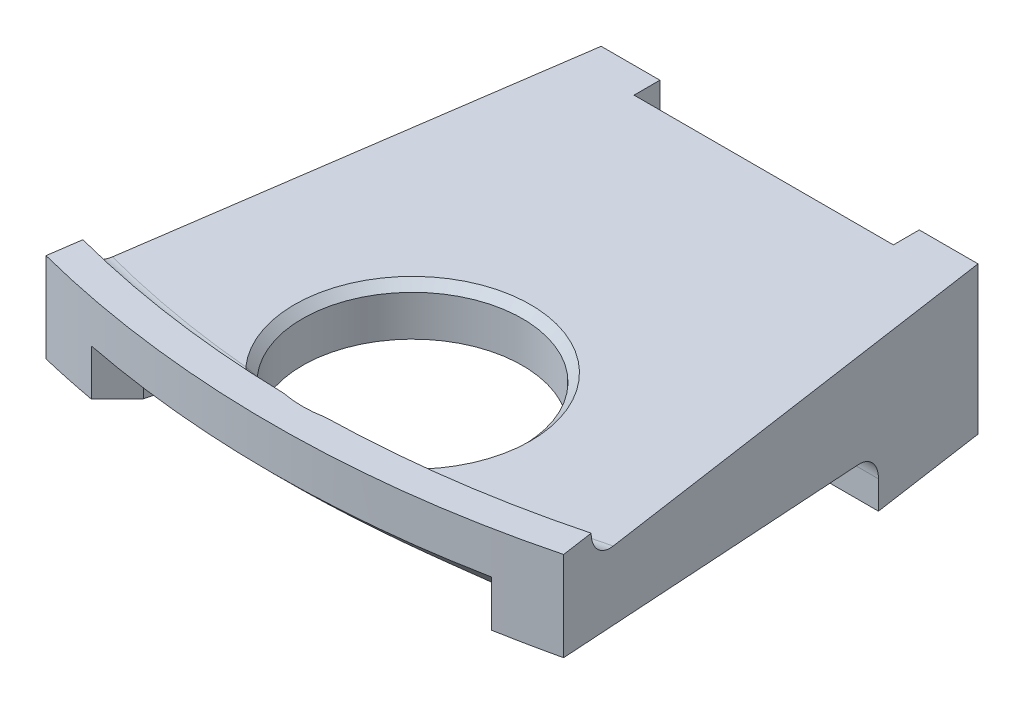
ISO-10303-21;
HEADER;
FILE_DESCRIPTION(('STEP AP214'),'2;1');
FILE_NAME('part.step','',(''),(''),'','','');
FILE_SCHEMA(('AUTOMOTIVE_DESIGN { 1 0 10303 214 1 1 1 1 }'));
ENDSEC;
DATA;
#1=APPLICATION_CONTEXT('core data for automotive mechanical design processes');
#2=APPLICATION_PROTOCOL_DEFINITION('international standard','automotive_design',2000,#1);
#3=PRODUCT_CONTEXT('',#1,'mechanical');
#4=PRODUCT('Part','Part','',(#3));
#5=PRODUCT_RELATED_PRODUCT_CATEGORY('part','',(#4));
#6=PRODUCT_DEFINITION_FORMATION('','',#4);
#7=PRODUCT_DEFINITION_CONTEXT('part definition',#1,'design');
#8=PRODUCT_DEFINITION('design','',#6,#7);
#9=PRODUCT_DEFINITION_SHAPE('','',#8);
#10=(LENGTH_UNIT() NAMED_UNIT(*) SI_UNIT(.MILLI.,.METRE.));
#11=(NAMED_UNIT(*) PLANE_ANGLE_UNIT() SI_UNIT($,.RADIAN.));
#12=(NAMED_UNIT(*) SI_UNIT($,.STERADIAN.) SOLID_ANGLE_UNIT());
#13=UNCERTAINTY_MEASURE_WITH_UNIT(LENGTH_MEASURE(1.E-05),#10,'distance_accuracy_value','');
#14=(GEOMETRIC_REPRESENTATION_CONTEXT(3) GLOBAL_UNCERTAINTY_ASSIGNED_CONTEXT((#13)) GLOBAL_UNIT_ASSIGNED_CONTEXT((#10,
#11,#12)) REPRESENTATION_CONTEXT('',''));
#15=CARTESIAN_POINT('',(0.,0.,0.));
#16=DIRECTION('',(0.,0.,1.));
#17=DIRECTION('',(1.,0.,0.));
#18=AXIS2_PLACEMENT_3D('',#15,#16,#17);
#19=CARTESIAN_POINT('',(0.,11.4981695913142,72.5911683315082));
#20=DIRECTION('',(0.,-1.,0.));
#21=DIRECTION('',(0.,0.,-1.));
#22=AXIS2_PLACEMENT_3D('',#19,#20,#21);
#23=CIRCLE('',#22,15.748);
#24=DIRECTION('',(0.,-0.0871557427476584,-0.996194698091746));
#25=VECTOR('',#24,1.);
#26=SURFACE_OF_LINEAR_EXTRUSION('',#23,#25);
#27=CARTESIAN_POINT('',(0.,9.7028,52.07));
#28=DIRECTION('',(0.,-1.,0.));
#29=DIRECTION('',(0.,0.,-1.));
#30=AXIS2_PLACEMENT_3D('',#27,#28,#29);
#31=CIRCLE('',#30,15.748);
#32=CARTESIAN_POINT('',(13.8304749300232,9.7028,44.5389));
#33=VERTEX_POINT('',#32);
#34=CARTESIAN_POINT('',(14.3560655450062,9.7028,45.5967561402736));
#35=VERTEX_POINT('',#34);
#36=EDGE_CURVE('E275',#33,#35,#31,.T.);
#37=ORIENTED_EDGE('',*,*,#36,.T.);
#38=CARTESIAN_POINT('',(-15.7478349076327,8.78092552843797,41.4608174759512));
#39=CARTESIAN_POINT('',(-15.8616419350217,6.77730499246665,43.4134401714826));
#40=CARTESIAN_POINT('',(-18.6335314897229,7.11763032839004,43.2109811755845));
#41=CARTESIAN_POINT('',(-15.7475753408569,8.79658175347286,41.5863442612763));
#42=CARTESIAN_POINT('',(-15.9409079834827,6.85242859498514,43.4734856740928));
#43=CARTESIAN_POINT('',(-18.6275537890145,7.23129301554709,43.328037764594));
#44=CARTESIAN_POINT('',(-15.7470731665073,8.81226919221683,41.7122299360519));
#45=CARTESIAN_POINT('',(-16.013666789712,6.93285205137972,43.5401192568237));
#46=CARTESIAN_POINT('',(-18.615571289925,7.34423448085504,43.4455402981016));
#47=CARTESIAN_POINT('',(-15.7454680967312,8.84382608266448,41.9640838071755));
#48=CARTESIAN_POINT('',(-16.1429894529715,7.09926198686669,43.6821215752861));
#49=CARTESIAN_POINT('',(-18.5796631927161,7.56816384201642,43.6808552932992));
#50=CARTESIAN_POINT('',(-15.7443648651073,8.85969563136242,42.0900520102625));
#51=CARTESIAN_POINT('',(-16.200112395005,7.18520141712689,43.7573343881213));
#52=CARTESIAN_POINT('',(-18.5557309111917,7.67915060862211,43.7986678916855));
#53=CARTESIAN_POINT('',(-15.7414173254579,8.89199167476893,42.3434324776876));
#54=CARTESIAN_POINT('',(-16.2994205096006,7.36176304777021,43.91536629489));
#55=CARTESIAN_POINT('',(-18.4954880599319,7.90039857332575,44.0358910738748));
#56=CARTESIAN_POINT('',(-15.7395607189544,8.90842305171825,42.4708328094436));
#57=CARTESIAN_POINT('',(-16.3418716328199,7.45251315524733,43.9982621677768));
#58=CARTESIAN_POINT('',(-18.4589736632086,8.01061523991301,44.1552947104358));
#59=CARTESIAN_POINT('',(-15.7348345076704,8.94174298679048,42.7240875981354));
#60=CARTESIAN_POINT('',(-16.4108909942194,7.63537511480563,44.1684832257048));
#61=CARTESIAN_POINT('',(-18.3734786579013,8.22765673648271,44.3929313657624));
#62=CARTESIAN_POINT('',(-15.7319651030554,8.95863145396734,42.8499423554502));
#63=CARTESIAN_POINT('',(-16.4379093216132,7.72758023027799,44.2558152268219));
#64=CARTESIAN_POINT('',(-18.3245005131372,8.33448223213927,44.5111646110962));
#65=CARTESIAN_POINT('',(-15.7252224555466,8.99071289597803,43.0818193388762));
#66=CARTESIAN_POINT('',(-16.4736027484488,7.89906235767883,44.4210000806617));
#67=CARTESIAN_POINT('',(-18.2214109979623,8.52933840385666,44.7292951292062));
#68=CARTESIAN_POINT('',(-15.7215445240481,9.00581467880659,43.1881637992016));
#69=CARTESIAN_POINT('',(-16.484526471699,7.97821391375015,44.4982998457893));
#70=CARTESIAN_POINT('',(-18.1689629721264,8.61791553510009,44.8294539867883));
#71=CARTESIAN_POINT('',(-15.7125149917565,9.03677706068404,43.3982658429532));
#72=CARTESIAN_POINT('',(-16.4946305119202,8.13514632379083,44.6537162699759));
#73=CARTESIAN_POINT('',(-18.0542046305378,8.7912837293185,45.027609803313));
#74=CARTESIAN_POINT('',(-15.7071637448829,9.05263749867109,43.5020239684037));
#75=CARTESIAN_POINT('',(-16.4940311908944,8.21304609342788,44.7319110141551));
#76=CARTESIAN_POINT('',(-17.991896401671,8.87607558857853,45.1256072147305));
#77=CARTESIAN_POINT('',(-15.69388641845,9.08534776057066,43.7052925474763));
#78=CARTESIAN_POINT('',(-16.4807534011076,8.3657851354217,44.8874357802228));
#79=CARTESIAN_POINT('',(-17.8575254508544,9.04046575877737,45.3179200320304));
#80=CARTESIAN_POINT('',(-15.6859802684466,9.10218912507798,43.8048293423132));
#81=CARTESIAN_POINT('',(-16.4683534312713,8.44077583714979,44.9648667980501));
#82=CARTESIAN_POINT('',(-17.7855406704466,9.12009871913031,45.4122578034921));
#83=CARTESIAN_POINT('',(-15.6659471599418,9.1374787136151,43.9994084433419));
#84=CARTESIAN_POINT('',(-16.4308736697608,8.58711305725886,45.1183275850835));
#85=CARTESIAN_POINT('',(-17.6311006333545,9.27394303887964,45.5970794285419));
#86=CARTESIAN_POINT('',(-15.6538202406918,9.15592692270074,44.094450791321));
#87=CARTESIAN_POINT('',(-16.4059476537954,8.65862681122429,45.1944977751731));
#88=CARTESIAN_POINT('',(-17.5486454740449,9.3481544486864,45.6875633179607));
#89=CARTESIAN_POINT('',(-15.6223934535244,9.19530781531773,44.2797379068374));
#90=CARTESIAN_POINT('',(-16.3419101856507,8.79741552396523,45.3450345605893));
#91=CARTESIAN_POINT('',(-17.3722282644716,9.4908596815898,45.8644784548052));
#92=CARTESIAN_POINT('',(-15.6030214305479,9.21626399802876,44.3699236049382));
#93=CARTESIAN_POINT('',(-16.3027680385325,8.86484419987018,45.4195609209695));
#94=CARTESIAN_POINT('',(-17.2781570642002,9.55928720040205,45.950858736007));
#95=CARTESIAN_POINT('',(-15.5525257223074,9.26121323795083,44.5431544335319));
#96=CARTESIAN_POINT('',(-16.2086240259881,8.99333044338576,45.5648653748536));
#97=CARTESIAN_POINT('',(-17.0795687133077,9.68860400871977,46.1174249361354));
#98=CARTESIAN_POINT('',(-15.5214057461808,9.28520533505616,44.6262018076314));
#99=CARTESIAN_POINT('',(-16.1536854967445,9.05459984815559,45.6358462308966));
#100=CARTESIAN_POINT('',(-16.9750548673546,9.74949566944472,46.197612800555));
#101=CARTESIAN_POINT('',(-15.4619766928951,9.32351251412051,44.7450112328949));
#102=CARTESIAN_POINT('',(-16.058152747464,9.14133203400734,45.7392280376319));
#103=CARTESIAN_POINT('',(-16.8111994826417,9.83499220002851,46.3128589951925));
#104=CARTESIAN_POINT('',(-15.4399866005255,9.33669614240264,44.7837241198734));
#105=CARTESIAN_POINT('',(-16.0241342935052,9.16938177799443,45.7731725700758));
#106=CARTESIAN_POINT('',(-16.7552839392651,9.86256570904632,46.3505037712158));
#107=CARTESIAN_POINT('',(-15.3913055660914,9.36369999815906,44.8591884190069));
#108=CARTESIAN_POINT('',(-15.9518068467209,9.22365967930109,45.8399004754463));
#109=CARTESIAN_POINT('',(-16.6413606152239,9.91576914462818,46.4240606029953));
#110=CARTESIAN_POINT('',(-15.3646149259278,9.37752018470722,44.8959399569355));
#111=CARTESIAN_POINT('',(-15.9134917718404,9.24990974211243,45.8727070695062));
#112=CARTESIAN_POINT('',(-16.5833529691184,9.94139919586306,46.4599727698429));
#113=CARTESIAN_POINT('',(-15.3063347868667,9.40562029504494,44.9675514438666));
#114=CARTESIAN_POINT('',(-15.8327172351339,9.30061762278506,45.9371450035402));
#115=CARTESIAN_POINT('',(-16.4654753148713,9.99080860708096,46.5301098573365));
#116=CARTESIAN_POINT('',(-15.2747435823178,9.41990037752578,45.0024107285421));
#117=CARTESIAN_POINT('',(-15.7902465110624,9.32509333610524,45.9687963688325));
#118=CARTESIAN_POINT('',(-16.405604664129,10.0145873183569,46.5643341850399));
#119=CARTESIAN_POINT('',(-15.206796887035,9.44869798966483,45.0703383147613));
#120=CARTESIAN_POINT('',(-15.701497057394,9.37232669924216,46.0309237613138));
#121=CARTESIAN_POINT('',(-16.2842759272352,10.0604164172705,46.6311651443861));
#122=CARTESIAN_POINT('',(-15.1704412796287,9.46321552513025,45.1034065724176));
#123=CARTESIAN_POINT('',(-15.6552065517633,9.39509916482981,46.061416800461));
#124=CARTESIAN_POINT('',(-16.2228178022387,10.082466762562,46.6637717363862));
#125=CARTESIAN_POINT('',(-15.0430776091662,9.51117152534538,45.2098937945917));
#126=CARTESIAN_POINT('',(-15.496952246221,9.46756712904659,46.1600985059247));
#127=CARTESIAN_POINT('',(-16.017648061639,10.1526919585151,46.768963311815));
#128=CARTESIAN_POINT('',(-14.9425461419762,9.5446330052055,45.2797874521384));
#129=CARTESIAN_POINT('',(-15.3774045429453,9.51401149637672,46.2260665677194));
#130=CARTESIAN_POINT('',(-15.8710340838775,10.1974980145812,46.8383209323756));
#131=CARTESIAN_POINT('',(-14.7244639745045,9.60980581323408,45.4127296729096));
#132=CARTESIAN_POINT('',(-15.126014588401,9.60017098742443,46.3526038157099));
#133=CARTESIAN_POINT('',(-15.5730201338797,10.2807420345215,46.9705910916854));
#134=CARTESIAN_POINT('',(-14.6069024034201,9.64151600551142,45.4757738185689));
#135=CARTESIAN_POINT('',(-14.9940474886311,9.63995151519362,46.4132597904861));
#136=CARTESIAN_POINT('',(-15.4216171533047,10.3191758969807,47.0334994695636));
#137=CARTESIAN_POINT('',(-14.3601829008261,9.70265641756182,45.5965897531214));
#138=CARTESIAN_POINT('',(-14.7217609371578,9.71445636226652,46.5301174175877));
#139=CARTESIAN_POINT('',(-15.1152443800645,10.3912738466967,47.1542543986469));
#140=CARTESIAN_POINT('',(-14.2310008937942,9.73208165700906,45.6543500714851));
#141=CARTESIAN_POINT('',(-14.5813448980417,9.7492045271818,46.5863576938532));
#142=CARTESIAN_POINT('',(-14.960267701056,10.4249276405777,47.2120899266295));
#143=CARTESIAN_POINT('',(-13.9649689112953,9.78856236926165,45.765463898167));
#144=CARTESIAN_POINT('',(-14.2950749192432,9.81469628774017,46.6949163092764));
#145=CARTESIAN_POINT('',(-14.6480232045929,10.4884493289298,47.3234672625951));
#146=CARTESIAN_POINT('',(-13.8281207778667,9.81561840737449,45.818818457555));
#147=CARTESIAN_POINT('',(-14.1491706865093,9.84545903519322,46.7472624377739));
#148=CARTESIAN_POINT('',(-14.4907559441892,10.5183181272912,47.3770100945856));
#149=CARTESIAN_POINT('',(-13.5476435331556,9.86782006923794,45.9223737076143));
#150=CARTESIAN_POINT('',(-13.8520237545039,9.90410375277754,46.8490906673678));
#151=CARTESIAN_POINT('',(-14.1728742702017,10.575327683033,47.4810056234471));
#152=CARTESIAN_POINT('',(-13.4039599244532,9.89294365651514,45.9725371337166));
#153=CARTESIAN_POINT('',(-13.7007055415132,9.93196428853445,46.898555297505));
#154=CARTESIAN_POINT('',(-14.0122420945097,10.6024378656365,47.5314216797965));
#155=CARTESIAN_POINT('',(-13.1126049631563,9.94120537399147,46.0696304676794));
#156=CARTESIAN_POINT('',(-13.3951793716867,9.98503647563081,46.9944492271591));
#157=CARTESIAN_POINT('',(-13.6895735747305,10.6541321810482,47.6290542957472));
#158=CARTESIAN_POINT('',(-12.9649333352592,9.96434336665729,46.1165601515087));
#159=CARTESIAN_POINT('',(-13.2409469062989,10.0102543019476,47.040888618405));
#160=CARTESIAN_POINT('',(-13.5275371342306,10.6787161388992,47.6762706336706));
#161=CARTESIAN_POINT('',(-12.5179295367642,10.0310482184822,46.2529472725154));
#162=CARTESIAN_POINT('',(-12.7755838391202,10.0825125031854,47.1759627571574));
#163=CARTESIAN_POINT('',(-13.0402193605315,10.7492347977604,47.8135414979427));
#164=CARTESIAN_POINT('',(-12.2141847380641,10.0719822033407,46.3381542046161));
#165=CARTESIAN_POINT('',(-12.4609923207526,10.1263037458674,47.2606141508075));
#166=CARTESIAN_POINT('',(-12.7132552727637,10.7920183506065,47.8993700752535));
#167=CARTESIAN_POINT('',(-11.6710943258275,10.1393106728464,46.4803975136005));
#168=CARTESIAN_POINT('',(-11.9002996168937,10.197884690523,47.4020950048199));
#169=CARTESIAN_POINT('',(-12.132742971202,10.8620285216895,48.0427115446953));
#170=CARTESIAN_POINT('',(-11.433223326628,10.1668712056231,46.5393733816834));
#171=CARTESIAN_POINT('',(-11.6553059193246,10.2270290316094,47.4608175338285));
#172=CARTESIAN_POINT('',(-11.8798287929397,10.8905578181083,48.1021640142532));
#173=CARTESIAN_POINT('',(-10.9542833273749,10.2190946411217,46.6523081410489));
#174=CARTESIAN_POINT('',(-11.1628685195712,10.2820566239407,47.5733418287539));
#175=CARTESIAN_POINT('',(-11.3725052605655,10.9444599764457,48.216039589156));
#176=CARTESIAN_POINT('',(-10.7132141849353,10.2437574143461,46.7062668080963));
#177=CARTESIAN_POINT('',(-10.9154010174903,10.3079438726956,47.6271511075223));
#178=CARTESIAN_POINT('',(-11.1180958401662,10.9698326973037,48.2704624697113));
#179=CARTESIAN_POINT('',(-9.98629153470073,10.3139393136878,46.8612541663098));
#180=CARTESIAN_POINT('',(-10.1702052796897,10.3814162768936,47.7817510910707));
#181=CARTESIAN_POINT('',(-10.3529357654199,11.0418947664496,48.4268112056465));
#182=CARTESIAN_POINT('',(-9.49681367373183,10.3556411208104,46.9553709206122));
#183=CARTESIAN_POINT('',(-9.66942530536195,10.4248410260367,47.8757732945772));
#184=CARTESIAN_POINT('',(-9.84034995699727,11.0845167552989,48.5217936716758));
#185=CARTESIAN_POINT('',(-8.51106445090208,10.430778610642,47.1273017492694));
#186=CARTESIAN_POINT('',(-8.66230209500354,10.5028734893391,48.0475991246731));
#187=CARTESIAN_POINT('',(-8.81101959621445,11.161160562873,48.6953418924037));
#188=CARTESIAN_POINT('',(-8.01478433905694,10.4642023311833,47.2050922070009));
#189=CARTESIAN_POINT('',(-8.15587299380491,10.5374787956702,48.1254005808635));
#190=CARTESIAN_POINT('',(-8.29427012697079,11.1951699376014,48.7738838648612));
#191=CARTESIAN_POINT('',(-7.01806726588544,10.5238364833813,47.3453554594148));
#192=CARTESIAN_POINT('',(-7.13963502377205,10.5991163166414,48.265718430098));
#193=CARTESIAN_POINT('',(-7.25827282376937,11.2557745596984,48.9155216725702));
#194=CARTESIAN_POINT('',(-6.51763078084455,10.5500477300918,47.4078299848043));
#195=CARTESIAN_POINT('',(-6.62977278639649,10.6261551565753,48.3282490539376));
#196=CARTESIAN_POINT('',(-6.73902527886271,11.2823706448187,48.9786192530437));
#197=CARTESIAN_POINT('',(-5.51696938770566,10.5958611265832,47.5178677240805));
#198=CARTESIAN_POINT('',(-5.61081582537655,10.6733646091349,48.4384009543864));
#199=CARTESIAN_POINT('',(-5.70190521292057,11.3288220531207,49.0897643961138));
#200=CARTESIAN_POINT('',(-5.01676275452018,10.6155036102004,47.5655218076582));
#201=CARTESIAN_POINT('',(-5.10169774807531,10.6935804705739,48.4861205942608));
#202=CARTESIAN_POINT('',(-5.18404442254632,11.3487185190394,49.1379036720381));
#203=CARTESIAN_POINT('',(-4.01437425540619,10.6488686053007,47.6469001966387));
#204=CARTESIAN_POINT('',(-4.08180758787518,10.7278960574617,48.5676173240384));
#205=CARTESIAN_POINT('',(-4.1470097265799,11.3824993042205,49.2201154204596));
#206=CARTESIAN_POINT('',(-3.51219232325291,10.6625909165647,47.6806240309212));
#207=CARTESIAN_POINT('',(-3.57100373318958,10.7419976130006,48.6013986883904));
#208=CARTESIAN_POINT('',(-3.6278357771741,11.3963834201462,49.254187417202));
#209=CARTESIAN_POINT('',(-2.00458219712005,10.6953452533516,47.7613210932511));
#210=CARTESIAN_POINT('',(-2.03791526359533,10.7756440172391,48.6822282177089));
#211=CARTESIAN_POINT('',(-2.06985810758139,11.4295174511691,49.3357197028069));
#212=CARTESIAN_POINT('',(-0.997202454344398,10.7060038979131,47.7879159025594));
#213=CARTESIAN_POINT('',(-1.01373726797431,10.786580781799,48.708881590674));
#214=CARTESIAN_POINT('',(-1.02968018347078,11.4402887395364,49.3625932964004));
#215=CARTESIAN_POINT('',(0.675741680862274,10.7058661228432,47.7876039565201));
#216=CARTESIAN_POINT('',(0.686946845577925,10.7864384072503,48.7085709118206));
#217=CARTESIAN_POINT('',(0.697749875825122,11.4401484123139,49.3622784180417));
#218=CARTESIAN_POINT('',(1.34138629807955,10.701119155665,47.7757806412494));
#219=CARTESIAN_POINT('',(1.3636574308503,10.7815670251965,48.6967231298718));
#220=CARTESIAN_POINT('',(1.38507862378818,11.4353505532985,49.3503313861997));
#221=CARTESIAN_POINT('',(2.6714153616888,10.6820444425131,47.7285495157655));
#222=CARTESIAN_POINT('',(2.71595266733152,10.7619822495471,48.6494055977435));
#223=CARTESIAN_POINT('',(2.7589106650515,11.4160625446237,49.3026089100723));
#224=CARTESIAN_POINT('',(3.33579959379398,10.6677151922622,47.6931380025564));
#225=CARTESIAN_POINT('',(3.39159602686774,10.7472656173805,48.613928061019));
#226=CARTESIAN_POINT('',(3.44541381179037,11.4015708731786,49.2668297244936));
#227=CARTESIAN_POINT('',(4.66298665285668,10.6289218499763,47.5981356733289));
#228=CARTESIAN_POINT('',(4.7416836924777,10.7073862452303,48.5187778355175));
#229=CARTESIAN_POINT('',(4.81785352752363,11.362308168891,49.1708502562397));
#230=CARTESIAN_POINT('',(5.32578324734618,10.6044365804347,47.538494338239));
#231=CARTESIAN_POINT('',(5.41619095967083,10.6821977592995,48.459045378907));
#232=CARTESIAN_POINT('',(5.50378589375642,11.3375156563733,49.1105989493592));
#233=CARTESIAN_POINT('',(6.64618595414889,10.5443320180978,47.3940732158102));
#234=CARTESIAN_POINT('',(6.76070694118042,10.620264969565,48.3144725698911));
#235=CARTESIAN_POINT('',(6.87223294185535,11.2765765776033,48.9647236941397));
#236=CARTESIAN_POINT('',(7.30379359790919,10.5087161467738,47.3093011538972));
#237=CARTESIAN_POINT('',(7.43080658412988,10.5835165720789,48.2296226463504));
#238=CARTESIAN_POINT('',(7.55474860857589,11.2404335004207,48.8791075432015));
#239=CARTESIAN_POINT('',(8.50263460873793,10.4315420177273,47.1291185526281));
#240=CARTESIAN_POINT('',(8.65369636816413,10.5036604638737,48.0494204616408));
#241=CARTESIAN_POINT('',(8.80223922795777,11.1619338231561,48.6971769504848));
#242=CARTESIAN_POINT('',(9.04508864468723,10.3919475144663,47.037801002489));
#243=CARTESIAN_POINT('',(9.20764376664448,10.4626044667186,47.9581141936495));
#244=CARTESIAN_POINT('',(9.36794375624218,11.1216004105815,48.6049886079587));
#245=CARTESIAN_POINT('',(9.85239870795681,10.3244343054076,46.8853117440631));
#246=CARTESIAN_POINT('',(10.0332946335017,10.3923087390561,47.8058292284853));
#247=CARTESIAN_POINT('',(10.2131607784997,11.0525831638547,48.4510972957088));
#248=CARTESIAN_POINT('',(10.1205589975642,10.3005638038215,46.8318690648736));
#249=CARTESIAN_POINT('',(10.3078389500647,10.3674033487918,47.7524682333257));
#250=CARTESIAN_POINT('',(10.4944684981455,11.0281450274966,48.3971710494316));
#251=CARTESIAN_POINT('',(10.6540130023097,10.2497727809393,46.7194403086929));
#252=CARTESIAN_POINT('',(10.8546464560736,10.3142558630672,47.6402859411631));
#253=CARTESIAN_POINT('',(11.0556339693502,10.976020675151,48.2837494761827));
#254=CARTESIAN_POINT('',(10.9193068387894,10.2228523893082,46.6604544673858));
#255=CARTESIAN_POINT('',(11.1269315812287,10.286010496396,47.5814582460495));
#256=CARTESIAN_POINT('',(11.3354917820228,10.9483345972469,48.2242543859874));
#257=CARTESIAN_POINT('',(11.4459496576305,10.1655372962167,46.5364694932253));
#258=CARTESIAN_POINT('',(11.6683874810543,10.225626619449,47.457919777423));
#259=CARTESIAN_POINT('',(11.893274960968,10.8891847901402,48.0992353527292));
#260=CARTESIAN_POINT('',(11.7073007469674,10.1351445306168,46.4714737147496));
#261=CARTESIAN_POINT('',(11.9375907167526,10.1934848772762,47.3932022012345));
#262=CARTESIAN_POINT('',(12.1712013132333,10.85772316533,48.0337147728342));
#263=CARTESIAN_POINT('',(12.2247252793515,10.0702686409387,46.3346873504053));
#264=CARTESIAN_POINT('',(12.4719714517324,10.1244457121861,47.2571912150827));
#265=CARTESIAN_POINT('',(12.7248315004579,10.7902019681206,47.8958816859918));
#266=CARTESIAN_POINT('',(12.4807977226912,10.0357847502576,46.262895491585));
#267=CARTESIAN_POINT('',(12.7371948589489,10.0875381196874,47.1858800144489));
#268=CARTESIAN_POINT('',(13.0005349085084,10.7541415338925,47.8235679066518));
#269=CARTESIAN_POINT('',(12.9847127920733,9.96196632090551,46.1115130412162));
#270=CARTESIAN_POINT('',(13.2613791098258,10.0077507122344,47.0358350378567));
#271=CARTESIAN_POINT('',(13.548530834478,10.6762756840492,47.6711809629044));
#272=CARTESIAN_POINT('',(13.2325666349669,9.92263877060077,46.0319337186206));
#273=CARTESIAN_POINT('',(13.5204231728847,9.96486216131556,46.9570826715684));
#274=CARTESIAN_POINT('',(13.8208276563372,10.6344785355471,47.5911190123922));
#275=CARTESIAN_POINT('',(13.5945309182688,9.85920804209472,45.905255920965));
#276=CARTESIAN_POINT('',(13.9016207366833,9.89444806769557,46.8322626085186));
#277=CARTESIAN_POINT('',(14.2258938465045,10.5659339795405,47.4638133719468));
#278=CARTESIAN_POINT('',(13.7135318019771,9.83732832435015,45.861819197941));
#279=CARTESIAN_POINT('',(14.0275272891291,9.86994893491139,46.7895162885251));
#280=CARTESIAN_POINT('',(14.3603320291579,10.5421151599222,47.4201834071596));
#281=CARTESIAN_POINT('',(13.9471402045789,9.79195106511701,45.7721376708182));
#282=CARTESIAN_POINT('',(14.2761463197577,9.81849476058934,46.7014970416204));
#283=CARTESIAN_POINT('',(14.6278087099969,10.492133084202,47.3301705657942));
#284=CARTESIAN_POINT('',(14.0617481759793,9.76845369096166,45.7258931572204));
#285=CARTESIAN_POINT('',(14.3988833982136,9.79153234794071,46.6562127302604));
#286=CARTESIAN_POINT('',(14.7608473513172,10.4659700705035,47.2837879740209));
#287=CARTESIAN_POINT('',(14.2377766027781,9.73004475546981,45.6503597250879));
#288=CARTESIAN_POINT('',(14.5889951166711,9.74665619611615,46.5825516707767));
#289=CARTESIAN_POINT('',(14.9692613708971,10.422452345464,47.2081100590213));
#290=CARTESIAN_POINT('',(14.3011993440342,9.71570300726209,45.622167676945));
#291=CARTESIAN_POINT('',(14.6578734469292,9.72972652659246,46.5551057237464));
#292=CARTESIAN_POINT('',(15.0452372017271,10.4060497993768,47.1798806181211));
#293=CARTESIAN_POINT('',(14.4256008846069,9.68645314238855,45.5645630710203));
#294=CARTESIAN_POINT('',(14.7938631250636,9.69473315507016,46.4991819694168));
#295=CARTESIAN_POINT('',(15.1964794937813,10.3721622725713,47.122244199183));
#296=CARTESIAN_POINT('',(14.486579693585,9.67154502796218,45.5351505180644));
#297=CARTESIAN_POINT('',(14.8609828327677,9.67666609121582,46.4706993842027));
#298=CARTESIAN_POINT('',(15.271745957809,10.354677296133,47.092837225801));
#299=CARTESIAN_POINT('',(14.6651398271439,9.62598393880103,45.4448647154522));
#300=CARTESIAN_POINT('',(15.0592802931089,9.62050513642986,46.3835223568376));
#301=CARTESIAN_POINT('',(15.4963297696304,10.3003761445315,47.0026536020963));
#302=CARTESIAN_POINT('',(14.7783219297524,9.59449915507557,45.3819529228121));
#303=CARTESIAN_POINT('',(15.1872473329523,9.58048133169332,46.3231507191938));
#304=CARTESIAN_POINT('',(15.6444047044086,10.2617192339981,46.9399238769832));
#305=CARTESIAN_POINT('',(14.9867246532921,9.53018659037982,45.2496081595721));
#306=CARTESIAN_POINT('',(15.4296669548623,9.4940410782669,46.197586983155));
#307=CARTESIAN_POINT('',(15.9348798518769,10.1782058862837,46.8083674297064));
#308=CARTESIAN_POINT('',(15.0820459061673,9.49736768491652,45.1802152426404));
#309=CARTESIAN_POINT('',(15.5443106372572,9.44758985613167,46.1323310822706));
#310=CARTESIAN_POINT('',(16.0773080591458,10.1333868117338,46.7395782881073));
#311=CARTESIAN_POINT('',(15.2076880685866,9.44842344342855,45.069733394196));
#312=CARTESIAN_POINT('',(15.7025439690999,9.37192794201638,46.0303561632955));
#313=CARTESIAN_POINT('',(16.2855448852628,10.0600284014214,46.6305662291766));
#314=CARTESIAN_POINT('',(15.2466741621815,9.43215853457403,45.0318470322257));
#315=CARTESIAN_POINT('',(15.753108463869,9.34564572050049,45.9956001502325));
#316=CARTESIAN_POINT('',(16.3540461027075,10.0345583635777,46.5932636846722));
#317=CARTESIAN_POINT('',(15.3185139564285,9.40004736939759,44.9537487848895));
#318=CARTESIAN_POINT('',(15.8491983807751,9.29090568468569,45.9246462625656));
#319=CARTESIAN_POINT('',(16.4888998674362,9.98136201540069,46.5165692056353));
#320=CARTESIAN_POINT('',(15.351368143,9.38420107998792,44.9135370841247));
#321=CARTESIAN_POINT('',(15.8947399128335,9.26242477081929,45.8884222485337));
#322=CARTESIAN_POINT('',(16.5552525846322,9.95363588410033,46.47717743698));
#323=CARTESIAN_POINT('',(15.4291324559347,9.34376560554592,44.8053006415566));
#324=CARTESIAN_POINT('',(16.0067123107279,9.18501227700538,45.7918447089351));
#325=CARTESIAN_POINT('',(16.7252478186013,9.87805828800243,46.3714468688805));
#326=CARTESIAN_POINT('',(15.4691403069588,9.31975151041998,44.7352965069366));
#327=CARTESIAN_POINT('',(16.068744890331,9.13425315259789,45.7303326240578));
#328=CARTESIAN_POINT('',(16.8268984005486,9.82826260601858,46.3033516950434));
#329=CARTESIAN_POINT('',(15.5357934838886,9.27432123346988,44.5888596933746));
#330=CARTESIAN_POINT('',(16.1787079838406,9.02714727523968,45.6039768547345));
#331=CARTESIAN_POINT('',(17.0223159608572,9.72214300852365,46.1615449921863));
#332=CARTESIAN_POINT('',(15.5624394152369,9.25290493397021,44.5124273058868));
#333=CARTESIAN_POINT('',(16.2266410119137,8.97064985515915,45.5389804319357));
#334=CARTESIAN_POINT('',(17.1160832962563,9.66581938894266,46.0878337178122));
#335=CARTESIAN_POINT('',(15.6064650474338,9.21249560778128,44.3536371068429));
#336=CARTESIAN_POINT('',(16.3097258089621,8.85273249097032,45.4061867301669));
#337=CARTESIAN_POINT('',(17.2950817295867,9.5469222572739,45.935261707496));
#338=CARTESIAN_POINT('',(15.6238295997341,9.19350658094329,44.2712698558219));
#339=CARTESIAN_POINT('',(16.3448076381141,8.79114753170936,45.3382350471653));
#340=CARTESIAN_POINT('',(17.3802986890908,9.48433872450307,45.856392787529));
#341=CARTESIAN_POINT('',(15.6525969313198,9.15746147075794,44.1016640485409));
#342=CARTESIAN_POINT('',(16.4034180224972,8.66409746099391,45.2004324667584));
#343=CARTESIAN_POINT('',(17.5417697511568,9.3537089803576,45.6944508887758));
#344=CARTESIAN_POINT('',(15.663998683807,9.14040572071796,44.0144246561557));
#345=CARTESIAN_POINT('',(16.4268562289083,8.59848323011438,45.1304473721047));
#346=CARTESIAN_POINT('',(17.6180223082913,9.28566183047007,45.6113771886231));
#347=CARTESIAN_POINT('',(15.6829930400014,9.10783605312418,43.8368240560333));
#348=CARTESIAN_POINT('',(16.4630193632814,8.4649419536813,44.9900575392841));
#349=CARTESIAN_POINT('',(17.7610321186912,9.14551288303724,45.4426216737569));
#350=CARTESIAN_POINT('',(15.6906176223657,9.09231011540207,43.7464962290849));
#351=CARTESIAN_POINT('',(16.4757219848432,8.39690299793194,44.9195444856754));
#352=CARTESIAN_POINT('',(17.8278655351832,9.07345107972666,45.3569685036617));
#353=CARTESIAN_POINT('',(15.7035202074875,9.06223359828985,43.5628324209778));
#354=CARTESIAN_POINT('',(16.4913965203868,8.25883520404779,44.7782903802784));
#355=CARTESIAN_POINT('',(17.9530793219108,8.92544570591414,45.1831008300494));
#356=CARTESIAN_POINT('',(15.7087971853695,9.0476834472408,43.4694951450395));
#357=CARTESIAN_POINT('',(16.4942273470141,8.18869524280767,44.7074635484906));
#358=CARTESIAN_POINT('',(18.0114559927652,8.84950045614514,45.0948852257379));
#359=CARTESIAN_POINT('',(15.7223852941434,9.00499857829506,43.1857244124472));
#360=CARTESIAN_POINT('',(16.4886363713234,7.97456233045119,44.4938769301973));
#361=CARTESIAN_POINT('',(18.1745261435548,8.61651695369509,44.8270470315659));
#362=CARTESIAN_POINT('',(15.7284343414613,8.97786920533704,42.991761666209));
#363=CARTESIAN_POINT('',(16.4652059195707,7.82993102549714,44.3532645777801));
#364=CARTESIAN_POINT('',(18.26697931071,8.45451243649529,44.6444509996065));
#365=CARTESIAN_POINT('',(15.7358191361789,8.93543829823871,42.6767033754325));
#366=CARTESIAN_POINT('',(16.3993602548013,7.60115136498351,44.136359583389));
#367=CARTESIAN_POINT('',(18.3906011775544,8.18722300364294,44.3484443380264));
#368=CARTESIAN_POINT('',(15.7380728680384,8.91969244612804,42.5570449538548));
#369=CARTESIAN_POINT('',(16.3673264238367,7.51447683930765,44.0555425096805));
#370=CARTESIAN_POINT('',(18.4315585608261,8.08477213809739,44.2361545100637));
#371=CARTESIAN_POINT('',(15.7417819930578,8.88854077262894,42.3166270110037));
#372=CARTESIAN_POINT('',(16.2897646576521,7.34314131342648,43.8985415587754));
#373=CARTESIAN_POINT('',(18.5024429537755,7.87708372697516,44.0107820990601));
#374=CARTESIAN_POINT('',(15.7432372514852,8.87313500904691,42.1958673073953));
#375=CARTESIAN_POINT('',(16.2438328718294,7.25842092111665,43.8223762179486));
#376=CARTESIAN_POINT('',(18.5323681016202,7.77184571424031,43.8976993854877));
#377=CARTESIAN_POINT('',(15.745536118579,8.84265100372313,41.9548091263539));
#378=CARTESIAN_POINT('',(16.1385613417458,7.09330745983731,43.6770009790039));
#379=CARTESIAN_POINT('',(18.5810869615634,7.55993144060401,43.6721870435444));
#380=CARTESIAN_POINT('',(15.7463839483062,8.82757122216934,41.8345133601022));
#381=CARTESIAN_POINT('',(16.0788549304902,7.01287052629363,43.607818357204));
#382=CARTESIAN_POINT('',(18.5999573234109,7.45327045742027,43.5597584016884));
#383=CARTESIAN_POINT('',(15.7475554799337,8.79754469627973,41.5941892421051));
#384=CARTESIAN_POINT('',(15.9455572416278,6.85770714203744,43.4778850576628));
#385=CARTESIAN_POINT('',(18.6267592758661,7.23831848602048,43.3353604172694));
#386=CARTESIAN_POINT('',(15.7478793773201,8.78259790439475,41.4741608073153));
#387=CARTESIAN_POINT('',(15.8714542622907,6.78305179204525,43.417305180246));
#388=CARTESIAN_POINT('',(18.6346949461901,7.13002812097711,43.223390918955));
#389=CARTESIAN_POINT('',(15.7479770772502,8.76767000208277,41.3545456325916));
#390=CARTESIAN_POINT('',(15.7914626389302,6.71362368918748,43.3631157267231));
#391=CARTESIAN_POINT('',(18.6371042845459,7.02114496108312,43.1119079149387));
#392=(BOUNDED_SURFACE() B_SPLINE_SURFACE(3,2,((#38,#39,#40),(#41,#42,#43),(#44,#45,#46),(#47,
#48,#49),(#50,#51,#52),(#53,#54,#55),(#56,#57,#58),(#59,#60,#61),(#62,#63,#64),(#65,#66,#67),
(#68,#69,#70),(#71,#72,#73),(#74,#75,#76),(#77,#78,#79),(#80,#81,#82),(#83,#84,#85),(#86,#87,
#88),(#89,#90,#91),(#92,#93,#94),(#95,#96,#97),(#98,#99,#100),(#101,#102,#103),(#104,#105,#106),
(#107,#108,#109),(#110,#111,#112),(#113,#114,#115),(#116,#117,#118),(#119,#120,#121),(#122,#123,
#124),(#125,#126,#127),(#128,#129,#130),(#131,#132,#133),(#134,#135,#136),(#137,#138,#139),
(#140,#141,#142),(#143,#144,#145),(#146,#147,#148),(#149,#150,#151),(#152,#153,#154),(#155,#156,
#157),(#158,#159,#160),(#161,#162,#163),(#164,#165,#166),(#167,#168,#169),(#170,#171,#172),
(#173,#174,#175),(#176,#177,#178),(#179,#180,#181),(#182,#183,#184),(#185,#186,#187),(#188,#189,
#190),(#191,#192,#193),(#194,#195,#196),(#197,#198,#199),(#200,#201,#202),(#203,#204,#205),
(#206,#207,#208),(#209,#210,#211),(#212,#213,#214),(#215,#216,#217),(#218,#219,#220),(#221,#222,
#223),(#224,#225,#226),(#227,#228,#229),(#230,#231,#232),(#233,#234,#235),(#236,#237,#238),
(#239,#240,#241),(#242,#243,#244),(#245,#246,#247),(#248,#249,#250),(#251,#252,#253),(#254,#255,
#256),(#257,#258,#259),(#260,#261,#262),(#263,#264,#265),(#266,#267,#268),(#269,#270,#271),
(#272,#273,#274),(#275,#276,#277),(#278,#279,#280),(#281,#282,#283),(#284,#285,#286),(#287,#288,
#289),(#290,#291,#292),(#293,#294,#295),(#296,#297,#298),(#299,#300,#301),(#302,#303,#304),
(#305,#306,#307),(#308,#309,#310),(#311,#312,#313),(#314,#315,#316),(#317,#318,#319),(#320,#321,
#322),(#323,#324,#325),(#326,#327,#328),(#329,#330,#331),(#332,#333,#334),(#335,#336,#337),
(#338,#339,#340),(#341,#342,#343),(#344,#345,#346),(#347,#348,#349),(#350,#351,#352),(#353,#354,
#355),(#356,#357,#358),(#359,#360,#361),(#362,#363,#364),(#365,#366,#367),(#368,#369,#370),
(#371,#372,#373),(#374,#375,#376),(#377,#378,#379),(#380,#381,#382),(#383,#384,#385),(#386,#387,
#388),(#389,#390,#391)),.UNSPECIFIED.,.F.,.F.,.F.) B_SPLINE_SURFACE_WITH_KNOTS((4,2,2,2,2,2,2,2,
2,2,2,2,2,2,2,2,2,2,2,2,2,2,2,2,2,2,2,2,2,2,2,2,2,2,2,2,2,2,2,2,2,2,2,2,2,2,2,2,2,2,2,2,2,2,2,2,
2,2,4),(3,3),(0.,0.489421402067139,0.979116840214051,1.47715033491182,1.97508545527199,
2.40371417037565,2.83225228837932,3.25752516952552,3.68279409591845,4.11241628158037,
4.54190293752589,4.75749100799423,4.97306523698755,5.18871466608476,5.40436937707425,
5.90082765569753,6.39760424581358,6.89543487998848,7.39314640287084,7.89588102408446,
8.39865043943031,9.40270210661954,10.1729448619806,10.9432220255,12.4840711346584,
14.0271340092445,15.5700224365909,17.1032553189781,18.6365400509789,21.7003900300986,
23.725360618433,25.7506491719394,27.7801822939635,29.8090921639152,31.5016728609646,
32.3487228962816,33.1957369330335,34.0422810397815,34.8889840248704,35.7344794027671,
36.1570952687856,36.5796674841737,36.8235945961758,37.0675207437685,37.555458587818,
38.0405586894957,38.2830339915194,38.5254900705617,38.9161152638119,39.3067227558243,
39.6979658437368,40.0892762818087,40.4772145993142,40.865322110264,41.6425293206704,
42.1131596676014,42.5838694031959,43.051275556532,43.5185072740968),(0.,1.),
.UNSPECIFIED.) GEOMETRIC_REPRESENTATION_ITEM() RATIONAL_B_SPLINE_SURFACE(((1.,0.671878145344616,
1.),(1.,0.683082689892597,1.),(1.,0.694052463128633,1.),(1.,0.715511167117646,1.),(1.,
0.725999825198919,1.),(1.,0.746646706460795,1.),(1.,0.756796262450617,1.),(1.,0.776540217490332,
1.),(1.,0.786134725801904,1.),(1.,0.803423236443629,1.),(1.,0.811195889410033,1.),(1.,
0.826237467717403,1.),(1.,0.833506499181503,1.),(1.,0.847410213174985,1.),(1.,0.85404930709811,
1.),(1.,0.866643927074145,1.),(1.,0.872599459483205,1.),(1.,0.883736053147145,1.),(1.,
0.888908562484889,1.),(1.,0.898237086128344,1.),(1.,0.902393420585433,1.),(1.,0.907815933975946,
1.),(1.,0.909490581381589,1.),(1.,0.912576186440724,1.),(1.,0.913987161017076,1.),(1.,
0.916566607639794,1.),(1.,0.917734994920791,1.),(1.,0.91985948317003,1.),(1.,0.920815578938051,
1.),(1.,0.9236820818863,1.),(1.,0.925214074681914,1.),(1.,0.927725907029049,1.),(1.,
0.928705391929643,1.),(1.,0.930348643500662,1.),(1.,0.931011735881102,1.),(1.,0.932147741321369,
1.),(1.,0.93262069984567,1.),(1.,0.933451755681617,1.),(1.,0.933808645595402,1.),(1.,
0.934442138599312,1.),(1.,0.934718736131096,1.),(1.,0.935466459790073,1.),(1.,0.935856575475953,
1.),(1.,0.936444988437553,1.),(1.,0.936666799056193,1.),(1.,0.937063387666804,1.),(1.,
0.937238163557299,1.),(1.,0.937713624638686,1.),(1.,0.937965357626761,1.),(1.,0.938394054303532,
1.),(1.,0.938570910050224,1.),(1.,0.938873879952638,1.),(1.,0.938999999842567,1.),(1.,
0.939214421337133,1.),(1.,0.939302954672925,1.),(1.,0.939450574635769,1.),(1.,0.939509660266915,
1.),(1.,0.939649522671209,1.),(1.,0.939693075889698,1.),(1.,0.939692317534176,1.),(1.,
0.939672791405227,1.),(1.,0.939592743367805,1.),(1.,0.939532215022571,1.),(1.,0.939363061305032,
1.),(1.,0.939254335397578,1.),(1.,0.938973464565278,1.),(1.,0.938801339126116,1.),(1.,
0.938397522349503,1.),(1.,0.938180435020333,1.),(1.,0.937771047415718,1.),(1.,0.937620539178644,
1.),(1.,0.93728069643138,1.),(1.,0.937091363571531,1.),(1.,0.936657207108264,1.),(1.,
0.936412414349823,1.),(1.,0.93583665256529,1.),(1.,0.935505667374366,1.),(1.,0.934702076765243,
1.),(1.,0.934229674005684,1.),(1.,0.933316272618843,1.),(1.,0.932977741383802,1.),(1.,
0.932199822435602,1.),(1.,0.931760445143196,1.),(1.,0.930947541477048,1.),(1.,0.930624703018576,
1.),(1.,0.929912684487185,1.),(1.,0.929523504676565,1.),(1.,0.92822919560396,1.),(1.,
0.927197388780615,1.),(1.,0.924559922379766,1.),(1.,0.922957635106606,1.),(1.,0.919845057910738,
1.),(1.,0.918689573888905,1.),(1.,0.916093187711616,1.),(1.,0.914652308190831,1.),(1.,
0.910463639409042,1.),(1.,0.907455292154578,1.),(1.,0.900536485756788,1.),(1.,0.896626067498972,
1.),(1.,0.88797212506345,1.),(1.,0.883227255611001,1.),(1.,0.873032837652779,1.),(1.,
0.867583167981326,1.),(1.,0.85614523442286,1.),(1.,0.850162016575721,1.),(1.,0.837703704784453,
1.),(1.,0.831228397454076,1.),(1.,0.8111407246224,1.),(1.,0.796881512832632,1.),(1.,
0.772880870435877,1.),(1.,0.763576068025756,1.),(1.,0.744481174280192,1.),(1.,0.734691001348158,
1.),(1.,0.714722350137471,1.),(1.,0.70454707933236,1.),(1.,0.683761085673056,1.),(1.,
0.673150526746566,1.),(1.,0.662326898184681,1.))) REPRESENTATION_ITEM('') SURFACE());
#393=CARTESIAN_POINT('',(15.7479770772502,8.76767000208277,41.3545456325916));
#394=CARTESIAN_POINT('',(15.7478793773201,8.78259790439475,41.4741608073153));
#395=CARTESIAN_POINT('',(15.7475554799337,8.79754469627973,41.5941892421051));
#396=CARTESIAN_POINT('',(15.7463839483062,8.82757122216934,41.8345133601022));
#397=CARTESIAN_POINT('',(15.745536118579,8.84265100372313,41.9548091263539));
#398=CARTESIAN_POINT('',(15.7432372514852,8.87313500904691,42.1958673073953));
#399=CARTESIAN_POINT('',(15.7417819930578,8.88854077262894,42.3166270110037));
#400=CARTESIAN_POINT('',(15.7380728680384,8.91969244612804,42.5570449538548));
#401=CARTESIAN_POINT('',(15.7358191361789,8.93543829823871,42.6767033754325));
#402=CARTESIAN_POINT('',(15.7284343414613,8.97786920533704,42.991761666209));
#403=CARTESIAN_POINT('',(15.7223852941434,9.00499857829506,43.1857244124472));
#404=CARTESIAN_POINT('',(15.7087971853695,9.0476834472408,43.4694951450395));
#405=CARTESIAN_POINT('',(15.7035202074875,9.06223359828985,43.5628324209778));
#406=CARTESIAN_POINT('',(15.6906176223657,9.09231011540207,43.7464962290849));
#407=CARTESIAN_POINT('',(15.6829930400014,9.10783605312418,43.8368240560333));
#408=CARTESIAN_POINT('',(15.663998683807,9.14040572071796,44.0144246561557));
#409=CARTESIAN_POINT('',(15.6525969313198,9.15746147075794,44.1016640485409));
#410=CARTESIAN_POINT('',(15.6238295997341,9.19350658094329,44.2712698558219));
#411=CARTESIAN_POINT('',(15.6064650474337,9.21249560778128,44.3536371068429));
#412=CARTESIAN_POINT('',(15.5624394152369,9.25290493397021,44.5124273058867));
#413=CARTESIAN_POINT('',(15.5357934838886,9.27432123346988,44.5888596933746));
#414=CARTESIAN_POINT('',(15.4691403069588,9.31975151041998,44.7352965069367));
#415=CARTESIAN_POINT('',(15.4291324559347,9.34376560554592,44.8053006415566));
#416=CARTESIAN_POINT('',(15.351368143,9.38420107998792,44.9135370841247));
#417=CARTESIAN_POINT('',(15.3185139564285,9.40004736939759,44.9537487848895));
#418=CARTESIAN_POINT('',(15.2466741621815,9.43215853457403,45.0318470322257));
#419=CARTESIAN_POINT('',(15.2076880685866,9.44842344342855,45.069733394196));
#420=CARTESIAN_POINT('',(15.0820459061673,9.49736768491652,45.1802152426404));
#421=CARTESIAN_POINT('',(14.9867246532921,9.53018659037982,45.2496081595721));
#422=CARTESIAN_POINT('',(14.7783219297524,9.59449915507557,45.3819529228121));
#423=CARTESIAN_POINT('',(14.6651398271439,9.62598393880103,45.4448647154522));
#424=CARTESIAN_POINT('',(14.486579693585,9.67154502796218,45.5351505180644));
#425=CARTESIAN_POINT('',(14.4256008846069,9.68645314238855,45.5645630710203));
#426=CARTESIAN_POINT('',(14.3011993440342,9.71570300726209,45.622167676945));
#427=CARTESIAN_POINT('',(14.2377766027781,9.73004475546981,45.6503597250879));
#428=CARTESIAN_POINT('',(14.0617481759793,9.76845369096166,45.7258931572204));
#429=CARTESIAN_POINT('',(13.9471402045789,9.79195106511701,45.7721376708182));
#430=CARTESIAN_POINT('',(13.7135318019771,9.83732832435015,45.861819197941));
#431=CARTESIAN_POINT('',(13.5945309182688,9.85920804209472,45.905255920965));
#432=CARTESIAN_POINT('',(13.2325666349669,9.92263877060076,46.0319337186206));
#433=CARTESIAN_POINT('',(12.9847127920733,9.96196632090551,46.1115130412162));
#434=CARTESIAN_POINT('',(12.4807977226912,10.0357847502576,46.262895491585));
#435=CARTESIAN_POINT('',(12.2247252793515,10.0702686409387,46.3346873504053));
#436=CARTESIAN_POINT('',(11.7073007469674,10.1351445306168,46.4714737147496));
#437=CARTESIAN_POINT('',(11.4459496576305,10.1655372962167,46.5364694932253));
#438=CARTESIAN_POINT('',(10.9193068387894,10.2228523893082,46.6604544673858));
#439=CARTESIAN_POINT('',(10.6540130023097,10.2497727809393,46.7194403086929));
#440=CARTESIAN_POINT('',(10.1205589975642,10.3005638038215,46.8318690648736));
#441=CARTESIAN_POINT('',(9.85239870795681,10.3244343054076,46.8853117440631));
#442=CARTESIAN_POINT('',(9.04508864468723,10.3919475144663,47.037801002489));
#443=CARTESIAN_POINT('',(8.50263460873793,10.4315420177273,47.1291185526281));
#444=CARTESIAN_POINT('',(7.30379359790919,10.5087161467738,47.3093011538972));
#445=CARTESIAN_POINT('',(6.64618595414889,10.5443320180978,47.3940732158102));
#446=CARTESIAN_POINT('',(5.32578324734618,10.6044365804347,47.538494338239));
#447=CARTESIAN_POINT('',(4.66298665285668,10.6289218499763,47.5981356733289));
#448=CARTESIAN_POINT('',(3.33579959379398,10.6677151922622,47.6931380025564));
#449=CARTESIAN_POINT('',(2.6714153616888,10.6820444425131,47.7285495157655));
#450=CARTESIAN_POINT('',(1.34138629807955,10.701119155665,47.7757806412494));
#451=CARTESIAN_POINT('',(0.675741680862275,10.7058661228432,47.7876039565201));
#452=CARTESIAN_POINT('',(-0.997202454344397,10.7060038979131,47.7879159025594));
#453=CARTESIAN_POINT('',(-2.00458219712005,10.6953452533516,47.7613210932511));
#454=CARTESIAN_POINT('',(-3.51219232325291,10.6625909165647,47.6806240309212));
#455=CARTESIAN_POINT('',(-4.01437425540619,10.6488686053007,47.6469001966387));
#456=CARTESIAN_POINT('',(-5.01676275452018,10.6155036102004,47.5655218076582));
#457=CARTESIAN_POINT('',(-5.51696938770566,10.5958611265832,47.5178677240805));
#458=CARTESIAN_POINT('',(-6.51763078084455,10.5500477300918,47.4078299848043));
#459=CARTESIAN_POINT('',(-7.01806726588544,10.5238364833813,47.3453554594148));
#460=CARTESIAN_POINT('',(-8.01478433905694,10.4642023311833,47.2050922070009));
#461=CARTESIAN_POINT('',(-8.51106445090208,10.430778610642,47.1273017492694));
#462=CARTESIAN_POINT('',(-9.49681367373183,10.3556411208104,46.9553709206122));
#463=CARTESIAN_POINT('',(-9.98629153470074,10.3139393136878,46.8612541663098));
#464=CARTESIAN_POINT('',(-10.7132141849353,10.2437574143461,46.7062668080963));
#465=CARTESIAN_POINT('',(-10.9542833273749,10.2190946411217,46.6523081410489));
#466=CARTESIAN_POINT('',(-11.433223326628,10.1668712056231,46.5393733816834));
#467=CARTESIAN_POINT('',(-11.6710943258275,10.1393106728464,46.4803975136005));
#468=CARTESIAN_POINT('',(-12.2141847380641,10.0719822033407,46.3381542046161));
#469=CARTESIAN_POINT('',(-12.5179295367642,10.0310482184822,46.2529472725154));
#470=CARTESIAN_POINT('',(-12.9649333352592,9.96434336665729,46.1165601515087));
#471=CARTESIAN_POINT('',(-13.1126049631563,9.94120537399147,46.0696304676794));
#472=CARTESIAN_POINT('',(-13.4039599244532,9.89294365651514,45.9725371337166));
#473=CARTESIAN_POINT('',(-13.5476435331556,9.86782006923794,45.9223737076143));
#474=CARTESIAN_POINT('',(-13.8281207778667,9.81561840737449,45.818818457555));
#475=CARTESIAN_POINT('',(-13.9649689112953,9.78856236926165,45.765463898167));
#476=CARTESIAN_POINT('',(-14.2310008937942,9.73208165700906,45.6543500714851));
#477=CARTESIAN_POINT('',(-14.3601829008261,9.70265641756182,45.5965897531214));
#478=CARTESIAN_POINT('',(-14.6069024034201,9.64151600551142,45.4757738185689));
#479=CARTESIAN_POINT('',(-14.7244639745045,9.60980581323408,45.4127296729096));
#480=CARTESIAN_POINT('',(-14.9425461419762,9.5446330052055,45.2797874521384));
#481=CARTESIAN_POINT('',(-15.0430776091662,9.51117152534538,45.2098937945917));
#482=CARTESIAN_POINT('',(-15.1704412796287,9.46321552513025,45.1034065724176));
#483=CARTESIAN_POINT('',(-15.206796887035,9.44869798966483,45.0703383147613));
#484=CARTESIAN_POINT('',(-15.2747435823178,9.41990037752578,45.0024107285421));
#485=CARTESIAN_POINT('',(-15.3063347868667,9.40562029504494,44.9675514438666));
#486=CARTESIAN_POINT('',(-15.3646149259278,9.37752018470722,44.8959399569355));
#487=CARTESIAN_POINT('',(-15.3913055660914,9.36369999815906,44.8591884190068));
#488=CARTESIAN_POINT('',(-15.4399866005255,9.33669614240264,44.7837241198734));
#489=CARTESIAN_POINT('',(-15.4619766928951,9.32351251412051,44.7450112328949));
#490=CARTESIAN_POINT('',(-15.5214057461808,9.28520533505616,44.6262018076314));
#491=CARTESIAN_POINT('',(-15.5525257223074,9.26121323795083,44.5431544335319));
#492=CARTESIAN_POINT('',(-15.6030214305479,9.21626399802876,44.3699236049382));
#493=CARTESIAN_POINT('',(-15.6223934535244,9.19530781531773,44.2797379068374));
#494=CARTESIAN_POINT('',(-15.6538202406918,9.15592692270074,44.094450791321));
#495=CARTESIAN_POINT('',(-15.6659471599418,9.13747871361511,43.9994084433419));
#496=CARTESIAN_POINT('',(-15.6859802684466,9.10218912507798,43.8048293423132));
#497=CARTESIAN_POINT('',(-15.69388641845,9.08534776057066,43.7052925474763));
#498=CARTESIAN_POINT('',(-15.7071637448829,9.05263749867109,43.5020239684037));
#499=CARTESIAN_POINT('',(-15.7125149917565,9.03677706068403,43.3982658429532));
#500=CARTESIAN_POINT('',(-15.7215445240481,9.00581467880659,43.1881637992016));
#501=CARTESIAN_POINT('',(-15.7252224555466,8.99071289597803,43.0818193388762));
#502=CARTESIAN_POINT('',(-15.7319651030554,8.95863145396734,42.8499423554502));
#503=CARTESIAN_POINT('',(-15.7348345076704,8.94174298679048,42.7240875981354));
#504=CARTESIAN_POINT('',(-15.7395607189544,8.90842305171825,42.4708328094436));
#505=CARTESIAN_POINT('',(-15.7414173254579,8.89199167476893,42.3434324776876));
#506=CARTESIAN_POINT('',(-15.7443648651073,8.85969563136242,42.0900520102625));
#507=CARTESIAN_POINT('',(-15.7454680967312,8.84382608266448,41.9640838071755));
#508=CARTESIAN_POINT('',(-15.7470731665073,8.81226919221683,41.7122299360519));
#509=CARTESIAN_POINT('',(-15.7475753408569,8.79658175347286,41.5863442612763));
#510=CARTESIAN_POINT('',(-15.7478349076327,8.78092552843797,41.4608174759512));
#511=B_SPLINE_CURVE_WITH_KNOTS('',3,(#393,#394,#395,#396,#397,#398,#399,#400,#401,#402,#403,
#404,#405,#406,#407,#408,#409,#410,#411,#412,#413,#414,#415,#416,#417,#418,#419,#420,#421,#422,
#423,#424,#425,#426,#427,#428,#429,#430,#431,#432,#433,#434,#435,#436,#437,#438,#439,#440,#441,
#442,#443,#444,#445,#446,#447,#448,#449,#450,#451,#452,#453,#454,#455,#456,#457,#458,#459,#460,
#461,#462,#463,#464,#465,#466,#467,#468,#469,#470,#471,#472,#473,#474,#475,#476,#477,#478,#479,
#480,#481,#482,#483,#484,#485,#486,#487,#488,#489,#490,#491,#492,#493,#494,#495,#496,#497,#498,
#499,#500,#501,#502,#503,#504,#505,#506,#507,#508,#509,#510),.UNSPECIFIED.,.F.,.F.,(4,2,2,2,2,2,
2,2,2,2,2,2,2,2,2,2,2,2,2,2,2,2,2,2,2,2,2,2,2,2,2,2,2,2,2,2,2,2,2,2,2,2,2,2,2,2,2,2,2,2,2,2,2,2,
2,2,2,2,4),(0.,0.467231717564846,0.934637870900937,1.4053476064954,1.87597795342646,
2.65318516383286,3.04129267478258,3.42923099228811,3.82054143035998,4.21178451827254,
4.60239201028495,4.9930172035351,5.23547328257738,5.4779485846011,5.96304868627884,
6.45098653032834,6.69491267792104,6.93883978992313,7.36141200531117,7.78402787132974,
8.62952324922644,9.47622623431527,10.3227703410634,11.1697843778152,12.0168344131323,
13.7094151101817,15.7383249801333,17.7678581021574,19.7931466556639,21.8181172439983,
24.8819672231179,26.4152519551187,27.9484848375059,29.4913732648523,31.0344361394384,
32.5752852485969,33.3455624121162,34.1158051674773,35.1198568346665,35.6226262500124,
36.125360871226,36.6230723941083,37.1209030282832,37.6176796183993,38.1141378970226,
38.3297926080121,38.5454420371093,38.7610162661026,38.9766043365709,39.4060909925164,
39.8357131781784,40.2609821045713,40.6862549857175,41.1147931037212,41.5434218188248,
42.041356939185,42.5393904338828,43.0290858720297,43.5185072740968),.UNSPECIFIED.);
#512=CARTESIAN_POINT('',(0.633632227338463,10.7044957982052,47.7841878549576));
#513=VERTEX_POINT('',#512);
#514=EDGE_CURVE('E292',#35,#513,#511,.T.);
#515=ORIENTED_EDGE('',*,*,#514,.T.);
#516=CARTESIAN_POINT('',(-10.320003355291,9.7028,40.174747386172));
#517=CARTESIAN_POINT('',(-10.2447678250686,9.72996284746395,40.4199644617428));
#518=CARTESIAN_POINT('',(-10.1607760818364,9.75744540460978,40.662454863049));
#519=CARTESIAN_POINT('',(-9.97577980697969,9.81275122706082,41.1407774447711));
#520=CARTESIAN_POINT('',(-9.8747776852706,9.84057444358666,41.3766105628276));
#521=CARTESIAN_POINT('',(-9.65615538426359,9.89629196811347,41.8406606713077));
#522=CARTESIAN_POINT('',(-9.53852259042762,9.92418631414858,42.068871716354));
#523=CARTESIAN_POINT('',(-9.28727442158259,9.97972646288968,42.5163766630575));
#524=CARTESIAN_POINT('',(-9.15365711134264,10.0073722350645,42.7356694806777));
#525=CARTESIAN_POINT('',(-8.84434472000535,10.0673002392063,43.2047945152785));
#526=CARTESIAN_POINT('',(-8.66547160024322,10.0994700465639,43.4525546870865));
#527=CARTESIAN_POINT('',(-8.28727038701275,10.1625602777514,43.9321379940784));
#528=CARTESIAN_POINT('',(-8.08793996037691,10.1934805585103,44.1639593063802));
#529=CARTESIAN_POINT('',(-7.67021160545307,10.2536210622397,44.6099861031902));
#530=CARTESIAN_POINT('',(-7.45181341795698,10.2828412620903,44.8241913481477));
#531=CARTESIAN_POINT('',(-6.9974836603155,10.3391659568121,45.23341332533));
#532=CARTESIAN_POINT('',(-6.76155268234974,10.3662705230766,45.4284307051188));
#533=CARTESIAN_POINT('',(-6.27476676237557,10.4178891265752,45.7971221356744));
#534=CARTESIAN_POINT('',(-6.02397404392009,10.4424129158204,45.9708769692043));
#535=CARTESIAN_POINT('',(-5.508394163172,10.4886625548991,46.2966430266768));
#536=CARTESIAN_POINT('',(-5.2436069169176,10.5103883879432,46.4486541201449));
#537=CARTESIAN_POINT('',(-4.70191335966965,10.5507569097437,46.7297934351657));
#538=CARTESIAN_POINT('',(-4.42500665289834,10.5693994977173,46.8589209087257));
#539=CARTESIAN_POINT('',(-3.86107162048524,10.6033592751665,47.0933038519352));
#540=CARTESIAN_POINT('',(-3.57404338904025,10.6186764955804,47.1985595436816));
#541=CARTESIAN_POINT('',(-2.99479559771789,10.6456571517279,47.3834806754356));
#542=CARTESIAN_POINT('',(-2.70265438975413,10.6573548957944,47.4633865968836));
#543=CARTESIAN_POINT('',(-2.11257576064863,10.6771529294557,47.5983925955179));
#544=CARTESIAN_POINT('',(-1.81463837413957,10.6852532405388,47.6534928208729));
#545=CARTESIAN_POINT('',(-1.21513881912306,10.6977559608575,47.7384621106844));
#546=CARTESIAN_POINT('',(-0.913576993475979,10.7021587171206,47.7683335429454));
#547=CARTESIAN_POINT('',(-0.308978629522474,10.7072135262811,47.8026244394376));
#548=CARTESIAN_POINT('',(-0.00594209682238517,10.7078655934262,47.8070440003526));
#549=CARTESIAN_POINT('',(0.597204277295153,10.7054200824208,47.7904584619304));
#550=CARTESIAN_POINT('',(0.897319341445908,10.7023498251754,47.7696386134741));
#551=CARTESIAN_POINT('',(1.4947054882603,10.6925425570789,47.7030422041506));
#552=CARTESIAN_POINT('',(1.79197658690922,10.68580556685,47.6572657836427));
#553=CARTESIAN_POINT('',(2.38157274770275,10.6687463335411,47.5411004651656));
#554=CARTESIAN_POINT('',(2.67389768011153,10.6584239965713,47.4707109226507));
#555=CARTESIAN_POINT('',(3.25152870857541,10.6343200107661,47.3058481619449));
#556=CARTESIAN_POINT('',(3.53683479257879,10.6205383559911,47.2113749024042));
#557=CARTESIAN_POINT('',(4.09852117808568,10.5896799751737,46.9990125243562));
#558=CARTESIAN_POINT('',(4.37489840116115,10.5726021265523,46.8811154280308));
#559=CARTESIAN_POINT('',(4.91670043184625,10.535366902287,46.6227962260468));
#560=CARTESIAN_POINT('',(5.18212521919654,10.515209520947,46.4823740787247));
#561=CARTESIAN_POINT('',(5.70019916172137,10.472068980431,46.1800250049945));
#562=CARTESIAN_POINT('',(5.95284788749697,10.4490857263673,46.0180973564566));
#563=CARTESIAN_POINT('',(6.44363149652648,10.4005895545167,45.6739106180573));
#564=CARTESIAN_POINT('',(6.68176646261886,10.3750766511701,45.4916516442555));
#565=CARTESIAN_POINT('',(7.14373382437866,10.3216449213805,45.1065792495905));
#566=CARTESIAN_POINT('',(7.36743827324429,10.2937086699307,44.9036147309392));
#567=CARTESIAN_POINT('',(7.79694506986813,10.2359870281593,44.4797950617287));
#568=CARTESIAN_POINT('',(8.00274705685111,10.2062016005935,44.2589395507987));
#569=CARTESIAN_POINT('',(8.39501647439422,10.1452031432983,43.8009280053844));
#570=CARTESIAN_POINT('',(8.581488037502,10.1139904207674,43.5637754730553));
#571=CARTESIAN_POINT('',(8.93382971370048,10.0505922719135,43.0748884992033));
#572=CARTESIAN_POINT('',(9.09970369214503,10.0184070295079,42.823156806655));
#573=CARTESIAN_POINT('',(9.47996518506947,9.93883264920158,42.1898235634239));
#574=CARTESIAN_POINT('',(9.68239608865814,9.8911463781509,41.8009467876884));
#575=CARTESIAN_POINT('',(9.94933552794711,9.81998456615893,41.2019149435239));
#576=CARTESIAN_POINT('',(10.0321664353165,9.79633653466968,40.9997194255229));
#577=CARTESIAN_POINT('',(10.1854390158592,9.74931754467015,40.5906102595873));
#578=CARTESIAN_POINT('',(10.2558783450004,9.72594663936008,40.3836957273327));
#579=CARTESIAN_POINT('',(10.320003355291,9.7028,40.174747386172));
#580=B_SPLINE_CURVE_WITH_KNOTS('',3,(#516,#517,#518,#519,#520,#521,#522,#523,#524,#525,#526,
#527,#528,#529,#530,#531,#532,#533,#534,#535,#536,#537,#538,#539,#540,#541,#542,#543,#544,#545,
#546,#547,#548,#549,#550,#551,#552,#553,#554,#555,#556,#557,#558,#559,#560,#561,#562,#563,#564,
#565,#566,#567,#568,#569,#570,#571,#572,#573,#574,#575,#576,#577,#578,#579),.UNSPECIFIED.,.F.,
.F.,(4,2,2,2,2,2,2,2,2,2,2,2,2,2,2,2,2,2,2,2,2,2,2,2,2,2,2,2,2,2,2,4),(0.,0.773631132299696,
1.54715275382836,2.32126427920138,3.09546962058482,4.01615687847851,4.93694925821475,
5.85775415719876,6.77852796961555,7.69568706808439,8.61285166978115,9.53004624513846,
10.447232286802,11.3554374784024,12.263637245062,13.1717517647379,14.0798628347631,
14.9813487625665,15.8828296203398,16.7843340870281,17.6858401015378,18.5876536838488,
19.4894689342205,20.3913144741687,21.2931548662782,22.2021245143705,23.1111124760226,
24.0199057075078,24.9285281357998,26.2478121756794,26.9068193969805,27.5659511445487),.UNSPECIFIED.);
#581=CARTESIAN_POINT('',(10.320003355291,9.7028,40.174747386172));
#582=VERTEX_POINT('',#581);
#583=EDGE_CURVE('E272',#513,#582,#580,.T.);
#584=ORIENTED_EDGE('',*,*,#583,.T.);
#585=EDGE_CURVE('E274',#582,#33,#31,.T.);
#586=ORIENTED_EDGE('',*,*,#585,.T.);
#587=EDGE_LOOP('',(#37,#515,#584,#586));
#588=FACE_BOUND('',#587,.T.);
#589=ADVANCED_FACE('F45',(#588),#26,.F.);
#590=CARTESIAN_POINT('',(0.,9.7028,-50.8000000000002));
#591=DIRECTION('',(0.,-1.,0.));
#592=DIRECTION('',(0.,0.,-1.));
#593=AXIS2_PLACEMENT_3D('',#590,#591,#592);
#594=PLANE('',#593);
#595=CARTESIAN_POINT('',(-14.3560655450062,9.7028,45.5967561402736));
#596=VERTEX_POINT('',#595);
#597=CARTESIAN_POINT('',(-13.8304749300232,9.7028,44.5389));
#598=VERTEX_POINT('',#597);
#599=EDGE_CURVE('E263',#596,#598,#31,.T.);
#600=ORIENTED_EDGE('',*,*,#599,.F.);
#601=CARTESIAN_POINT('',(-14.3560655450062,9.7028,45.5967561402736));
#602=CARTESIAN_POINT('',(-14.3721378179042,9.7028,45.6326824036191));
#603=CARTESIAN_POINT('',(-14.3922839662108,9.7028,45.6664062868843));
#604=CARTESIAN_POINT('',(-14.4382786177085,9.7028,45.728689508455));
#605=CARTESIAN_POINT('',(-14.463999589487,9.7028,45.7573417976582));
#606=CARTESIAN_POINT('',(-14.5296074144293,9.7028,45.8198206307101));
#607=CARTESIAN_POINT('',(-14.5712477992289,9.7028,45.8517518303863));
#608=CARTESIAN_POINT('',(-14.6591008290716,9.7028,45.909291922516));
#609=CARTESIAN_POINT('',(-14.7053555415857,9.7028,45.9348334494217));
#610=CARTESIAN_POINT('',(-14.8124042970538,9.7028,45.986645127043));
#611=CARTESIAN_POINT('',(-14.8738974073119,9.7028,46.0114392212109));
#612=CARTESIAN_POINT('',(-14.9989645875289,9.7028,46.0551892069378));
#613=CARTESIAN_POINT('',(-15.0625422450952,9.7028,46.0741343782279));
#614=CARTESIAN_POINT('',(-15.1912164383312,9.7028,46.1075782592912));
#615=CARTESIAN_POINT('',(-15.2563194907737,9.7028,46.1220514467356));
#616=CARTESIAN_POINT('',(-15.3871787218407,9.7028,46.1472745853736));
#617=CARTESIAN_POINT('',(-15.4529344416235,9.7028,46.1580269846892));
#618=CARTESIAN_POINT('',(-15.6483596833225,9.7028,46.1852388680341));
#619=CARTESIAN_POINT('',(-15.7786582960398,9.7028,46.1972371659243));
#620=CARTESIAN_POINT('',(-16.0398641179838,9.7028,46.2111484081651));
#621=CARTESIAN_POINT('',(-16.1707717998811,9.7028,46.2130514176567));
#622=CARTESIAN_POINT('',(-16.4274502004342,9.7028,46.2071195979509));
#623=CARTESIAN_POINT('',(-16.5532287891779,9.7028,46.1996486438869));
#624=CARTESIAN_POINT('',(-16.8036402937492,9.7028,46.1752710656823));
#625=CARTESIAN_POINT('',(-16.9282748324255,9.7028,46.158381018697));
#626=CARTESIAN_POINT('',(-17.0520857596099,9.7028,46.1366132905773));
#627=B_SPLINE_CURVE_WITH_KNOTS('',3,(#601,#602,#603,#604,#605,#606,#607,#608,#609,#610,#611,
#612,#613,#614,#615,#616,#617,#618,#619,#620,#621,#622,#623,#624,#625,#626),.UNSPECIFIED.,.F.,
.F.,(4,2,2,2,2,2,2,2,2,2,2,2,4),(0.,0.117304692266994,0.232165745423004,0.388707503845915,
0.546836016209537,0.745300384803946,0.944126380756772,1.14406699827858,1.34387581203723,
1.73590948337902,2.12832888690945,2.50597602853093,2.88296061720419),.UNSPECIFIED.);
#628=CARTESIAN_POINT('',(-17.0520857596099,9.7028,46.1366132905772));
#629=VERTEX_POINT('',#628);
#630=EDGE_CURVE('E57',#596,#629,#627,.T.);
#631=ORIENTED_EDGE('',*,*,#630,.T.);
#632=CARTESIAN_POINT('',(0.,9.7028,-50.8000000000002));
#633=DIRECTION('',(0.,-1.,0.));
#634=DIRECTION('',(0.,0.,-1.));
#635=AXIS2_PLACEMENT_3D('',#632,#633,#634);
#636=CIRCLE('',#635,98.4250000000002);
#637=CARTESIAN_POINT('',(-17.367835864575,9.7028,46.0805393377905));
#638=VERTEX_POINT('',#637);
#639=EDGE_CURVE('E509',#629,#638,#636,.T.);
#640=ORIENTED_EDGE('',*,*,#639,.T.);
#641=DIRECTION('',(-0.630152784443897,0.,0.77647116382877));
#642=VECTOR('',#641,1.);
#643=CARTESIAN_POINT('',(-17.3571900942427,9.7028,46.0674216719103));
#644=LINE('',#643,#642);
#645=CARTESIAN_POINT('',(-17.3571900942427,9.7028,46.0674216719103));
#646=VERTEX_POINT('',#645);
#647=EDGE_CURVE('E1079',#638,#646,#644,.F.);
#648=ORIENTED_EDGE('',*,*,#647,.T.);
#649=DIRECTION('',(0.143715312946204,0.,-0.989619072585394));
#650=VECTOR('',#649,1.);
#651=CARTESIAN_POINT('',(-17.8158549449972,9.7028,49.2257732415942));
#652=LINE('',#651,#650);
#653=CARTESIAN_POINT('',(-12.695910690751,9.7028,13.97));
#654=VERTEX_POINT('',#653);
#655=EDGE_CURVE('E764',#646,#654,#652,.T.);
#656=ORIENTED_EDGE('',*,*,#655,.T.);
#657=DIRECTION('',(1.,0.,0.));
#658=VECTOR('',#657,1.);
#659=CARTESIAN_POINT('',(0.,9.7028,13.97));
#660=LINE('',#659,#658);
#661=CARTESIAN_POINT('',(12.695910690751,9.7028,13.97));
#662=VERTEX_POINT('',#661);
#663=EDGE_CURVE('E1197',#654,#662,#660,.T.);
#664=ORIENTED_EDGE('',*,*,#663,.T.);
#665=DIRECTION('',(0.143715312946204,0.,0.989619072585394));
#666=VECTOR('',#665,1.);
#667=CARTESIAN_POINT('',(12.327044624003,9.7028,11.43));
#668=LINE('',#667,#666);
#669=CARTESIAN_POINT('',(17.3571900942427,9.7028,46.0674216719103));
#670=VERTEX_POINT('',#669);
#671=EDGE_CURVE('E766',#662,#670,#668,.T.);
#672=ORIENTED_EDGE('',*,*,#671,.T.);
#673=DIRECTION('',(-0.630152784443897,0.,-0.776471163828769));
#674=VECTOR('',#673,1.);
#675=CARTESIAN_POINT('',(19.642352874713,9.7028,48.8831880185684));
#676=LINE('',#675,#674);
#677=CARTESIAN_POINT('',(17.367835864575,9.7028,46.0805393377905));
#678=VERTEX_POINT('',#677);
#679=EDGE_CURVE('E296',#670,#678,#676,.F.);
#680=ORIENTED_EDGE('',*,*,#679,.T.);
#681=CARTESIAN_POINT('',(0.,9.7028,-50.8000000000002));
#682=DIRECTION('',(0.,-1.,0.));
#683=DIRECTION('',(0.,0.,-1.));
#684=AXIS2_PLACEMENT_3D('',#681,#682,#683);
#685=CIRCLE('',#684,98.4250000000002);
#686=CARTESIAN_POINT('',(17.0520857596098,9.7028,46.1366132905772));
#687=VERTEX_POINT('',#686);
#688=EDGE_CURVE('E513',#678,#687,#685,.T.);
#689=ORIENTED_EDGE('',*,*,#688,.T.);
#690=CARTESIAN_POINT('',(17.0520857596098,9.70280000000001,46.1366132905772));
#691=CARTESIAN_POINT('',(16.9127550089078,9.7028,46.1610969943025));
#692=CARTESIAN_POINT('',(16.7724110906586,9.7028,46.1794195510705));
#693=CARTESIAN_POINT('',(16.4901928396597,9.7028,46.2042253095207));
#694=CARTESIAN_POINT('',(16.3483149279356,9.7028,46.2106680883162));
#695=CARTESIAN_POINT('',(16.0641042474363,9.7028,46.2120386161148));
#696=CARTESIAN_POINT('',(15.9217712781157,9.7028,46.2069354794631));
#697=CARTESIAN_POINT('',(15.7091450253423,9.7028,46.1899264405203));
#698=CARTESIAN_POINT('',(15.638460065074,9.7028,46.1827053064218));
#699=CARTESIAN_POINT('',(15.4975383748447,9.7028,46.164786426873));
#700=CARTESIAN_POINT('',(15.4273015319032,9.7028,46.154089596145));
#701=CARTESIAN_POINT('',(15.2858966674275,9.7028,46.1283167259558));
#702=CARTESIAN_POINT('',(15.214746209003,9.7028,46.1131426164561));
#703=CARTESIAN_POINT('',(15.0735322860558,9.7028,46.0774124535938));
#704=CARTESIAN_POINT('',(15.0034727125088,9.7028,46.056840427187));
#705=CARTESIAN_POINT('',(14.8650117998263,9.7028,46.008279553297));
#706=CARTESIAN_POINT('',(14.7966389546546,9.7028,45.9802077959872));
#707=CARTESIAN_POINT('',(14.6650946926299,9.7028,45.9136888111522));
#708=CARTESIAN_POINT('',(14.6018970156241,9.7028,45.8752988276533));
#709=CARTESIAN_POINT('',(14.5164118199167,9.7028,45.8072221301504));
#710=CARTESIAN_POINT('',(14.4897312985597,9.7028,45.7831251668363));
#711=CARTESIAN_POINT('',(14.4405467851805,9.7028,45.7310497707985));
#712=CARTESIAN_POINT('',(14.4180264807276,9.7028,45.7030872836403));
#713=CARTESIAN_POINT('',(14.390304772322,9.7028,45.6611273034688));
#714=CARTESIAN_POINT('',(14.3827427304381,9.7028,45.6486615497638));
#715=CARTESIAN_POINT('',(14.3686233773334,9.7028,45.6231365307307));
#716=CARTESIAN_POINT('',(14.3620684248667,9.7028,45.610075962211));
#717=CARTESIAN_POINT('',(14.3560655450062,9.7028,45.5967561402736));
#718=B_SPLINE_CURVE_WITH_KNOTS('',3,(#690,#691,#692,#693,#694,#695,#696,#697,#698,#699,#700,
#701,#702,#703,#704,#705,#706,#707,#708,#709,#710,#711,#712,#713,#714,#715,#716,#717),
.UNSPECIFIED.,.F.,.F.,(4,2,2,2,2,2,2,2,2,2,2,2,2,4),(0.,0.424150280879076,0.849741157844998,
1.27647184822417,1.48956482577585,1.70260176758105,1.92070370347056,2.13945845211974,
2.36073949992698,2.58081738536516,2.68834404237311,2.79543969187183,2.83913935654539,
2.88293986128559),.UNSPECIFIED.);
#719=EDGE_CURVE('E537',#687,#35,#718,.T.);
#720=ORIENTED_EDGE('',*,*,#719,.T.);
#721=ORIENTED_EDGE('',*,*,#36,.F.);
#722=CARTESIAN_POINT('',(0.,9.7028,37.0078));
#723=DIRECTION('',(0.,-1.,0.));
#724=DIRECTION('',(0.,0.,-1.));
#725=AXIS2_PLACEMENT_3D('',#722,#723,#724);
#726=CIRCLE('',#725,15.748);
#727=EDGE_CURVE('E281',#33,#598,#726,.F.);
#728=ORIENTED_EDGE('',*,*,#727,.T.);
#729=EDGE_LOOP('',(#600,#631,#640,#648,#656,#664,#672,#680,#689,#720,#721,#728));
#730=FACE_BOUND('',#729,.T.);
#731=ADVANCED_FACE('F285',(#730),#594,.T.);
#732=CARTESIAN_POINT('',(0.,0.,0.));
#733=DIRECTION('',(0.,1.,0.));
#734=DIRECTION('',(0.,0.,1.));
#735=AXIS2_PLACEMENT_3D('',#732,#733,#734);
#736=PLANE('',#735);
#737=DIRECTION('',(1.,0.,0.));
#738=VECTOR('',#737,1.);
#739=CARTESIAN_POINT('',(-12.327044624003,0.,11.43));
#740=LINE('',#739,#738);
#741=CARTESIAN_POINT('',(-20.1510973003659,0.,11.43));
#742=VERTEX_POINT('',#741);
#743=CARTESIAN_POINT('',(20.1510973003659,0.,11.43));
#744=VERTEX_POINT('',#743);
#745=EDGE_CURVE('E759',#742,#744,#740,.T.);
#746=ORIENTED_EDGE('',*,*,#745,.F.);
#747=DIRECTION('',(-0.143715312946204,0.,0.989619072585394));
#748=VECTOR('',#747,1.);
#749=CARTESIAN_POINT('',(-25.4,0.,47.5737769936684));
#750=LINE('',#749,#748);
#751=CARTESIAN_POINT('',(-18.4912,0.,0.));
#752=VERTEX_POINT('',#751);
#753=EDGE_CURVE('E690',#752,#742,#750,.T.);
#754=ORIENTED_EDGE('',*,*,#753,.F.);
#755=DIRECTION('',(-1.,0.,0.));
#756=VECTOR('',#755,1.);
#757=CARTESIAN_POINT('',(-25.4,0.,0.));
#758=LINE('',#757,#756);
#759=CARTESIAN_POINT('',(-12.7254,0.,0.));
#760=VERTEX_POINT('',#759);
#761=EDGE_CURVE('E740',#760,#752,#758,.T.);
#762=ORIENTED_EDGE('',*,*,#761,.F.);
#763=DIRECTION('',(0.,0.,-1.));
#764=VECTOR('',#763,1.);
#765=CARTESIAN_POINT('',(-12.7254,0.,0.));
#766=LINE('',#765,#764);
#767=CARTESIAN_POINT('',(-12.7254,0.,2.54));
#768=VERTEX_POINT('',#767);
#769=EDGE_CURVE('E777',#768,#760,#766,.T.);
#770=ORIENTED_EDGE('',*,*,#769,.F.);
#771=DIRECTION('',(-1.,0.,0.));
#772=VECTOR('',#771,1.);
#773=CARTESIAN_POINT('',(-12.7254,0.,2.54));
#774=LINE('',#773,#772);
#775=CARTESIAN_POINT('',(12.7254,0.,2.54));
#776=VERTEX_POINT('',#775);
#777=EDGE_CURVE('E772',#776,#768,#774,.T.);
#778=ORIENTED_EDGE('',*,*,#777,.F.);
#779=DIRECTION('',(0.,0.,1.));
#780=VECTOR('',#779,1.);
#781=CARTESIAN_POINT('',(12.7254,0.,0.));
#782=LINE('',#781,#780);
#783=CARTESIAN_POINT('',(12.7254,0.,0.));
#784=VERTEX_POINT('',#783);
#785=EDGE_CURVE('E779',#784,#776,#782,.T.);
#786=ORIENTED_EDGE('',*,*,#785,.F.);
#787=CARTESIAN_POINT('',(18.4912,0.,0.));
#788=VERTEX_POINT('',#787);
#789=EDGE_CURVE('E727',#788,#784,#758,.T.);
#790=ORIENTED_EDGE('',*,*,#789,.F.);
#791=DIRECTION('',(-0.143715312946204,0.,-0.989619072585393));
#792=VECTOR('',#791,1.);
#793=CARTESIAN_POINT('',(25.4,0.,47.5737769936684));
#794=LINE('',#793,#792);
#795=EDGE_CURVE('E760',#744,#788,#794,.T.);
#796=ORIENTED_EDGE('',*,*,#795,.F.);
#797=EDGE_LOOP('',(#746,#754,#762,#770,#778,#786,#790,#796));
#798=FACE_BOUND('',#797,.T.);
#799=ADVANCED_FACE('F530',(#798),#736,.F.);
#800=CARTESIAN_POINT('',(-25.4,14.478,47.5737769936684));
#801=DIRECTION('',(0.989619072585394,0.,0.143715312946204));
#802=DIRECTION('',(0.143715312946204,0.,-0.989619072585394));
#803=AXIS2_PLACEMENT_3D('',#800,#801,#802);
#804=PLANE('',#803);
#805=DIRECTION('',(0.,-1.,0.));
#806=VECTOR('',#805,1.);
#807=CARTESIAN_POINT('',(-20.1510973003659,14.478,11.43));
#808=LINE('',#807,#806);
#809=CARTESIAN_POINT('',(-20.1510973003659,2.75251881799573,11.43));
#810=VERTEX_POINT('',#809);
#811=EDGE_CURVE('E1153',#810,#742,#808,.T.);
#812=ORIENTED_EDGE('',*,*,#811,.F.);
#813=CARTESIAN_POINT('',(-20.5199633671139,2.75251881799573,13.97));
#814=DIRECTION('',(0.989619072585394,0.,0.143715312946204));
#815=DIRECTION('',(-0.143715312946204,0.,0.989619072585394));
#816=AXIS2_PLACEMENT_3D('',#813,#814,#815);
#817=ELLIPSE('',#816,2.56664414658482,2.54);
#818=CARTESIAN_POINT('',(-20.4878145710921,5.28285335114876,13.748624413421));
#819=VERTEX_POINT('',#818);
#820=EDGE_CURVE('E1161',#810,#819,#817,.T.);
#821=ORIENTED_EDGE('',*,*,#820,.T.);
#822=DIRECTION('',(0.143179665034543,-0.0862577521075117,-0.98593061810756));
#823=VECTOR('',#822,1.);
#824=CARTESIAN_POINT('',(-25.4770147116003,8.28856780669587,48.104097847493));
#825=LINE('',#824,#823);
#826=CARTESIAN_POINT('',(-25.4,8.24217074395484,47.5737769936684));
#827=VERTEX_POINT('',#826);
#828=EDGE_CURVE('E1135',#827,#819,#825,.T.);
#829=ORIENTED_EDGE('',*,*,#828,.F.);
#830=DIRECTION('',(0.,-1.,0.));
#831=VECTOR('',#830,1.);
#832=CARTESIAN_POINT('',(-25.4,14.478,47.5737769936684));
#833=LINE('',#832,#831);
#834=CARTESIAN_POINT('',(-25.4,17.018,47.5737769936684));
#835=VERTEX_POINT('',#834);
#836=EDGE_CURVE('E737',#835,#827,#833,.T.);
#837=ORIENTED_EDGE('',*,*,#836,.F.);
#838=DIRECTION('',(-0.143715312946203,0.,0.989619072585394));
#839=VECTOR('',#838,1.);
#840=CARTESIAN_POINT('',(-24.9409187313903,17.018,44.4125579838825));
#841=LINE('',#840,#839);
#842=CARTESIAN_POINT('',(-24.9409187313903,17.018,44.4125579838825));
#843=VERTEX_POINT('',#842);
#844=EDGE_CURVE('E649',#843,#835,#841,.T.);
#845=ORIENTED_EDGE('',*,*,#844,.F.);
#846=CARTESIAN_POINT('',(-24.9409187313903,17.018,44.4125579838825));
#847=CARTESIAN_POINT('',(-24.9409197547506,16.9468859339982,44.4125650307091));
#848=CARTESIAN_POINT('',(-24.9404868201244,16.8757752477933,44.4095838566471));
#849=CARTESIAN_POINT('',(-24.9387609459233,16.7340651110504,44.3976995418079));
#850=CARTESIAN_POINT('',(-24.9374680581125,16.6634656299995,44.3887967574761));
#851=CARTESIAN_POINT('',(-24.9340317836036,16.5233388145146,44.3651346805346));
#852=CARTESIAN_POINT('',(-24.9318891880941,16.4538105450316,44.3503808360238));
#853=CARTESIAN_POINT('',(-24.9267714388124,16.3162744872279,44.3151401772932));
#854=CARTESIAN_POINT('',(-24.9237962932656,16.2482666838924,44.2946534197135));
#855=CARTESIAN_POINT('',(-24.9136475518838,16.0471872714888,44.224769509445));
#856=CARTESIAN_POINT('',(-24.9052490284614,15.9169938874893,44.1669375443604));
#857=CARTESIAN_POINT('',(-24.8854434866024,15.6683209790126,44.0305572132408));
#858=CARTESIAN_POINT('',(-24.8740368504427,15.5498399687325,43.9520114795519));
#859=CARTESIAN_POINT('',(-24.8485060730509,15.3274706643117,43.7762073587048));
#860=CARTESIAN_POINT('',(-24.8343746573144,15.2236227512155,43.6788988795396));
#861=CARTESIAN_POINT('',(-24.803817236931,15.033776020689,43.4684814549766));
#862=CARTESIAN_POINT('',(-24.7873907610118,14.947780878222,43.3553692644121));
#863=CARTESIAN_POINT('',(-24.752606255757,14.7955378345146,43.1158442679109));
#864=CARTESIAN_POINT('',(-24.7342370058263,14.7294141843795,42.9893541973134));
#865=CARTESIAN_POINT('',(-24.6961733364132,14.6194517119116,42.7272489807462));
#866=CARTESIAN_POINT('',(-24.6764795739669,14.5756019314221,42.5916383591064));
#867=CARTESIAN_POINT('',(-24.6428190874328,14.5217136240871,42.3598533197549));
#868=CARTESIAN_POINT('',(-24.6290550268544,14.5053305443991,42.2650744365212));
#869=CARTESIAN_POINT('',(-24.6013689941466,14.4834747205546,42.0744292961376));
#870=CARTESIAN_POINT('',(-24.58744727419,14.4779865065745,41.9785647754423));
#871=CARTESIAN_POINT('',(-24.57351962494,14.478,41.8826594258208));
#872=B_SPLINE_CURVE_WITH_KNOTS('',3,(#846,#847,#848,#849,#850,#851,#852,#853,#854,#855,#856,
#857,#858,#859,#860,#861,#862,#863,#864,#865,#866,#867,#868,#869,#870,#871),.UNSPECIFIED.,.F.,
.F.,(4,2,2,2,2,2,2,2,2,2,2,2,4),(0.,0.213272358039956,0.42653187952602,0.639593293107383,
0.852652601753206,1.27857353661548,1.70444037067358,2.13146031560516,2.55856807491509,
2.98829337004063,3.41780704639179,3.70871892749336,3.99921744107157),.UNSPECIFIED.);
#873=CARTESIAN_POINT('',(-24.57351962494,14.478,41.8826594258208));
#874=VERTEX_POINT('',#873);
#875=EDGE_CURVE('E613',#843,#874,#872,.T.);
#876=ORIENTED_EDGE('',*,*,#875,.T.);
#877=DIRECTION('',(-0.143715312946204,0.,0.989619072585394));
#878=VECTOR('',#877,1.);
#879=CARTESIAN_POINT('',(-25.4,14.478,47.5737769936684));
#880=LINE('',#879,#878);
#881=CARTESIAN_POINT('',(-18.4912,14.478,0.));
#882=VERTEX_POINT('',#881);
#883=EDGE_CURVE('E683',#882,#874,#880,.T.);
#884=ORIENTED_EDGE('',*,*,#883,.F.);
#885=DIRECTION('',(0.,-1.,0.));
#886=VECTOR('',#885,1.);
#887=CARTESIAN_POINT('',(-18.4912,14.478,0.));
#888=LINE('',#887,#886);
#889=EDGE_CURVE('E689',#882,#752,#888,.T.);
#890=ORIENTED_EDGE('',*,*,#889,.T.);
#891=ORIENTED_EDGE('',*,*,#753,.T.);
#892=EDGE_LOOP('',(#812,#821,#829,#837,#845,#876,#884,#890,#891));
#893=FACE_BOUND('',#892,.T.);
#894=ADVANCED_FACE('F600',(#893),#804,.F.);
#895=CARTESIAN_POINT('',(25.4,14.478,47.5737769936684));
#896=DIRECTION('',(-0.989619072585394,0.,0.143715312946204));
#897=DIRECTION('',(0.143715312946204,0.,0.989619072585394));
#898=AXIS2_PLACEMENT_3D('',#895,#896,#897);
#899=PLANE('',#898);
#900=DIRECTION('',(0.,1.,0.));
#901=VECTOR('',#900,1.);
#902=CARTESIAN_POINT('',(20.1510973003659,14.478,11.43));
#903=LINE('',#902,#901);
#904=CARTESIAN_POINT('',(20.1510973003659,2.75251881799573,11.43));
#905=VERTEX_POINT('',#904);
#906=EDGE_CURVE('E1146',#744,#905,#903,.T.);
#907=ORIENTED_EDGE('',*,*,#906,.F.);
#908=ORIENTED_EDGE('',*,*,#795,.T.);
#909=DIRECTION('',(0.,-1.,0.));
#910=VECTOR('',#909,1.);
#911=CARTESIAN_POINT('',(18.4912,14.478,0.));
#912=LINE('',#911,#910);
#913=CARTESIAN_POINT('',(18.4912,14.478,0.));
#914=VERTEX_POINT('',#913);
#915=EDGE_CURVE('E736',#914,#788,#912,.T.);
#916=ORIENTED_EDGE('',*,*,#915,.F.);
#917=DIRECTION('',(-0.143715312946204,0.,-0.989619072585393));
#918=VECTOR('',#917,1.);
#919=CARTESIAN_POINT('',(25.4,14.478,47.5737769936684));
#920=LINE('',#919,#918);
#921=CARTESIAN_POINT('',(24.57351962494,14.478,41.8826594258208));
#922=VERTEX_POINT('',#921);
#923=EDGE_CURVE('E656',#922,#914,#920,.T.);
#924=ORIENTED_EDGE('',*,*,#923,.F.);
#925=CARTESIAN_POINT('',(24.57351962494,14.478,41.8826594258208));
#926=CARTESIAN_POINT('',(24.5839029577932,14.4779934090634,41.9541587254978));
#927=CARTESIAN_POINT('',(24.5942858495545,14.4810420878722,42.0256549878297));
#928=CARTESIAN_POINT('',(24.6149777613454,14.493199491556,42.1681388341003));
#929=CARTESIAN_POINT('',(24.6252867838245,14.5023080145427,42.2391264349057));
#930=CARTESIAN_POINT('',(24.6457529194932,14.5265278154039,42.3800555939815));
#931=CARTESIAN_POINT('',(24.6559101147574,14.5416357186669,42.4499977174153));
#932=CARTESIAN_POINT('',(24.676003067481,14.5777364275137,42.5883571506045));
#933=CARTESIAN_POINT('',(24.6859388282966,14.5987291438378,42.6567744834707));
#934=CARTESIAN_POINT('',(24.7153193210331,14.6703771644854,42.8590876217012));
#935=CARTESIAN_POINT('',(24.7343440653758,14.7297104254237,42.9900914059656));
#936=CARTESIAN_POINT('',(24.7706710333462,14.8697852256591,43.2402377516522));
#937=CARTESIAN_POINT('',(24.7879736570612,14.9505217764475,43.3593830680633));
#938=CARTESIAN_POINT('',(24.8203228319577,15.1308991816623,43.5821384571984));
#939=CARTESIAN_POINT('',(24.8353762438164,15.2304803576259,43.6857957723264));
#940=CARTESIAN_POINT('',(24.8628510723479,15.4459343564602,43.8749865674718));
#941=CARTESIAN_POINT('',(24.875272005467,15.5618101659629,43.9605167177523));
#942=CARTESIAN_POINT('',(24.897046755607,15.8057942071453,44.1104569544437));
#943=CARTESIAN_POINT('',(24.9064183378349,15.9338257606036,44.1749893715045));
#944=CARTESIAN_POINT('',(24.921914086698,16.1990325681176,44.2816926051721));
#945=CARTESIAN_POINT('',(24.9280404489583,16.3362015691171,44.3238785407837));
#946=CARTESIAN_POINT('',(24.9352679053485,16.5649130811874,44.3736465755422));
#947=CARTESIAN_POINT('',(24.937385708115,16.6549619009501,44.3882296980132));
#948=CARTESIAN_POINT('',(24.9402108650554,16.835993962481,44.4076836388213));
#949=CARTESIAN_POINT('',(24.9409202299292,16.9269756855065,44.4125683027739));
#950=CARTESIAN_POINT('',(24.9409187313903,17.018,44.4125579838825));
#951=B_SPLINE_CURVE_WITH_KNOTS('',3,(#925,#926,#927,#928,#929,#930,#931,#932,#933,#934,#935,
#936,#937,#938,#939,#940,#941,#942,#943,#944,#945,#946,#947,#948,#949,#950),.UNSPECIFIED.,.F.,
.F.,(4,2,2,2,2,2,2,2,2,2,2,2,4),(0.,0.216678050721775,0.433348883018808,0.649898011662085,
0.866443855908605,1.29939331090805,1.73224194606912,2.16374207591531,2.59532139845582,
3.02433938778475,3.4530667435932,3.72631330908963,3.9991695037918),.UNSPECIFIED.);
#952=CARTESIAN_POINT('',(24.9409187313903,17.018,44.4125579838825));
#953=VERTEX_POINT('',#952);
#954=EDGE_CURVE('E605',#922,#953,#951,.T.);
#955=ORIENTED_EDGE('',*,*,#954,.T.);
#956=DIRECTION('',(-0.143715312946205,0.,-0.989619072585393));
#957=VECTOR('',#956,1.);
#958=CARTESIAN_POINT('',(25.4,17.018,47.5737769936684));
#959=LINE('',#958,#957);
#960=CARTESIAN_POINT('',(25.4,17.018,47.5737769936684));
#961=VERTEX_POINT('',#960);
#962=EDGE_CURVE('E643',#961,#953,#959,.T.);
#963=ORIENTED_EDGE('',*,*,#962,.F.);
#964=DIRECTION('',(0.,-1.,0.));
#965=VECTOR('',#964,1.);
#966=CARTESIAN_POINT('',(25.4,14.478,47.5737769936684));
#967=LINE('',#966,#965);
#968=CARTESIAN_POINT('',(25.4,8.24217074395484,47.5737769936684));
#969=VERTEX_POINT('',#968);
#970=EDGE_CURVE('E732',#961,#969,#967,.T.);
#971=ORIENTED_EDGE('',*,*,#970,.T.);
#972=DIRECTION('',(0.143179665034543,0.0862577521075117,0.98593061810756));
#973=VECTOR('',#972,1.);
#974=CARTESIAN_POINT('',(25.4770147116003,8.28856780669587,48.104097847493));
#975=LINE('',#974,#973);
#976=CARTESIAN_POINT('',(20.4878145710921,5.28285335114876,13.748624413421));
#977=VERTEX_POINT('',#976);
#978=EDGE_CURVE('E1144',#977,#969,#975,.T.);
#979=ORIENTED_EDGE('',*,*,#978,.F.);
#980=CARTESIAN_POINT('',(20.5199633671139,2.75251881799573,13.97));
#981=DIRECTION('',(-0.989619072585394,0.,0.143715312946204));
#982=DIRECTION('',(-0.143715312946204,0.,-0.989619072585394));
#983=AXIS2_PLACEMENT_3D('',#980,#981,#982);
#984=ELLIPSE('',#983,2.56664414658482,2.54);
#985=EDGE_CURVE('E1165',#977,#905,#984,.T.);
#986=ORIENTED_EDGE('',*,*,#985,.T.);
#987=EDGE_LOOP('',(#907,#908,#916,#924,#955,#963,#971,#979,#986));
#988=FACE_BOUND('',#987,.T.);
#989=ADVANCED_FACE('F583',(#988),#899,.F.);
#990=CARTESIAN_POINT('',(0.,14.478,-50.8000000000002));
#991=DIRECTION('',(0.,-1.,0.));
#992=DIRECTION('',(0.,0.,-1.));
#993=AXIS2_PLACEMENT_3D('',#990,#991,#992);
#994=CYLINDRICAL_SURFACE('',#993,101.6);
#995=CARTESIAN_POINT('',(0.,-0.364419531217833,-50.8000000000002));
#996=DIRECTION('',(0.,-0.996194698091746,0.0871557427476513));
#997=DIRECTION('',(0.,-0.0871557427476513,-0.996194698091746));
#998=AXIS2_PLACEMENT_3D('',#995,#996,#997);
#999=ELLIPSE('',#998,101.988095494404,101.6);
#1000=CARTESIAN_POINT('',(-19.642352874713,8.35672936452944,48.8831880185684));
#1001=VERTEX_POINT('',#1000);
#1002=EDGE_CURVE('E1131',#1001,#827,#999,.T.);
#1003=ORIENTED_EDGE('',*,*,#1002,.F.);
#1004=DIRECTION('',(0.,-1.,0.));
#1005=VECTOR('',#1004,1.);
#1006=CARTESIAN_POINT('',(-19.642352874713,14.478,48.8831880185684));
#1007=LINE('',#1006,#1005);
#1008=CARTESIAN_POINT('',(-19.642352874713,12.8778000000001,48.8831880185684));
#1009=VERTEX_POINT('',#1008);
#1010=EDGE_CURVE('E1103',#1001,#1009,#1007,.F.);
#1011=ORIENTED_EDGE('',*,*,#1010,.T.);
#1012=CARTESIAN_POINT('',(0.,12.8778000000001,-50.8000000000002));
#1013=DIRECTION('',(0.,-1.,0.));
#1014=DIRECTION('',(0.,0.,-1.));
#1015=AXIS2_PLACEMENT_3D('',#1012,#1013,#1014);
#1016=CIRCLE('',#1015,101.6);
#1017=CARTESIAN_POINT('',(19.642352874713,12.8778000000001,48.8831880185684));
#1018=VERTEX_POINT('',#1017);
#1019=EDGE_CURVE('E1092',#1009,#1018,#1016,.F.);
#1020=ORIENTED_EDGE('',*,*,#1019,.T.);
#1021=DIRECTION('',(0.,-1.,0.));
#1022=VECTOR('',#1021,1.);
#1023=CARTESIAN_POINT('',(19.642352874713,14.478,48.8831880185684));
#1024=LINE('',#1023,#1022);
#1025=CARTESIAN_POINT('',(19.642352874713,8.35672936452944,48.8831880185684));
#1026=VERTEX_POINT('',#1025);
#1027=EDGE_CURVE('E1094',#1018,#1026,#1024,.T.);
#1028=ORIENTED_EDGE('',*,*,#1027,.T.);
#1029=EDGE_CURVE('E1137',#969,#1026,#999,.T.);
#1030=ORIENTED_EDGE('',*,*,#1029,.F.);
#1031=ORIENTED_EDGE('',*,*,#970,.F.);
#1032=CARTESIAN_POINT('',(0.,17.018,-50.8000000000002));
#1033=DIRECTION('',(0.,1.,0.));
#1034=DIRECTION('',(0.,0.,1.));
#1035=AXIS2_PLACEMENT_3D('',#1032,#1033,#1034);
#1036=CIRCLE('',#1035,101.6);
#1037=EDGE_CURVE('E1154',#835,#961,#1036,.T.);
#1038=ORIENTED_EDGE('',*,*,#1037,.F.);
#1039=ORIENTED_EDGE('',*,*,#836,.T.);
#1040=EDGE_LOOP('',(#1003,#1011,#1020,#1028,#1030,#1031,#1038,#1039));
#1041=FACE_BOUND('',#1040,.T.);
#1042=ADVANCED_FACE('F571',(#1041),#994,.T.);
#1043=CARTESIAN_POINT('',(12.327044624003,9.7028,11.43));
#1044=DIRECTION('',(0.989619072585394,0.,-0.143715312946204));
#1045=DIRECTION('',(-0.143715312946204,0.,-0.989619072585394));
#1046=AXIS2_PLACEMENT_3D('',#1043,#1044,#1045);
#1047=PLANE('',#1046);
#1048=DIRECTION('',(-0.143179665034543,-0.0862577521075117,-0.98593061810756));
#1049=VECTOR('',#1048,1.);
#1050=CARTESIAN_POINT('',(12.3841378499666,5.11439548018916,11.8231421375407));
#1051=LINE('',#1050,#1049);
#1052=CARTESIAN_POINT('',(17.3571900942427,8.11038173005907,46.0674216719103));
#1053=VERTEX_POINT('',#1052);
#1054=CARTESIAN_POINT('',(12.6637618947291,5.28285335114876,13.748624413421));
#1055=VERTEX_POINT('',#1054);
#1056=EDGE_CURVE('E1138',#1053,#1055,#1051,.T.);
#1057=ORIENTED_EDGE('',*,*,#1056,.F.);
#1058=DIRECTION('',(0.,1.,0.));
#1059=VECTOR('',#1058,1.);
#1060=CARTESIAN_POINT('',(17.3571900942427,9.7028,46.0674216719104));
#1061=LINE('',#1060,#1059);
#1062=EDGE_CURVE('E1109',#1053,#670,#1061,.T.);
#1063=ORIENTED_EDGE('',*,*,#1062,.T.);
#1064=ORIENTED_EDGE('',*,*,#671,.F.);
#1065=CARTESIAN_POINT('',(12.695910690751,7.1628,13.97));
#1066=DIRECTION('',(0.989619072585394,0.,-0.143715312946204));
#1067=DIRECTION('',(0.143715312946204,0.,0.989619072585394));
#1068=AXIS2_PLACEMENT_3D('',#1065,#1066,#1067);
#1069=ELLIPSE('',#1068,2.56664414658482,2.54);
#1070=CARTESIAN_POINT('',(12.642898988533,9.67643244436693,13.6049631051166));
#1071=VERTEX_POINT('',#1070);
#1072=EDGE_CURVE('E1184',#662,#1071,#1069,.F.);
#1073=ORIENTED_EDGE('',*,*,#1072,.T.);
#1074=DIRECTION('',(0.,-1.,0.));
#1075=VECTOR('',#1074,1.);
#1076=CARTESIAN_POINT('',(12.642898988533,5.08,13.6049631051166));
#1077=LINE('',#1076,#1075);
#1078=CARTESIAN_POINT('',(12.642898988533,5.26615126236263,13.6049631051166));
#1079=VERTEX_POINT('',#1078);
#1080=EDGE_CURVE('E1181',#1071,#1079,#1077,.T.);
#1081=ORIENTED_EDGE('',*,*,#1080,.T.);
#1082=CARTESIAN_POINT('',(12.695910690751,2.75251881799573,13.97));
#1083=DIRECTION('',(0.989619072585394,0.,-0.143715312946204));
#1084=DIRECTION('',(-0.143715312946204,0.,-0.989619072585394));
#1085=AXIS2_PLACEMENT_3D('',#1082,#1083,#1084);
#1086=ELLIPSE('',#1085,2.56664414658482,2.54);
#1087=EDGE_CURVE('E1169',#1079,#1055,#1086,.T.);
#1088=ORIENTED_EDGE('',*,*,#1087,.T.);
#1089=EDGE_LOOP('',(#1057,#1063,#1064,#1073,#1081,#1088));
#1090=FACE_BOUND('',#1089,.T.);
#1091=ADVANCED_FACE('F566',(#1090),#1047,.F.);
#1092=CARTESIAN_POINT('',(-17.8158549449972,9.7028,49.2257732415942));
#1093=DIRECTION('',(-0.989619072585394,0.,-0.143715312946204));
#1094=DIRECTION('',(-0.143715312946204,0.,0.989619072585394));
#1095=AXIS2_PLACEMENT_3D('',#1092,#1093,#1094);
#1096=PLANE('',#1095);
#1097=ORIENTED_EDGE('',*,*,#655,.F.);
#1098=DIRECTION('',(0.,-1.,0.));
#1099=VECTOR('',#1098,1.);
#1100=CARTESIAN_POINT('',(-17.3571900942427,9.7028,46.0674216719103));
#1101=LINE('',#1100,#1099);
#1102=CARTESIAN_POINT('',(-17.3571900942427,8.11038173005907,46.0674216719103));
#1103=VERTEX_POINT('',#1102);
#1104=EDGE_CURVE('E1086',#646,#1103,#1101,.T.);
#1105=ORIENTED_EDGE('',*,*,#1104,.T.);
#1106=DIRECTION('',(-0.143179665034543,0.0862577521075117,0.98593061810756));
#1107=VECTOR('',#1106,1.);
#1108=CARTESIAN_POINT('',(-17.8321092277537,8.39649398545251,49.3376997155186));
#1109=LINE('',#1108,#1107);
#1110=CARTESIAN_POINT('',(-12.6637618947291,5.28285335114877,13.748624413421));
#1111=VERTEX_POINT('',#1110);
#1112=EDGE_CURVE('E399',#1111,#1103,#1109,.T.);
#1113=ORIENTED_EDGE('',*,*,#1112,.F.);
#1114=CARTESIAN_POINT('',(-12.695910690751,2.75251881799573,13.97));
#1115=DIRECTION('',(-0.989619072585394,0.,-0.143715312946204));
#1116=DIRECTION('',(-0.143715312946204,0.,0.989619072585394));
#1117=AXIS2_PLACEMENT_3D('',#1114,#1115,#1116);
#1118=ELLIPSE('',#1117,2.56664414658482,2.54);
#1119=CARTESIAN_POINT('',(-12.642898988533,5.26615126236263,13.6049631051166));
#1120=VERTEX_POINT('',#1119);
#1121=EDGE_CURVE('E370',#1111,#1120,#1118,.T.);
#1122=ORIENTED_EDGE('',*,*,#1121,.T.);
#1123=DIRECTION('',(0.,-1.,0.));
#1124=VECTOR('',#1123,1.);
#1125=CARTESIAN_POINT('',(-12.642898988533,9.7028,13.6049631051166));
#1126=LINE('',#1125,#1124);
#1127=CARTESIAN_POINT('',(-12.642898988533,9.67643244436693,13.6049631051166));
#1128=VERTEX_POINT('',#1127);
#1129=EDGE_CURVE('E1199',#1120,#1128,#1126,.F.);
#1130=ORIENTED_EDGE('',*,*,#1129,.T.);
#1131=CARTESIAN_POINT('',(-12.695910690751,7.1628,13.97));
#1132=DIRECTION('',(-0.989619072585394,0.,-0.143715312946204));
#1133=DIRECTION('',(0.143715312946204,0.,-0.989619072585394));
#1134=AXIS2_PLACEMENT_3D('',#1131,#1132,#1133);
#1135=ELLIPSE('',#1134,2.56664414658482,2.54);
#1136=EDGE_CURVE('E1088',#1128,#654,#1135,.F.);
#1137=ORIENTED_EDGE('',*,*,#1136,.T.);
#1138=EDGE_LOOP('',(#1097,#1105,#1113,#1122,#1130,#1137));
#1139=FACE_BOUND('',#1138,.T.);
#1140=ADVANCED_FACE('F570',(#1139),#1096,.F.);
#1141=CARTESIAN_POINT('',(0.,14.478,0.));
#1142=DIRECTION('',(0.,1.,0.));
#1143=DIRECTION('',(0.,0.,1.));
#1144=AXIS2_PLACEMENT_3D('',#1141,#1142,#1143);
#1145=PLANE('',#1144);
#1146=CARTESIAN_POINT('',(0.,14.478,-50.8000000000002));
#1147=DIRECTION('',(0.,1.,0.));
#1148=DIRECTION('',(0.,0.,1.));
#1149=AXIS2_PLACEMENT_3D('',#1146,#1147,#1148);
#1150=CIRCLE('',#1149,95.8850000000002);
#1151=CARTESIAN_POINT('',(-8.67500939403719,14.478,44.6917663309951));
#1152=VERTEX_POINT('',#1151);
#1153=EDGE_CURVE('E653',#874,#1152,#1150,.T.);
#1154=ORIENTED_EDGE('',*,*,#1153,.T.);
#1155=CARTESIAN_POINT('',(0.,14.478,37.0078));
#1156=DIRECTION('',(0.,1.,0.));
#1157=DIRECTION('',(0.,0.,1.));
#1158=AXIS2_PLACEMENT_3D('',#1155,#1156,#1157);
#1159=CIRCLE('',#1158,11.58875);
#1160=CARTESIAN_POINT('',(8.67500947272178,14.478,44.6917663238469));
#1161=VERTEX_POINT('',#1160);
#1162=EDGE_CURVE('E504',#1152,#1161,#1159,.F.);
#1163=ORIENTED_EDGE('',*,*,#1162,.T.);
#1164=CARTESIAN_POINT('',(0.,14.478,-50.8000000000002));
#1165=DIRECTION('',(0.,1.,0.));
#1166=DIRECTION('',(0.,0.,1.));
#1167=AXIS2_PLACEMENT_3D('',#1164,#1165,#1166);
#1168=CIRCLE('',#1167,95.8850000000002);
#1169=EDGE_CURVE('E398',#1161,#922,#1168,.T.);
#1170=ORIENTED_EDGE('',*,*,#1169,.T.);
#1171=ORIENTED_EDGE('',*,*,#923,.T.);
#1172=DIRECTION('',(-1.,0.,0.));
#1173=VECTOR('',#1172,1.);
#1174=CARTESIAN_POINT('',(-25.4,14.478,0.));
#1175=LINE('',#1174,#1173);
#1176=CARTESIAN_POINT('',(12.7254,14.478,0.));
#1177=VERTEX_POINT('',#1176);
#1178=EDGE_CURVE('E724',#914,#1177,#1175,.T.);
#1179=ORIENTED_EDGE('',*,*,#1178,.T.);
#1180=DIRECTION('',(0.,0.,1.));
#1181=VECTOR('',#1180,1.);
#1182=CARTESIAN_POINT('',(12.7254,14.478,0.));
#1183=LINE('',#1182,#1181);
#1184=CARTESIAN_POINT('',(12.7254,14.478,2.54));
#1185=VERTEX_POINT('',#1184);
#1186=EDGE_CURVE('E771',#1177,#1185,#1183,.T.);
#1187=ORIENTED_EDGE('',*,*,#1186,.T.);
#1188=DIRECTION('',(-1.,0.,0.));
#1189=VECTOR('',#1188,1.);
#1190=CARTESIAN_POINT('',(-12.7254,14.478,2.54));
#1191=LINE('',#1190,#1189);
#1192=CARTESIAN_POINT('',(-12.7254,14.478,2.54));
#1193=VERTEX_POINT('',#1192);
#1194=EDGE_CURVE('E774',#1185,#1193,#1191,.T.);
#1195=ORIENTED_EDGE('',*,*,#1194,.T.);
#1196=DIRECTION('',(0.,0.,-1.));
#1197=VECTOR('',#1196,1.);
#1198=CARTESIAN_POINT('',(-12.7254,14.478,0.));
#1199=LINE('',#1198,#1197);
#1200=CARTESIAN_POINT('',(-12.7254,14.478,0.));
#1201=VERTEX_POINT('',#1200);
#1202=EDGE_CURVE('E769',#1193,#1201,#1199,.T.);
#1203=ORIENTED_EDGE('',*,*,#1202,.T.);
#1204=EDGE_CURVE('E688',#1201,#882,#1175,.T.);
#1205=ORIENTED_EDGE('',*,*,#1204,.T.);
#1206=ORIENTED_EDGE('',*,*,#883,.T.);
#1207=EDGE_LOOP('',(#1154,#1163,#1170,#1171,#1179,#1187,#1195,#1203,#1205,#1206));
#1208=FACE_BOUND('',#1207,.T.);
#1209=ADVANCED_FACE('F579',(#1208),#1145,.T.);
#1210=CARTESIAN_POINT('',(-25.4,14.478,0.));
#1211=DIRECTION('',(0.,0.,1.));
#1212=DIRECTION('',(1.,0.,0.));
#1213=AXIS2_PLACEMENT_3D('',#1210,#1211,#1212);
#1214=PLANE('',#1213);
#1215=ORIENTED_EDGE('',*,*,#1204,.F.);
#1216=DIRECTION('',(0.,-1.,0.));
#1217=VECTOR('',#1216,1.);
#1218=CARTESIAN_POINT('',(-12.7254,14.478,0.));
#1219=LINE('',#1218,#1217);
#1220=EDGE_CURVE('E753',#1201,#760,#1219,.T.);
#1221=ORIENTED_EDGE('',*,*,#1220,.T.);
#1222=ORIENTED_EDGE('',*,*,#761,.T.);
#1223=ORIENTED_EDGE('',*,*,#889,.F.);
#1224=EDGE_LOOP('',(#1215,#1221,#1222,#1223));
#1225=FACE_BOUND('',#1224,.T.);
#1226=ADVANCED_FACE('F752',(#1225),#1214,.F.);
#1227=ORIENTED_EDGE('',*,*,#789,.T.);
#1228=DIRECTION('',(0.,-1.,0.));
#1229=VECTOR('',#1228,1.);
#1230=CARTESIAN_POINT('',(12.7254,14.478,0.));
#1231=LINE('',#1230,#1229);
#1232=EDGE_CURVE('E788',#1177,#784,#1231,.T.);
#1233=ORIENTED_EDGE('',*,*,#1232,.F.);
#1234=ORIENTED_EDGE('',*,*,#1178,.F.);
#1235=ORIENTED_EDGE('',*,*,#915,.T.);
#1236=EDGE_LOOP('',(#1227,#1233,#1234,#1235));
#1237=FACE_BOUND('',#1236,.T.);
#1238=ADVANCED_FACE('F595',(#1237),#1214,.F.);
#1239=CARTESIAN_POINT('',(-12.7254,14.478,0.));
#1240=DIRECTION('',(-1.,0.,0.));
#1241=DIRECTION('',(0.,0.,1.));
#1242=AXIS2_PLACEMENT_3D('',#1239,#1240,#1241);
#1243=PLANE('',#1242);
#1244=ORIENTED_EDGE('',*,*,#769,.T.);
#1245=ORIENTED_EDGE('',*,*,#1220,.F.);
#1246=ORIENTED_EDGE('',*,*,#1202,.F.);
#1247=DIRECTION('',(0.,-1.,0.));
#1248=VECTOR('',#1247,1.);
#1249=CARTESIAN_POINT('',(-12.7254,14.478,2.54));
#1250=LINE('',#1249,#1248);
#1251=EDGE_CURVE('E784',#1193,#768,#1250,.T.);
#1252=ORIENTED_EDGE('',*,*,#1251,.T.);
#1253=EDGE_LOOP('',(#1244,#1245,#1246,#1252));
#1254=FACE_BOUND('',#1253,.T.);
#1255=ADVANCED_FACE('F588',(#1254),#1243,.F.);
#1256=CARTESIAN_POINT('',(-12.7254,14.478,2.54));
#1257=DIRECTION('',(0.,0.,1.));
#1258=DIRECTION('',(1.,0.,0.));
#1259=AXIS2_PLACEMENT_3D('',#1256,#1257,#1258);
#1260=PLANE('',#1259);
#1261=CARTESIAN_POINT('',(0.,10.668,2.54));
#1262=DIRECTION('',(0.,0.,-1.));
#1263=DIRECTION('',(-1.,0.,0.));
#1264=AXIS2_PLACEMENT_3D('',#1261,#1262,#1263);
#1265=CIRCLE('',#1264,1.63195);
#1266=CARTESIAN_POINT('',(-1.63195,10.668,2.54));
#1267=VERTEX_POINT('',#1266);
#1268=EDGE_CURVE('E336',#1267,#1267,#1265,.T.);
#1269=ORIENTED_EDGE('',*,*,#1268,.F.);
#1270=EDGE_LOOP('',(#1269));
#1271=FACE_BOUND('',#1270,.T.);
#1272=CARTESIAN_POINT('',(6.35,4.318,2.54));
#1273=DIRECTION('',(0.,0.,-1.));
#1274=DIRECTION('',(-1.,0.,0.));
#1275=AXIS2_PLACEMENT_3D('',#1272,#1273,#1274);
#1276=CIRCLE('',#1275,1.63194999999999);
#1277=CARTESIAN_POINT('',(4.71805000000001,4.318,2.54));
#1278=VERTEX_POINT('',#1277);
#1279=EDGE_CURVE('E710',#1278,#1278,#1276,.T.);
#1280=ORIENTED_EDGE('',*,*,#1279,.F.);
#1281=EDGE_LOOP('',(#1280));
#1282=FACE_BOUND('',#1281,.T.);
#1283=CARTESIAN_POINT('',(-6.35,4.318,2.54));
#1284=DIRECTION('',(0.,0.,-1.));
#1285=DIRECTION('',(-1.,0.,0.));
#1286=AXIS2_PLACEMENT_3D('',#1283,#1284,#1285);
#1287=CIRCLE('',#1286,1.63194999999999);
#1288=CARTESIAN_POINT('',(-7.98194999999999,4.318,2.54));
#1289=VERTEX_POINT('',#1288);
#1290=EDGE_CURVE('E1209',#1289,#1289,#1287,.T.);
#1291=ORIENTED_EDGE('',*,*,#1290,.F.);
#1292=EDGE_LOOP('',(#1291));
#1293=FACE_BOUND('',#1292,.T.);
#1294=ORIENTED_EDGE('',*,*,#777,.T.);
#1295=ORIENTED_EDGE('',*,*,#1251,.F.);
#1296=ORIENTED_EDGE('',*,*,#1194,.F.);
#1297=DIRECTION('',(0.,-1.,0.));
#1298=VECTOR('',#1297,1.);
#1299=CARTESIAN_POINT('',(12.7254,14.478,2.54));
#1300=LINE('',#1299,#1298);
#1301=EDGE_CURVE('E786',#1185,#776,#1300,.T.);
#1302=ORIENTED_EDGE('',*,*,#1301,.T.);
#1303=EDGE_LOOP('',(#1294,#1295,#1296,#1302));
#1304=FACE_BOUND('',#1303,.T.);
#1305=ADVANCED_FACE('F585',(#1271,#1282,#1293,#1304),#1260,.F.);
#1306=CARTESIAN_POINT('',(12.7254,14.478,0.));
#1307=DIRECTION('',(1.,0.,0.));
#1308=DIRECTION('',(0.,0.,-1.));
#1309=AXIS2_PLACEMENT_3D('',#1306,#1307,#1308);
#1310=PLANE('',#1309);
#1311=ORIENTED_EDGE('',*,*,#785,.T.);
#1312=ORIENTED_EDGE('',*,*,#1301,.F.);
#1313=ORIENTED_EDGE('',*,*,#1186,.F.);
#1314=ORIENTED_EDGE('',*,*,#1232,.T.);
#1315=EDGE_LOOP('',(#1311,#1312,#1313,#1314));
#1316=FACE_BOUND('',#1315,.T.);
#1317=ADVANCED_FACE('F575',(#1316),#1310,.F.);
#1318=CARTESIAN_POINT('',(-12.327044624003,9.7028,11.43));
#1319=DIRECTION('',(0.,0.,-1.));
#1320=DIRECTION('',(-1.,0.,0.));
#1321=AXIS2_PLACEMENT_3D('',#1318,#1319,#1320);
#1322=PLANE('',#1321);
#1323=CARTESIAN_POINT('',(6.35,4.318,11.43));
#1324=DIRECTION('',(0.,0.,-1.));
#1325=DIRECTION('',(-1.,0.,0.));
#1326=AXIS2_PLACEMENT_3D('',#1323,#1324,#1325);
#1327=CIRCLE('',#1326,1.63194999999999);
#1328=CARTESIAN_POINT('',(4.71805000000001,4.318,11.43));
#1329=VERTEX_POINT('',#1328);
#1330=EDGE_CURVE('E1212',#1329,#1329,#1327,.T.);
#1331=ORIENTED_EDGE('',*,*,#1330,.T.);
#1332=EDGE_LOOP('',(#1331));
#1333=FACE_BOUND('',#1332,.T.);
#1334=CARTESIAN_POINT('',(-6.35,4.318,11.43));
#1335=DIRECTION('',(0.,0.,-1.));
#1336=DIRECTION('',(-1.,0.,0.));
#1337=AXIS2_PLACEMENT_3D('',#1334,#1335,#1336);
#1338=CIRCLE('',#1337,1.63194999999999);
#1339=CARTESIAN_POINT('',(-7.98194999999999,4.318,11.43));
#1340=VERTEX_POINT('',#1339);
#1341=EDGE_CURVE('E1140',#1340,#1340,#1338,.T.);
#1342=ORIENTED_EDGE('',*,*,#1341,.T.);
#1343=EDGE_LOOP('',(#1342));
#1344=FACE_BOUND('',#1343,.T.);
#1345=ORIENTED_EDGE('',*,*,#906,.T.);
#1346=DIRECTION('',(-1.,0.,0.));
#1347=VECTOR('',#1346,1.);
#1348=CARTESIAN_POINT('',(-12.327044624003,2.75251881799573,11.43));
#1349=LINE('',#1348,#1347);
#1350=CARTESIAN_POINT('',(10.1292665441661,2.75251881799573,11.43));
#1351=VERTEX_POINT('',#1350);
#1352=EDGE_CURVE('E1189',#905,#1351,#1349,.T.);
#1353=ORIENTED_EDGE('',*,*,#1352,.T.);
#1354=DIRECTION('',(0.,-1.,0.));
#1355=VECTOR('',#1354,1.);
#1356=CARTESIAN_POINT('',(10.1292665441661,9.7028,11.43));
#1357=LINE('',#1356,#1355);
#1358=CARTESIAN_POINT('',(10.1292665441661,7.1628,11.43));
#1359=VERTEX_POINT('',#1358);
#1360=EDGE_CURVE('E1179',#1351,#1359,#1357,.F.);
#1361=ORIENTED_EDGE('',*,*,#1360,.T.);
#1362=DIRECTION('',(1.,0.,0.));
#1363=VECTOR('',#1362,1.);
#1364=CARTESIAN_POINT('',(-12.327044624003,7.1628,11.43));
#1365=LINE('',#1364,#1363);
#1366=CARTESIAN_POINT('',(-10.1292665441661,7.1628,11.43));
#1367=VERTEX_POINT('',#1366);
#1368=EDGE_CURVE('E1185',#1359,#1367,#1365,.F.);
#1369=ORIENTED_EDGE('',*,*,#1368,.T.);
#1370=DIRECTION('',(0.,-1.,0.));
#1371=VECTOR('',#1370,1.);
#1372=CARTESIAN_POINT('',(-10.1292665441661,5.08,11.43));
#1373=LINE('',#1372,#1371);
#1374=CARTESIAN_POINT('',(-10.1292665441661,2.75251881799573,11.43));
#1375=VERTEX_POINT('',#1374);
#1376=EDGE_CURVE('E1187',#1367,#1375,#1373,.T.);
#1377=ORIENTED_EDGE('',*,*,#1376,.T.);
#1378=DIRECTION('',(-1.,0.,0.));
#1379=VECTOR('',#1378,1.);
#1380=CARTESIAN_POINT('',(-12.327044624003,2.75251881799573,11.43));
#1381=LINE('',#1380,#1379);
#1382=EDGE_CURVE('E612',#1375,#810,#1381,.T.);
#1383=ORIENTED_EDGE('',*,*,#1382,.T.);
#1384=ORIENTED_EDGE('',*,*,#811,.T.);
#1385=ORIENTED_EDGE('',*,*,#745,.T.);
#1386=EDGE_LOOP('',(#1345,#1353,#1361,#1369,#1377,#1383,#1384,#1385));
#1387=FACE_BOUND('',#1386,.T.);
#1388=ADVANCED_FACE('F564',(#1333,#1344,#1387),#1322,.F.);
#1389=CARTESIAN_POINT('',(-10.320003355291,9.7028,40.174747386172));
#1390=VERTEX_POINT('',#1389);
#1391=EDGE_CURVE('E267',#598,#1390,#31,.T.);
#1392=ORIENTED_EDGE('',*,*,#1391,.F.);
#1393=ORIENTED_EDGE('',*,*,#727,.F.);
#1394=ORIENTED_EDGE('',*,*,#585,.F.);
#1395=CARTESIAN_POINT('',(0.,9.7028,37.0078));
#1396=DIRECTION('',(0.,-1.,0.));
#1397=DIRECTION('',(0.,0.,-1.));
#1398=AXIS2_PLACEMENT_3D('',#1395,#1396,#1397);
#1399=CIRCLE('',#1398,10.795);
#1400=EDGE_CURVE('E283',#582,#1390,#1399,.F.);
#1401=ORIENTED_EDGE('',*,*,#1400,.T.);
#1402=EDGE_LOOP('',(#1392,#1393,#1394,#1401));
#1403=FACE_BOUND('',#1402,.T.);
#1404=ADVANCED_FACE('F279',(#1403),#594,.T.);
#1405=CARTESIAN_POINT('',(0.,17.018,-50.8000000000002));
#1406=DIRECTION('',(0.,1.,0.));
#1407=DIRECTION('',(0.,0.,1.));
#1408=AXIS2_PLACEMENT_3D('',#1405,#1406,#1407);
#1409=PLANE('',#1408);
#1410=CARTESIAN_POINT('',(0.,17.018,-50.8000000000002));
#1411=DIRECTION('',(0.,-1.,0.));
#1412=DIRECTION('',(0.,0.,1.));
#1413=AXIS2_PLACEMENT_3D('',#1410,#1411,#1412);
#1414=CIRCLE('',#1413,98.4250000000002);
#1415=CARTESIAN_POINT('',(2.13227630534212,17.018,47.6019005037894));
#1416=VERTEX_POINT('',#1415);
#1417=EDGE_CURVE('E642',#953,#1416,#1414,.T.);
#1418=ORIENTED_EDGE('',*,*,#1417,.T.);
#1419=CARTESIAN_POINT('',(2.00224796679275,17.0179999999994,47.6154872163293));
#1420=CARTESIAN_POINT('',(2.13227630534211,17.0179999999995,47.6019005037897));
#1421=B_SPLINE_CURVE_WITH_KNOTS('',1,(#1419,#1420),.UNSPECIFIED.,.F.,.F.,(2,2),(0.,1.),.UNSPECIFIED.);
#1422=CARTESIAN_POINT('',(2.00224796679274,17.018,47.6154872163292));
#1423=VERTEX_POINT('',#1422);
#1424=EDGE_CURVE('E396',#1416,#1423,#1421,.F.);
#1425=ORIENTED_EDGE('',*,*,#1424,.T.);
#1426=CARTESIAN_POINT('',(0.,17.018,37.0078));
#1427=DIRECTION('',(0.,1.,0.));
#1428=DIRECTION('',(0.,0.,1.));
#1429=AXIS2_PLACEMENT_3D('',#1426,#1427,#1428);
#1430=CIRCLE('',#1429,10.795);
#1431=CARTESIAN_POINT('',(-2.00224784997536,17.018,47.615487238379));
#1432=VERTEX_POINT('',#1431);
#1433=EDGE_CURVE('E380',#1423,#1432,#1430,.F.);
#1434=ORIENTED_EDGE('',*,*,#1433,.T.);
#1435=CARTESIAN_POINT('',(-2.13227625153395,17.0179999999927,47.6019005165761));
#1436=CARTESIAN_POINT('',(-2.00224791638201,17.0180000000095,47.6154872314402));
#1437=B_SPLINE_CURVE_WITH_KNOTS('',1,(#1435,#1436),.UNSPECIFIED.,.F.,.F.,(2,2),(0.,1.),.UNSPECIFIED.);
#1438=CARTESIAN_POINT('',(-2.13227625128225,17.018,47.6019005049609));
#1439=VERTEX_POINT('',#1438);
#1440=EDGE_CURVE('E385',#1432,#1439,#1437,.F.);
#1441=ORIENTED_EDGE('',*,*,#1440,.T.);
#1442=EDGE_CURVE('E635',#1439,#843,#1414,.T.);
#1443=ORIENTED_EDGE('',*,*,#1442,.T.);
#1444=ORIENTED_EDGE('',*,*,#844,.T.);
#1445=ORIENTED_EDGE('',*,*,#1037,.T.);
#1446=ORIENTED_EDGE('',*,*,#962,.T.);
#1447=EDGE_LOOP('',(#1418,#1425,#1434,#1441,#1443,#1444,#1445,#1446));
#1448=FACE_BOUND('',#1447,.T.);
#1449=ADVANCED_FACE('F393',(#1448),#1409,.T.);
#1450=CARTESIAN_POINT('',(25.4,5.08,11.43));
#1451=DIRECTION('',(0.,-0.996194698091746,0.0871557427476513));
#1452=DIRECTION('',(0.,-0.0871557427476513,-0.996194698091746));
#1453=AXIS2_PLACEMENT_3D('',#1450,#1451,#1452);
#1454=PLANE('',#1453);
#1455=ORIENTED_EDGE('',*,*,#1112,.T.);
#1456=DIRECTION('',(0.628703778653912,-0.0677762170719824,-0.774685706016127));
#1457=VECTOR('',#1456,1.);
#1458=CARTESIAN_POINT('',(16.54258696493,4.45588063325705,4.29628299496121));
#1459=LINE('',#1458,#1457);
#1460=EDGE_CURVE('E1091',#1103,#1001,#1459,.F.);
#1461=ORIENTED_EDGE('',*,*,#1460,.T.);
#1462=ORIENTED_EDGE('',*,*,#1002,.T.);
#1463=ORIENTED_EDGE('',*,*,#828,.T.);
#1464=DIRECTION('',(-1.,0.,0.));
#1465=VECTOR('',#1464,1.);
#1466=CARTESIAN_POINT('',(25.4,5.28285335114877,13.748624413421));
#1467=LINE('',#1466,#1465);
#1468=EDGE_CURVE('E1164',#819,#1111,#1467,.F.);
#1469=ORIENTED_EDGE('',*,*,#1468,.T.);
#1470=EDGE_LOOP('',(#1455,#1461,#1462,#1463,#1469));
#1471=FACE_BOUND('',#1470,.T.);
#1472=ADVANCED_FACE('F990',(#1471),#1454,.T.);
#1473=ORIENTED_EDGE('',*,*,#1029,.T.);
#1474=DIRECTION('',(0.628703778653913,0.0677762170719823,0.774685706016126));
#1475=VECTOR('',#1474,1.);
#1476=CARTESIAN_POINT('',(3.5370498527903,6.62052775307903,29.0383127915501));
#1477=LINE('',#1476,#1475);
#1478=EDGE_CURVE('E1106',#1026,#1053,#1477,.F.);
#1479=ORIENTED_EDGE('',*,*,#1478,.T.);
#1480=ORIENTED_EDGE('',*,*,#1056,.T.);
#1481=DIRECTION('',(-1.,0.,0.));
#1482=VECTOR('',#1481,1.);
#1483=CARTESIAN_POINT('',(25.4,5.28285335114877,13.748624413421));
#1484=LINE('',#1483,#1482);
#1485=EDGE_CURVE('E1193',#1055,#977,#1484,.F.);
#1486=ORIENTED_EDGE('',*,*,#1485,.T.);
#1487=ORIENTED_EDGE('',*,*,#978,.T.);
#1488=EDGE_LOOP('',(#1473,#1479,#1480,#1486,#1487));
#1489=FACE_BOUND('',#1488,.T.);
#1490=ADVANCED_FACE('F344',(#1489),#1454,.T.);
#1491=CARTESIAN_POINT('',(0.,39.878,37.0078));
#1492=DIRECTION('',(0.,-1.,0.));
#1493=DIRECTION('',(0.,0.,-1.));
#1494=AXIS2_PLACEMENT_3D('',#1491,#1492,#1493);
#1495=CYLINDRICAL_SURFACE('',#1494,10.795);
#1496=ORIENTED_EDGE('',*,*,#583,.F.);
#1497=CARTESIAN_POINT('',(0.633632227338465,10.7044957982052,47.7841878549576));
#1498=CARTESIAN_POINT('',(0.422421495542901,10.7063554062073,47.796595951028));
#1499=CARTESIAN_POINT('',(0.211210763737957,10.7072852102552,47.8027999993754));
#1500=CARTESIAN_POINT('',(-0.211210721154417,10.7072852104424,47.8028000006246));
#1501=CARTESIAN_POINT('',(-0.422421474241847,10.7063554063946,47.7965959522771));
#1502=CARTESIAN_POINT('',(-0.633632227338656,10.7044957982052,47.7841878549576));
#1503=B_SPLINE_CURVE_WITH_KNOTS('',3,(#1497,#1498,#1499,#1500,#1501,#1502),.UNSPECIFIED.,.F.,
.F.,(4,2,4),(0.,0.633911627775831,1.26782331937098),.UNSPECIFIED.);
#1504=CARTESIAN_POINT('',(-0.633632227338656,10.7044957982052,47.7841878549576));
#1505=VERTEX_POINT('',#1504);
#1506=EDGE_CURVE('E538',#513,#1505,#1503,.T.);
#1507=ORIENTED_EDGE('',*,*,#1506,.T.);
#1508=EDGE_CURVE('E329',#1390,#1505,#580,.T.);
#1509=ORIENTED_EDGE('',*,*,#1508,.F.);
#1510=ORIENTED_EDGE('',*,*,#1400,.F.);
#1511=EDGE_LOOP('',(#1496,#1507,#1509,#1510));
#1512=FACE_BOUND('',#1511,.T.);
#1513=ORIENTED_EDGE('',*,*,#1433,.F.);
#1514=CARTESIAN_POINT('',(8.3432995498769,13.6980505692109,43.8577180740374));
#1515=CARTESIAN_POINT('',(8.28745765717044,13.6919283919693,43.9257342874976));
#1516=CARTESIAN_POINT('',(8.23056689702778,13.6879014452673,43.9933291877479));
#1517=CARTESIAN_POINT('',(8.11479618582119,13.6838025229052,44.1274899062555));
#1518=CARTESIAN_POINT('',(8.05569100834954,13.6837446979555,44.1942975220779));
#1519=CARTESIAN_POINT('',(7.93661761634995,13.6873407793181,44.3255833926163));
#1520=CARTESIAN_POINT('',(7.87646944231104,13.6909778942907,44.3902793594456));
#1521=CARTESIAN_POINT('',(7.75504049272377,13.7016308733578,44.5177347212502));
#1522=CARTESIAN_POINT('',(7.6937453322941,13.7086461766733,44.5805115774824));
#1523=CARTESIAN_POINT('',(7.50812236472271,13.7343669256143,44.7660693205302));
#1524=CARTESIAN_POINT('',(7.38205774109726,13.7577379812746,44.8860798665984));
#1525=CARTESIAN_POINT('',(7.12530758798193,13.8153179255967,45.1190307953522));
#1526=CARTESIAN_POINT('',(6.9946143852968,13.849538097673,45.2319754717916));
#1527=CARTESIAN_POINT('',(6.79512538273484,13.9081352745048,45.3962277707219));
#1528=CARTESIAN_POINT('',(6.72803202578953,13.9288898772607,45.4501333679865));
#1529=CARTESIAN_POINT('',(6.59273340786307,13.9727015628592,45.5562084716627));
#1530=CARTESIAN_POINT('',(6.52441139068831,13.9957999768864,45.6084648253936));
#1531=CARTESIAN_POINT('',(6.38698713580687,14.0440875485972,45.7110043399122));
#1532=CARTESIAN_POINT('',(6.31810846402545,14.0691941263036,45.7611260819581));
#1533=CARTESIAN_POINT('',(6.17985125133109,14.1212620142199,45.8592773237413));
#1534=CARTESIAN_POINT('',(6.11049966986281,14.1482139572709,45.9072867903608));
#1535=CARTESIAN_POINT('',(5.90177141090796,14.2316616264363,46.0482266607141));
#1536=CARTESIAN_POINT('',(5.76172026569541,14.290742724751,46.1380715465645));
#1537=CARTESIAN_POINT('',(5.47982014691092,14.4151654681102,46.3099962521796));
#1538=CARTESIAN_POINT('',(5.3379706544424,14.4805082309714,46.3920743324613));
#1539=CARTESIAN_POINT('',(5.05250989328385,14.617083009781,46.5488001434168));
#1540=CARTESIAN_POINT('',(4.90889721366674,14.6883129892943,46.6234468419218));
#1541=CARTESIAN_POINT('',(4.61999786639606,14.8365561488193,46.7655436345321));
#1542=CARTESIAN_POINT('',(4.47469273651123,14.9135713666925,46.8329992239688));
#1543=CARTESIAN_POINT('',(4.25565795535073,15.0335783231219,46.9288766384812));
#1544=CARTESIAN_POINT('',(4.18243251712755,15.0743495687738,46.959964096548));
#1545=CARTESIAN_POINT('',(4.03570701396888,15.1574417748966,47.0203618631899));
#1546=CARTESIAN_POINT('',(3.96208821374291,15.1998313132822,47.0497171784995));
#1547=CARTESIAN_POINT('',(3.81502351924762,15.2860463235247,47.1065042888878));
#1548=CARTESIAN_POINT('',(3.7415532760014,15.3298819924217,47.1339487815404));
#1549=CARTESIAN_POINT('',(3.59481861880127,15.4191649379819,47.1869644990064));
#1550=CARTESIAN_POINT('',(3.52155442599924,15.4646093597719,47.2125356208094));
#1551=CARTESIAN_POINT('',(3.37536259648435,15.5573364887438,47.2618188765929));
#1552=CARTESIAN_POINT('',(3.3024413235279,15.6046104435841,47.2855285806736));
#1553=CARTESIAN_POINT('',(3.15709494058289,15.7013725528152,47.331102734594));
#1554=CARTESIAN_POINT('',(3.08472815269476,15.7508157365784,47.3529470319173));
#1555=CARTESIAN_POINT('',(2.94114143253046,15.8522216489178,47.394681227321));
#1556=CARTESIAN_POINT('',(2.86985678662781,15.9042130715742,47.4145888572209));
#1557=CARTESIAN_POINT('',(2.72898122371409,16.0115495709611,47.4524166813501));
#1558=CARTESIAN_POINT('',(2.65920063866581,16.0670138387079,47.4703813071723));
#1559=CARTESIAN_POINT('',(2.52285975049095,16.1823169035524,47.5040915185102));
#1560=CARTESIAN_POINT('',(2.45625479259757,16.2420792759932,47.5198469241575));
#1561=CARTESIAN_POINT('',(2.36028143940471,16.3368638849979,47.5416586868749));
#1562=CARTESIAN_POINT('',(2.32894304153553,16.3693083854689,47.5486263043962));
#1563=CARTESIAN_POINT('',(2.26806327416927,16.4364914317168,47.5618932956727));
#1564=CARTESIAN_POINT('',(2.23852461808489,16.4711949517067,47.5681914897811));
#1565=CARTESIAN_POINT('',(2.18190141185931,16.5438452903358,47.5800357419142));
#1566=CARTESIAN_POINT('',(2.15509348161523,16.5814426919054,47.5855230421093));
#1567=CARTESIAN_POINT('',(2.11820565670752,16.6402252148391,47.5929494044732));
#1568=CARTESIAN_POINT('',(2.10644017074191,16.6602681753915,47.5952955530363));
#1569=CARTESIAN_POINT('',(2.0842627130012,16.701272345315,47.5996837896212));
#1570=CARTESIAN_POINT('',(2.07378109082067,16.7223898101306,47.6017394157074));
#1571=CARTESIAN_POINT('',(2.05466745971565,16.7652694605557,47.605462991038));
#1572=CARTESIAN_POINT('',(2.04603244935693,16.7870085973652,47.6071318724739));
#1573=CARTESIAN_POINT('',(2.03084091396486,16.8312176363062,47.6100530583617));
#1574=CARTESIAN_POINT('',(2.02428675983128,16.8536795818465,47.6113049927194));
#1575=CARTESIAN_POINT('',(2.01354850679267,16.8994157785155,47.6133493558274));
#1576=CARTESIAN_POINT('',(2.0093712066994,16.9226544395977,47.6141406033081));
#1577=CARTESIAN_POINT('',(2.00368516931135,16.9701973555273,47.6152162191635));
#1578=CARTESIAN_POINT('',(2.00224053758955,16.9943226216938,47.6154885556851));
#1579=CARTESIAN_POINT('',(2.00224796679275,17.0180000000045,47.6154872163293));
#1580=B_SPLINE_CURVE_WITH_KNOTS('',3,(#1514,#1515,#1516,#1517,#1518,#1519,#1520,#1521,#1522,
#1523,#1524,#1525,#1526,#1527,#1528,#1529,#1530,#1531,#1532,#1533,#1534,#1535,#1536,#1537,#1538,
#1539,#1540,#1541,#1542,#1543,#1544,#1545,#1546,#1547,#1548,#1549,#1550,#1551,#1552,#1553,#1554,
#1555,#1556,#1557,#1558,#1559,#1560,#1561,#1562,#1563,#1564,#1565,#1566,#1567,#1568,#1569,#1570,
#1571,#1572,#1573,#1574,#1575,#1576,#1577,#1578,#1579),.UNSPECIFIED.,.F.,.F.,(4,2,2,2,2,2,2,2,2,
2,2,2,2,2,2,2,2,2,2,2,2,2,2,2,2,2,2,2,2,2,2,2,4),(-0.00043033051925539,-0.00014792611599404,
0.000134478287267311,0.000416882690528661,0.00069928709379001,0.00126409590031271,
0.00182890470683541,0.00211130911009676,0.00239371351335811,0.00267611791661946,
0.00295852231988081,0.00352333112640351,0.00408813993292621,0.00465294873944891,
0.00521775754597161,0.00550016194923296,0.00578256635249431,0.00606497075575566,
0.00634737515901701,0.00662977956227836,0.00691218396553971,0.00719458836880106,
0.00747699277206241,0.00775939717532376,0.00790059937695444,0.00804180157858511,
0.00818300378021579,0.00825360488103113,0.00832420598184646,0.0083948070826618,
0.00846540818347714,0.00853600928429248,0.00860661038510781),.UNSPECIFIED.);
#1581=CARTESIAN_POINT('',(8.08083080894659,13.68425,44.1654671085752));
#1582=VERTEX_POINT('',#1581);
#1583=EDGE_CURVE('E376',#1423,#1582,#1580,.F.);
#1584=ORIENTED_EDGE('',*,*,#1583,.T.);
#1585=CARTESIAN_POINT('',(0.,13.68425,37.0078));
#1586=DIRECTION('',(0.,1.,0.));
#1587=DIRECTION('',(0.,0.,1.));
#1588=AXIS2_PLACEMENT_3D('',#1585,#1586,#1587);
#1589=CIRCLE('',#1588,10.795);
#1590=CARTESIAN_POINT('',(-8.08083066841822,13.68425,44.1654672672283));
#1591=VERTEX_POINT('',#1590);
#1592=EDGE_CURVE('E362',#1582,#1591,#1589,.T.);
#1593=ORIENTED_EDGE('',*,*,#1592,.T.);
#1594=CARTESIAN_POINT('',(-2.13384419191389,17.4206642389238,47.5898004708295));
#1595=CARTESIAN_POINT('',(-2.10891511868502,17.3813892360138,47.5948275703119));
#1596=CARTESIAN_POINT('',(-2.08632533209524,17.3407658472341,47.5992899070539));
#1597=CARTESIAN_POINT('',(-2.05736958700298,17.2771851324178,47.6049388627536));
#1598=CARTESIAN_POINT('',(-2.04852252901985,17.2554764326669,47.606651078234));
#1599=CARTESIAN_POINT('',(-2.03281815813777,17.2111079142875,47.6096743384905));
#1600=CARTESIAN_POINT('',(-2.02589718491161,17.1881734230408,47.6109975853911));
#1601=CARTESIAN_POINT('',(-2.01463422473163,17.1419939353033,47.6131432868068));
#1602=CARTESIAN_POINT('',(-2.01027275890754,17.118782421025,47.6139698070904));
#1603=CARTESIAN_POINT('',(-2.00423241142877,17.0720189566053,47.6151128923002));
#1604=CARTESIAN_POINT('',(-2.00255672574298,17.0484652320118,47.6154289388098));
#1605=CARTESIAN_POINT('',(-2.00201602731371,17.00108851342,47.615530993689));
#1606=CARTESIAN_POINT('',(-2.0031708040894,16.9770933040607,47.6153132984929));
#1607=CARTESIAN_POINT('',(-2.00833873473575,16.9293471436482,47.6143360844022));
#1608=CARTESIAN_POINT('',(-2.0122743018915,16.9060385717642,47.6135910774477));
#1609=CARTESIAN_POINT('',(-2.02255772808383,16.8601464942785,47.6116348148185));
#1610=CARTESIAN_POINT('',(-2.02889912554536,16.83761159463,47.6104246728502));
#1611=CARTESIAN_POINT('',(-2.04369079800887,16.793265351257,47.6075834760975));
#1612=CARTESIAN_POINT('',(-2.05214411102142,16.7714508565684,47.6059517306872));
#1613=CARTESIAN_POINT('',(-2.07089503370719,16.7284724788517,47.6023037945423));
#1614=CARTESIAN_POINT('',(-2.08123708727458,16.7072445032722,47.6002785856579));
#1615=CARTESIAN_POINT('',(-2.10316166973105,16.6660476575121,47.5959471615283));
#1616=CARTESIAN_POINT('',(-2.11481305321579,16.6459141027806,47.5936276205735));
#1617=CARTESIAN_POINT('',(-2.15138004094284,16.5869016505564,47.586278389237));
#1618=CARTESIAN_POINT('',(-2.17800079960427,16.5491830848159,47.5808396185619));
#1619=CARTESIAN_POINT('',(-2.23435795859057,16.4762520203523,47.5690734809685));
#1620=CARTESIAN_POINT('',(-2.26380737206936,16.4414084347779,47.5628067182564));
#1621=CARTESIAN_POINT('',(-2.32451398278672,16.3740044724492,47.5496036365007));
#1622=CARTESIAN_POINT('',(-2.35577564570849,16.3414613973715,47.5426668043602));
#1623=CARTESIAN_POINT('',(-2.41963711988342,16.2781141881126,47.5281827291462));
#1624=CARTESIAN_POINT('',(-2.45224523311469,16.2473175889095,47.5206340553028));
#1625=CARTESIAN_POINT('',(-2.55159486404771,16.156970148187,47.4971285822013));
#1626=CARTESIAN_POINT('',(-2.61991900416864,16.0994255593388,47.4802976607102));
#1627=CARTESIAN_POINT('',(-2.75894099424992,15.9880660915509,47.444533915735));
#1628=CARTESIAN_POINT('',(-2.8294302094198,15.9344671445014,47.4256601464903));
#1629=CARTESIAN_POINT('',(-2.971753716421,15.8301533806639,47.3859578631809));
#1630=CARTESIAN_POINT('',(-3.04357498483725,15.779476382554,47.3651343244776));
#1631=CARTESIAN_POINT('',(-3.18813217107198,15.6803785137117,47.3215548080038));
#1632=CARTESIAN_POINT('',(-3.26085712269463,15.6319794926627,47.2988015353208));
#1633=CARTESIAN_POINT('',(-3.40663345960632,15.5372425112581,47.2514683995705));
#1634=CARTESIAN_POINT('',(-3.47975277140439,15.4908670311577,47.2268689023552));
#1635=CARTESIAN_POINT('',(-3.69946176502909,15.3543243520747,47.1502874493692));
#1636=CARTESIAN_POINT('',(-3.84651511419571,15.2666717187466,47.095486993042));
#1637=CARTESIAN_POINT('',(-4.14075034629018,15.0970359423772,46.9783205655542));
#1638=CARTESIAN_POINT('',(-4.28717745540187,15.0155213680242,46.9162642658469));
#1639=CARTESIAN_POINT('',(-4.5785322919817,14.8583492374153,46.7850485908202));
#1640=CARTESIAN_POINT('',(-4.72343435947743,14.7827241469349,46.7159018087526));
#1641=CARTESIAN_POINT('',(-5.01153218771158,14.6372446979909,46.5703631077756));
#1642=CARTESIAN_POINT('',(-5.15473056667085,14.5673959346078,46.4939717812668));
#1643=CARTESIAN_POINT('',(-5.43935081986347,14.4336507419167,46.3336865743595));
#1644=CARTESIAN_POINT('',(-5.58077384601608,14.3697555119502,46.2497938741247));
#1645=CARTESIAN_POINT('',(-5.86181834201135,14.2483548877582,46.074142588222));
#1646=CARTESIAN_POINT('',(-6.00145758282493,14.1908418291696,45.9823726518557));
#1647=CARTESIAN_POINT('',(-6.20951937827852,14.1099088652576,45.8384859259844));
#1648=CARTESIAN_POINT('',(-6.27868462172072,14.0838074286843,45.7894506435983));
#1649=CARTESIAN_POINT('',(-6.41648259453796,14.0335288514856,45.6892770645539));
#1650=CARTESIAN_POINT('',(-6.48529681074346,14.0092905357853,45.637999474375));
#1651=CARTESIAN_POINT('',(-6.62186770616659,13.963055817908,45.5336588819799));
#1652=CARTESIAN_POINT('',(-6.68953746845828,13.9410838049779,45.4806694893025));
#1653=CARTESIAN_POINT('',(-6.82375174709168,13.8994996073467,45.3729563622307));
#1654=CARTESIAN_POINT('',(-6.89027921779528,13.8798926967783,45.3182461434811));
#1655=CARTESIAN_POINT('',(-7.08812646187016,13.8248097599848,45.151523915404));
#1656=CARTESIAN_POINT('',(-7.21771165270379,13.7930570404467,45.0369237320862));
#1657=CARTESIAN_POINT('',(-7.4722604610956,13.7407393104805,44.8005857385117));
#1658=CARTESIAN_POINT('',(-7.59722392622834,13.7201643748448,44.6788496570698));
#1659=CARTESIAN_POINT('',(-7.84251354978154,13.6919278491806,44.4278936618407));
#1660=CARTESIAN_POINT('',(-7.96283929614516,13.6842584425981,44.2986747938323));
#1661=CARTESIAN_POINT('',(-8.08083066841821,13.68425,44.1654672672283));
#1662=B_SPLINE_CURVE_WITH_KNOTS('',3,(#1594,#1595,#1596,#1597,#1598,#1599,#1600,#1601,#1602,
#1603,#1604,#1605,#1606,#1607,#1608,#1609,#1610,#1611,#1612,#1613,#1614,#1615,#1616,#1617,#1618,
#1619,#1620,#1621,#1622,#1623,#1624,#1625,#1626,#1627,#1628,#1629,#1630,#1631,#1632,#1633,#1634,
#1635,#1636,#1637,#1638,#1639,#1640,#1641,#1642,#1643,#1644,#1645,#1646,#1647,#1648,#1649,#1650,
#1651,#1652,#1653,#1654,#1655,#1656,#1657,#1658,#1659,#1660,#1661),.UNSPECIFIED.,.F.,.F.,(4,2,2,
2,2,2,2,2,2,2,2,2,2,2,2,2,2,2,2,2,2,2,2,2,2,2,2,2,2,2,2,2,2,4),(0.,0.000141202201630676,
0.000211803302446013,0.00028240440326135,0.000353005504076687,0.000423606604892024,
0.000494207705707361,0.000564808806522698,0.000635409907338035,0.000706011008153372,
0.000776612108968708,0.000847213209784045,0.000988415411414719,0.00112961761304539,
0.00127081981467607,0.00141202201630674,0.00169442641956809,0.00197683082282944,
0.00225923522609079,0.00254163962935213,0.00282404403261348,0.00338885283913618,
0.00395366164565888,0.00451847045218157,0.00508327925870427,0.00564808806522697,
0.00621289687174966,0.00649530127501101,0.00677770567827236,0.00706011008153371,
0.00734251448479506,0.00790732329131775,0.00847213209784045,0.00903694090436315),.UNSPECIFIED.);
#1663=EDGE_CURVE('E369',#1591,#1432,#1662,.F.);
#1664=ORIENTED_EDGE('',*,*,#1663,.T.);
#1665=EDGE_LOOP('',(#1513,#1584,#1593,#1664));
#1666=FACE_BOUND('',#1665,.T.);
#1667=ADVANCED_FACE('F338',(#1512,#1666),#1495,.F.);
#1668=CARTESIAN_POINT('',(-6.35,4.318,2.54));
#1669=DIRECTION('',(0.,0.,-1.));
#1670=DIRECTION('',(-1.,0.,0.));
#1671=AXIS2_PLACEMENT_3D('',#1668,#1669,#1670);
#1672=CYLINDRICAL_SURFACE('',#1671,1.63194999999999);
#1673=ORIENTED_EDGE('',*,*,#1341,.F.);
#1674=EDGE_LOOP('',(#1673));
#1675=FACE_BOUND('',#1674,.T.);
#1676=ORIENTED_EDGE('',*,*,#1290,.T.);
#1677=EDGE_LOOP('',(#1676));
#1678=FACE_BOUND('',#1677,.T.);
#1679=ADVANCED_FACE('F343',(#1675,#1678),#1672,.F.);
#1680=CARTESIAN_POINT('',(6.35,4.318,2.54));
#1681=DIRECTION('',(0.,0.,-1.));
#1682=DIRECTION('',(-1.,0.,0.));
#1683=AXIS2_PLACEMENT_3D('',#1680,#1681,#1682);
#1684=CYLINDRICAL_SURFACE('',#1683,1.63194999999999);
#1685=ORIENTED_EDGE('',*,*,#1330,.F.);
#1686=EDGE_LOOP('',(#1685));
#1687=FACE_BOUND('',#1686,.T.);
#1688=ORIENTED_EDGE('',*,*,#1279,.T.);
#1689=EDGE_LOOP('',(#1688));
#1690=FACE_BOUND('',#1689,.T.);
#1691=ADVANCED_FACE('F701',(#1687,#1690),#1684,.F.);
#1692=CARTESIAN_POINT('',(0.,10.668,10.795));
#1693=DIRECTION('',(0.,0.,1.));
#1694=DIRECTION('',(1.,0.,0.));
#1695=AXIS2_PLACEMENT_3D('',#1692,#1693,#1694);
#1696=PLANE('',#1695);
#1697=CARTESIAN_POINT('',(0.,10.668,10.795));
#1698=DIRECTION('',(0.,0.,-1.));
#1699=DIRECTION('',(-1.,0.,0.));
#1700=AXIS2_PLACEMENT_3D('',#1697,#1698,#1699);
#1701=CIRCLE('',#1700,1.63195);
#1702=CARTESIAN_POINT('',(-1.63195,10.668,10.795));
#1703=VERTEX_POINT('',#1702);
#1704=EDGE_CURVE('E706',#1703,#1703,#1701,.T.);
#1705=ORIENTED_EDGE('',*,*,#1704,.T.);
#1706=EDGE_LOOP('',(#1705));
#1707=FACE_BOUND('',#1706,.T.);
#1708=ADVANCED_FACE('F696',(#1707),#1696,.F.);
#1709=CARTESIAN_POINT('',(0.,10.668,2.54));
#1710=DIRECTION('',(0.,0.,-1.));
#1711=DIRECTION('',(-1.,0.,0.));
#1712=AXIS2_PLACEMENT_3D('',#1709,#1710,#1711);
#1713=CYLINDRICAL_SURFACE('',#1712,1.63195);
#1714=ORIENTED_EDGE('',*,*,#1704,.F.);
#1715=EDGE_LOOP('',(#1714));
#1716=FACE_BOUND('',#1715,.T.);
#1717=ORIENTED_EDGE('',*,*,#1268,.T.);
#1718=EDGE_LOOP('',(#1717));
#1719=FACE_BOUND('',#1718,.T.);
#1720=ADVANCED_FACE('F323',(#1716,#1719),#1713,.F.);
#1721=CARTESIAN_POINT('',(0.,17.018,-50.8000000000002));
#1722=DIRECTION('',(0.,1.,0.));
#1723=DIRECTION('',(0.,0.,1.));
#1724=AXIS2_PLACEMENT_3D('',#1721,#1722,#1723);
#1725=TOROIDAL_SURFACE('',#1724,95.8850000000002,2.54);
#1726=ORIENTED_EDGE('',*,*,#1442,.F.);
#1727=CARTESIAN_POINT('',(-8.67500939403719,14.478,44.6917663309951));
#1728=CARTESIAN_POINT('',(-8.54552125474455,14.4780064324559,44.8037164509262));
#1729=CARTESIAN_POINT('',(-8.41375235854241,14.4838497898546,44.9123655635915));
#1730=CARTESIAN_POINT('',(-8.14565745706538,14.5053633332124,45.1234590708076));
#1731=CARTESIAN_POINT('',(-8.00933194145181,14.5210394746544,45.2259026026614));
#1732=CARTESIAN_POINT('',(-7.73211727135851,14.5609006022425,45.4248605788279));
#1733=CARTESIAN_POINT('',(-7.59122834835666,14.5850931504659,45.521373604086));
#1734=CARTESIAN_POINT('',(-7.37645341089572,14.6270611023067,45.6618306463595));
#1735=CARTESIAN_POINT('',(-7.30428803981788,14.6419997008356,45.7079302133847));
#1736=CARTESIAN_POINT('',(-7.15880470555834,14.6736828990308,45.798705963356));
#1737=CARTESIAN_POINT('',(-7.08550521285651,14.6904234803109,45.8433707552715));
#1738=CARTESIAN_POINT('',(-6.93767334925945,14.7256499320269,45.9313336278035));
#1739=CARTESIAN_POINT('',(-6.86323533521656,14.7441172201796,45.9745696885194));
#1740=CARTESIAN_POINT('',(-6.71427132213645,14.7824247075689,46.0590465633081));
#1741=CARTESIAN_POINT('',(-6.63954884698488,14.802311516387,46.1004048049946));
#1742=CARTESIAN_POINT('',(-6.4149047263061,14.863974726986,46.2217818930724));
#1743=CARTESIAN_POINT('',(-6.26431510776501,14.9077942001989,46.2992190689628));
#1744=CARTESIAN_POINT('',(-5.9615525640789,15.0002899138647,46.4474742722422));
#1745=CARTESIAN_POINT('',(-5.80936049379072,15.0489719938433,46.5183019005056));
#1746=CARTESIAN_POINT('',(-5.50335388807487,15.1508730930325,46.6536555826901));
#1747=CARTESIAN_POINT('',(-5.34953818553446,15.2040911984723,46.7181806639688));
#1748=CARTESIAN_POINT('',(-5.04033545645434,15.314932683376,46.8411368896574));
#1749=CARTESIAN_POINT('',(-4.88494568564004,15.3725517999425,46.8995675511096));
#1750=CARTESIAN_POINT('',(-4.57273041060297,15.492301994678,47.0104676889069));
#1751=CARTESIAN_POINT('',(-4.41593242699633,15.5544083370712,47.0629265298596));
#1752=CARTESIAN_POINT('',(-4.10105776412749,15.6836546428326,47.1619878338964));
#1753=CARTESIAN_POINT('',(-3.94378894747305,15.7504376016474,47.2083284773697));
#1754=CARTESIAN_POINT('',(-3.70894396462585,15.8544701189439,47.2730962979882));
#1755=CARTESIAN_POINT('',(-3.63080860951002,15.8898038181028,47.2939025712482));
#1756=CARTESIAN_POINT('',(-3.47507053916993,15.9619843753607,47.3339395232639));
#1757=CARTESIAN_POINT('',(-3.39739530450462,15.9988598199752,47.3531868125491));
#1758=CARTESIAN_POINT('',(-3.24303328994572,16.074362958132,47.3900534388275));
#1759=CARTESIAN_POINT('',(-3.1663581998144,16.112974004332,47.4076704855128));
#1760=CARTESIAN_POINT('',(-3.01444720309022,16.1924511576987,47.4412610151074));
#1761=CARTESIAN_POINT('',(-2.93922521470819,16.2332884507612,47.4572302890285));
#1762=CARTESIAN_POINT('',(-2.7908960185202,16.3181337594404,47.4874917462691));
#1763=CARTESIAN_POINT('',(-2.71801149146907,16.3619772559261,47.5017339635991));
#1764=CARTESIAN_POINT('',(-2.61204722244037,16.4308134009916,47.5216249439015));
#1765=CARTESIAN_POINT('',(-2.57727092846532,16.4542774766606,47.5280129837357));
#1766=CARTESIAN_POINT('',(-2.50916811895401,16.5025420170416,47.5402703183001));
#1767=CARTESIAN_POINT('',(-2.47583275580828,16.5273367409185,47.5461408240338));
#1768=CARTESIAN_POINT('',(-2.41110350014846,16.5786921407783,47.5573145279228));
#1769=CARTESIAN_POINT('',(-2.37970485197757,16.6052396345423,47.5626181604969));
#1770=CARTESIAN_POINT('',(-2.31962091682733,16.6608061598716,47.5725761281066));
#1771=CARTESIAN_POINT('',(-2.29124160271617,16.6895441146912,47.577179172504));
#1772=CARTESIAN_POINT('',(-2.2522608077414,16.7345059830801,47.5833991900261));
#1773=CARTESIAN_POINT('',(-2.23984063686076,16.7498458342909,47.5853623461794));
#1774=CARTESIAN_POINT('',(-2.21646989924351,16.781233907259,47.5890282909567));
#1775=CARTESIAN_POINT('',(-2.20544594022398,16.7974076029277,47.5907423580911));
#1776=CARTESIAN_POINT('',(-2.18545901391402,16.8301530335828,47.5938298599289));
#1777=CARTESIAN_POINT('',(-2.17644866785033,16.8467736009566,47.5952109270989));
#1778=CARTESIAN_POINT('',(-2.16068249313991,16.8805612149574,47.5976156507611));
#1779=CARTESIAN_POINT('',(-2.15392342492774,16.8977306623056,47.5986398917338));
#1780=CARTESIAN_POINT('',(-2.14296277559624,16.9326960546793,47.6002956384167));
#1781=CARTESIAN_POINT('',(-2.13876808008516,16.9504549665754,47.6009262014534));
#1782=CARTESIAN_POINT('',(-2.13325989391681,16.9868329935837,47.6017533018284));
#1783=CARTESIAN_POINT('',(-2.13202909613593,17.0051150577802,47.6019375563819));
#1784=CARTESIAN_POINT('',(-2.13260539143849,17.0412116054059,47.6018511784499));
#1785=CARTESIAN_POINT('',(-2.1343913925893,17.0591573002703,47.6015836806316));
#1786=CARTESIAN_POINT('',(-2.14082944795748,17.0947866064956,47.6006161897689));
#1787=CARTESIAN_POINT('',(-2.14547809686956,17.112471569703,47.5999166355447));
#1788=CARTESIAN_POINT('',(-2.15748283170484,17.1476559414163,47.5981005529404));
#1789=CARTESIAN_POINT('',(-2.16485968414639,17.1651298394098,47.5969805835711));
#1790=CARTESIAN_POINT('',(-2.18159878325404,17.1989344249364,47.5944217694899));
#1791=CARTESIAN_POINT('',(-2.19102888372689,17.2154743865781,47.5929725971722));
#1792=CARTESIAN_POINT('',(-2.22189352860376,17.2639168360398,47.5881915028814));
#1793=CARTESIAN_POINT('',(-2.24597333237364,17.2948679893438,47.5844147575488));
#1794=CARTESIAN_POINT('',(-2.27254823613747,17.3247918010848,47.5801600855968));
#1795=B_SPLINE_CURVE_WITH_KNOTS('',3,(#1727,#1728,#1729,#1730,#1731,#1732,#1733,#1734,#1735,
#1736,#1737,#1738,#1739,#1740,#1741,#1742,#1743,#1744,#1745,#1746,#1747,#1748,#1749,#1750,#1751,
#1752,#1753,#1754,#1755,#1756,#1757,#1758,#1759,#1760,#1761,#1762,#1763,#1764,#1765,#1766,#1767,
#1768,#1769,#1770,#1771,#1772,#1773,#1774,#1775,#1776,#1777,#1778,#1779,#1780,#1781,#1782,#1783,
#1784,#1785,#1786,#1787,#1788,#1789,#1790,#1791,#1792,#1793,#1794),.UNSPECIFIED.,.F.,.F.,(4,2,2,
2,2,2,2,2,2,2,2,2,2,2,2,2,2,2,2,2,2,2,2,2,2,2,2,2,2,2,2,2,2,4),(0.,0.000564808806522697,
0.00112961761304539,0.00169442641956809,0.00197683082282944,0.00225923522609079,
0.00254163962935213,0.00282404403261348,0.00338885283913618,0.00395366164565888,
0.00451847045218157,0.00508327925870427,0.00564808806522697,0.00621289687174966,
0.00649530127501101,0.00677770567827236,0.00706011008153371,0.00734251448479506,
0.0076249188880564,0.00776612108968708,0.00790732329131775,0.00804852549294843,
0.0081897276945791,0.00826032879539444,0.00833092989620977,0.00840153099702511,
0.00847213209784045,0.00854273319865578,0.00861333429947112,0.00868393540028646,
0.0087545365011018,0.00882513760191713,0.00889573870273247,0.00903694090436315),.UNSPECIFIED.);
#1796=EDGE_CURVE('E403',#1439,#1152,#1795,.F.);
#1797=ORIENTED_EDGE('',*,*,#1796,.T.);
#1798=ORIENTED_EDGE('',*,*,#1153,.F.);
#1799=ORIENTED_EDGE('',*,*,#875,.F.);
#1800=EDGE_LOOP('',(#1726,#1797,#1798,#1799));
#1801=FACE_BOUND('',#1800,.T.);
#1802=ADVANCED_FACE('F623',(#1801),#1725,.F.);
#1803=CARTESIAN_POINT('',(0.,17.018,-50.8000000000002));
#1804=DIRECTION('',(0.,1.,0.));
#1805=DIRECTION('',(0.,0.,1.));
#1806=AXIS2_PLACEMENT_3D('',#1803,#1804,#1805);
#1807=TOROIDAL_SURFACE('',#1806,95.8850000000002,2.54);
#1808=ORIENTED_EDGE('',*,*,#1169,.F.);
#1809=CARTESIAN_POINT('',(2.13227630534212,17.0180000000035,47.6019005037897));
#1810=CARTESIAN_POINT('',(2.13226838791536,16.9999600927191,47.6019016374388));
#1811=CARTESIAN_POINT('',(2.13380812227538,16.9815789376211,47.6016711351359));
#1812=CARTESIAN_POINT('',(2.13986853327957,16.9453557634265,47.6007607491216));
#1813=CARTESIAN_POINT('',(2.14432088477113,16.9276501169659,47.6000910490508));
#1814=CARTESIAN_POINT('',(2.15576633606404,16.8928034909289,47.5983607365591));
#1815=CARTESIAN_POINT('',(2.16275219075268,16.875689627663,47.5973011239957));
#1816=CARTESIAN_POINT('',(2.17894461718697,16.8420065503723,47.594828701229));
#1817=CARTESIAN_POINT('',(2.18814866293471,16.8254433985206,47.5934162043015));
#1818=CARTESIAN_POINT('',(2.20852227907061,16.792773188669,47.5902646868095));
#1819=CARTESIAN_POINT('',(2.21969505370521,16.7766836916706,47.5885248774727));
#1820=CARTESIAN_POINT('',(2.2433354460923,16.7454424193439,47.5848108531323));
#1821=CARTESIAN_POINT('',(2.25587730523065,16.7301715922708,47.5828251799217));
#1822=CARTESIAN_POINT('',(2.29520030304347,16.6853849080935,47.5765398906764));
#1823=CARTESIAN_POINT('',(2.323779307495,16.6567392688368,47.5718957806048));
#1824=CARTESIAN_POINT('',(2.38414722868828,16.6013866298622,47.5618717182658));
#1825=CARTESIAN_POINT('',(2.41564122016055,16.5749458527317,47.5565414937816));
#1826=CARTESIAN_POINT('',(2.48055552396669,16.523758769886,47.5453137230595));
#1827=CARTESIAN_POINT('',(2.51397293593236,16.4990391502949,47.5394171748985));
#1828=CARTESIAN_POINT('',(2.61632105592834,16.426822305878,47.5209587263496));
#1829=CARTESIAN_POINT('',(2.68736027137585,16.3812890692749,47.5076260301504));
#1830=CARTESIAN_POINT('',(2.83280408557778,16.2934391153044,47.4791008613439));
#1831=CARTESIAN_POINT('',(2.90725632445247,16.2511806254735,47.463900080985));
#1832=CARTESIAN_POINT('',(3.0575931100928,16.1694004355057,47.4318938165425));
#1833=CARTESIAN_POINT('',(3.13367995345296,16.1297879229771,47.4150507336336));
#1834=CARTESIAN_POINT('',(3.28697321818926,16.0525262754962,47.3797431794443));
#1835=CARTESIAN_POINT('',(3.36424871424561,16.0148552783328,47.3612637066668));
#1836=CARTESIAN_POINT('',(3.51949138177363,15.9411317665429,47.3227122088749));
#1837=CARTESIAN_POINT('',(3.59739622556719,15.9051135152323,47.3026572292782));
#1838=CARTESIAN_POINT('',(3.75361984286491,15.834464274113,47.2609737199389));
#1839=CARTESIAN_POINT('',(3.83193181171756,15.7998399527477,47.2393472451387));
#1840=CARTESIAN_POINT('',(3.9888206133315,15.7318148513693,47.1945133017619));
#1841=CARTESIAN_POINT('',(4.06739721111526,15.698416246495,47.1713059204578));
#1842=CARTESIAN_POINT('',(4.22473129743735,15.6327286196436,47.1232900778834));
#1843=CARTESIAN_POINT('',(4.30351492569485,15.6004318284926,47.0984708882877));
#1844=CARTESIAN_POINT('',(4.46058566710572,15.5371234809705,47.0474106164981));
#1845=CARTESIAN_POINT('',(4.53899978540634,15.5060596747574,47.0211314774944));
#1846=CARTESIAN_POINT('',(4.77363738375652,15.4146258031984,46.9400911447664));
#1847=CARTESIAN_POINT('',(4.92940294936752,15.355947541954,46.883084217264));
#1848=CARTESIAN_POINT('',(5.23934619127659,15.2430003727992,46.7630238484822));
#1849=CARTESIAN_POINT('',(5.3935435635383,15.188729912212,46.6999657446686));
#1850=CARTESIAN_POINT('',(5.70031957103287,15.0846729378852,46.5676030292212));
#1851=CARTESIAN_POINT('',(5.85289965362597,15.034887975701,46.4982992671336));
#1852=CARTESIAN_POINT('',(6.15643363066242,14.9400896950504,46.3531713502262));
#1853=CARTESIAN_POINT('',(6.30738800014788,14.8950755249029,46.2773486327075));
#1854=CARTESIAN_POINT('',(6.53262544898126,14.8314963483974,46.1584409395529));
#1855=CARTESIAN_POINT('',(6.60750585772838,14.8109615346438,46.1179421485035));
#1856=CARTESIAN_POINT('',(6.75687712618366,14.7712907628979,46.0351586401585));
#1857=CARTESIAN_POINT('',(6.83133882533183,14.7521619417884,45.9928908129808));
#1858=CARTESIAN_POINT('',(6.97999970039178,14.715371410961,45.906433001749));
#1859=CARTESIAN_POINT('',(7.05395724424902,14.6977726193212,45.8623791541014));
#1860=CARTESIAN_POINT('',(7.20051738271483,14.6643922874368,45.7729694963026));
#1861=CARTESIAN_POINT('',(7.2732462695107,14.6485792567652,45.7275404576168));
#1862=CARTESIAN_POINT('',(7.48964956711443,14.603933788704,45.589141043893));
#1863=CARTESIAN_POINT('',(7.6316363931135,14.5778612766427,45.4940056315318));
#1864=CARTESIAN_POINT('',(7.91102579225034,14.5339908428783,45.2978632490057));
#1865=CARTESIAN_POINT('',(8.04843660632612,14.5161843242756,45.1968526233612));
#1866=CARTESIAN_POINT('',(8.25113549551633,14.4965875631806,45.0407383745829));
#1867=CARTESIAN_POINT('',(8.31813207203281,14.4912425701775,44.9879333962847));
#1868=CARTESIAN_POINT('',(8.45098580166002,14.4831260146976,44.8807472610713));
#1869=CARTESIAN_POINT('',(8.51685879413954,14.4803548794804,44.82635143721));
#1870=CARTESIAN_POINT('',(8.64740121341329,14.4776150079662,44.7159924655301));
#1871=CARTESIAN_POINT('',(8.71226875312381,14.4776590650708,44.6598464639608));
#1872=CARTESIAN_POINT('',(8.83946675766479,14.4807820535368,44.5471226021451));
#1873=CARTESIAN_POINT('',(8.90204386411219,14.4838502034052,44.4903414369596));
#1874=CARTESIAN_POINT('',(8.96353839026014,14.4885147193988,44.4332201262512));
#1875=B_SPLINE_CURVE_WITH_KNOTS('',3,(#1809,#1810,#1811,#1812,#1813,#1814,#1815,#1816,#1817,
#1818,#1819,#1820,#1821,#1822,#1823,#1824,#1825,#1826,#1827,#1828,#1829,#1830,#1831,#1832,#1833,
#1834,#1835,#1836,#1837,#1838,#1839,#1840,#1841,#1842,#1843,#1844,#1845,#1846,#1847,#1848,#1849,
#1850,#1851,#1852,#1853,#1854,#1855,#1856,#1857,#1858,#1859,#1860,#1861,#1862,#1863,#1864,#1865,
#1866,#1867,#1868,#1869,#1870,#1871,#1872,#1873,#1874),.UNSPECIFIED.,.F.,.F.,(4,2,2,2,2,2,2,2,2,
2,2,2,2,2,2,2,2,2,2,2,2,2,2,2,2,2,2,2,2,2,2,2,4),(-0.000430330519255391,-0.000359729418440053,
-0.000289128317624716,-0.000218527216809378,-0.00014792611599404,-7.7325015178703E-05,
-6.72391436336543E-06,0.00013447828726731,0.000275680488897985,0.00041688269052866,
0.00069928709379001,0.00098169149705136,0.00126409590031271,0.00154650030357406,
0.00182890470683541,0.00211130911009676,0.00239371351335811,0.00267611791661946,
0.00295852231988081,0.00352333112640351,0.00408813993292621,0.00465294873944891,
0.00521775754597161,0.00550016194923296,0.00578256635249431,0.00606497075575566,
0.00634737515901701,0.00691218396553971,0.00747699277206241,0.00775939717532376,
0.00804180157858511,0.00832420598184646,0.00860661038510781),.UNSPECIFIED.);
#1876=EDGE_CURVE('E384',#1161,#1416,#1875,.F.);
#1877=ORIENTED_EDGE('',*,*,#1876,.T.);
#1878=ORIENTED_EDGE('',*,*,#1417,.F.);
#1879=ORIENTED_EDGE('',*,*,#954,.F.);
#1880=EDGE_LOOP('',(#1808,#1877,#1878,#1879));
#1881=FACE_BOUND('',#1880,.T.);
#1882=ADVANCED_FACE('F619',(#1881),#1807,.F.);
#1883=CARTESIAN_POINT('',(-12.327044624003,2.75251881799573,13.97));
#1884=DIRECTION('',(-1.,0.,0.));
#1885=DIRECTION('',(0.,0.,1.));
#1886=AXIS2_PLACEMENT_3D('',#1883,#1884,#1885);
#1887=CYLINDRICAL_SURFACE('',#1886,2.54);
#1888=ORIENTED_EDGE('',*,*,#820,.F.);
#1889=ORIENTED_EDGE('',*,*,#1382,.F.);
#1890=CARTESIAN_POINT('',(-10.1292665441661,2.75251881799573,13.97));
#1891=DIRECTION('',(-0.707106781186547,-0.707106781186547,0.));
#1892=DIRECTION('',(-0.707106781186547,0.707106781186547,0.));
#1893=AXIS2_PLACEMENT_3D('',#1890,#1891,#1892);
#1894=ELLIPSE('',#1893,3.59210244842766,2.54);
#1895=EDGE_CURVE('E709',#1120,#1375,#1894,.T.);
#1896=ORIENTED_EDGE('',*,*,#1895,.F.);
#1897=ORIENTED_EDGE('',*,*,#1121,.F.);
#1898=ORIENTED_EDGE('',*,*,#1468,.F.);
#1899=EDGE_LOOP('',(#1888,#1889,#1896,#1897,#1898));
#1900=FACE_BOUND('',#1899,.T.);
#1901=ADVANCED_FACE('F476',(#1900),#1887,.F.);
#1902=CARTESIAN_POINT('',(-10.1292665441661,9.7028,13.97));
#1903=DIRECTION('',(0.,1.,0.));
#1904=DIRECTION('',(0.,0.,1.));
#1905=AXIS2_PLACEMENT_3D('',#1902,#1903,#1904);
#1906=CYLINDRICAL_SURFACE('',#1905,2.54);
#1907=ORIENTED_EDGE('',*,*,#1895,.T.);
#1908=ORIENTED_EDGE('',*,*,#1376,.F.);
#1909=CARTESIAN_POINT('',(-10.1292665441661,7.1628,13.97));
#1910=DIRECTION('',(0.707106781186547,0.707106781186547,0.));
#1911=DIRECTION('',(0.707106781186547,-0.707106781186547,0.));
#1912=AXIS2_PLACEMENT_3D('',#1909,#1910,#1911);
#1913=ELLIPSE('',#1912,3.59210244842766,2.54);
#1914=EDGE_CURVE('E712',#1128,#1367,#1913,.F.);
#1915=ORIENTED_EDGE('',*,*,#1914,.F.);
#1916=ORIENTED_EDGE('',*,*,#1129,.F.);
#1917=EDGE_LOOP('',(#1907,#1908,#1915,#1916));
#1918=FACE_BOUND('',#1917,.T.);
#1919=ADVANCED_FACE('F913',(#1918),#1906,.F.);
#1920=CARTESIAN_POINT('',(0.,7.1628,13.97));
#1921=DIRECTION('',(1.,0.,0.));
#1922=DIRECTION('',(0.,0.,-1.));
#1923=AXIS2_PLACEMENT_3D('',#1920,#1921,#1922);
#1924=CYLINDRICAL_SURFACE('',#1923,2.54);
#1925=ORIENTED_EDGE('',*,*,#1914,.T.);
#1926=ORIENTED_EDGE('',*,*,#1368,.F.);
#1927=CARTESIAN_POINT('',(10.1292665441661,7.1628,13.97));
#1928=DIRECTION('',(-0.707106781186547,0.707106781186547,0.));
#1929=DIRECTION('',(0.707106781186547,0.707106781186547,0.));
#1930=AXIS2_PLACEMENT_3D('',#1927,#1928,#1929);
#1931=ELLIPSE('',#1930,3.59210244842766,2.54);
#1932=EDGE_CURVE('E718',#1071,#1359,#1931,.T.);
#1933=ORIENTED_EDGE('',*,*,#1932,.F.);
#1934=ORIENTED_EDGE('',*,*,#1072,.F.);
#1935=ORIENTED_EDGE('',*,*,#663,.F.);
#1936=ORIENTED_EDGE('',*,*,#1136,.F.);
#1937=EDGE_LOOP('',(#1925,#1926,#1933,#1934,#1935,#1936));
#1938=FACE_BOUND('',#1937,.T.);
#1939=ADVANCED_FACE('F923',(#1938),#1924,.F.);
#1940=CARTESIAN_POINT('',(10.1292665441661,9.7028,13.97));
#1941=DIRECTION('',(0.,1.,0.));
#1942=DIRECTION('',(0.,0.,1.));
#1943=AXIS2_PLACEMENT_3D('',#1940,#1941,#1942);
#1944=CYLINDRICAL_SURFACE('',#1943,2.54);
#1945=ORIENTED_EDGE('',*,*,#1932,.T.);
#1946=ORIENTED_EDGE('',*,*,#1360,.F.);
#1947=CARTESIAN_POINT('',(10.1292665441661,2.75251881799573,13.97));
#1948=DIRECTION('',(-0.707106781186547,0.707106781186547,0.));
#1949=DIRECTION('',(0.707106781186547,0.707106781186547,0.));
#1950=AXIS2_PLACEMENT_3D('',#1947,#1948,#1949);
#1951=ELLIPSE('',#1950,3.59210244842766,2.54);
#1952=EDGE_CURVE('E1173',#1079,#1351,#1951,.T.);
#1953=ORIENTED_EDGE('',*,*,#1952,.F.);
#1954=ORIENTED_EDGE('',*,*,#1080,.F.);
#1955=EDGE_LOOP('',(#1945,#1946,#1953,#1954));
#1956=FACE_BOUND('',#1955,.T.);
#1957=ADVANCED_FACE('F931',(#1956),#1944,.F.);
#1958=CARTESIAN_POINT('',(-12.327044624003,2.75251881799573,13.97));
#1959=DIRECTION('',(-1.,0.,0.));
#1960=DIRECTION('',(0.,0.,1.));
#1961=AXIS2_PLACEMENT_3D('',#1958,#1959,#1960);
#1962=CYLINDRICAL_SURFACE('',#1961,2.54);
#1963=ORIENTED_EDGE('',*,*,#985,.F.);
#1964=ORIENTED_EDGE('',*,*,#1485,.F.);
#1965=ORIENTED_EDGE('',*,*,#1087,.F.);
#1966=ORIENTED_EDGE('',*,*,#1952,.T.);
#1967=ORIENTED_EDGE('',*,*,#1352,.F.);
#1968=EDGE_LOOP('',(#1963,#1964,#1965,#1966,#1967));
#1969=FACE_BOUND('',#1968,.T.);
#1970=ADVANCED_FACE('F424',(#1969),#1962,.F.);
#1971=CARTESIAN_POINT('',(-8.08083066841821,13.68425,44.1654672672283));
#1972=CARTESIAN_POINT('',(-7.96283929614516,13.6842584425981,44.2986747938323));
#1973=CARTESIAN_POINT('',(-7.84251354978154,13.6919278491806,44.4278936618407));
#1974=CARTESIAN_POINT('',(-7.59722392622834,13.7201643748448,44.6788496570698));
#1975=CARTESIAN_POINT('',(-7.4722604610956,13.7407393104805,44.8005857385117));
#1976=CARTESIAN_POINT('',(-7.21771165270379,13.7930570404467,45.0369237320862));
#1977=CARTESIAN_POINT('',(-7.08812646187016,13.8248097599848,45.151523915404));
#1978=CARTESIAN_POINT('',(-6.89027921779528,13.8798926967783,45.3182461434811));
#1979=CARTESIAN_POINT('',(-6.82375174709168,13.8994996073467,45.3729563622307));
#1980=CARTESIAN_POINT('',(-6.68953746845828,13.9410838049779,45.4806694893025));
#1981=CARTESIAN_POINT('',(-6.62186770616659,13.963055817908,45.5336588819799));
#1982=CARTESIAN_POINT('',(-6.48529681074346,14.0092905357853,45.637999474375));
#1983=CARTESIAN_POINT('',(-6.41648259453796,14.0335288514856,45.6892770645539));
#1984=CARTESIAN_POINT('',(-6.27868462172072,14.0838074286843,45.7894506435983));
#1985=CARTESIAN_POINT('',(-6.20951937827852,14.1099088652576,45.8384859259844));
#1986=CARTESIAN_POINT('',(-6.00145758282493,14.1908418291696,45.9823726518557));
#1987=CARTESIAN_POINT('',(-5.86181834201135,14.2483548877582,46.074142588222));
#1988=CARTESIAN_POINT('',(-5.58077384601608,14.3697555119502,46.2497938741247));
#1989=CARTESIAN_POINT('',(-5.43935081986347,14.4336507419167,46.3336865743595));
#1990=CARTESIAN_POINT('',(-5.15473056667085,14.5673959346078,46.4939717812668));
#1991=CARTESIAN_POINT('',(-5.01153218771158,14.6372446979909,46.5703631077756));
#1992=CARTESIAN_POINT('',(-4.72343435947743,14.7827241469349,46.7159018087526));
#1993=CARTESIAN_POINT('',(-4.5785322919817,14.8583492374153,46.7850485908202));
#1994=CARTESIAN_POINT('',(-4.28717745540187,15.0155213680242,46.9162642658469));
#1995=CARTESIAN_POINT('',(-4.14075034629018,15.0970359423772,46.9783205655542));
#1996=CARTESIAN_POINT('',(-3.84651511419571,15.2666717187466,47.095486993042));
#1997=CARTESIAN_POINT('',(-3.69946176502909,15.3543243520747,47.1502874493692));
#1998=CARTESIAN_POINT('',(-3.47975277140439,15.4908670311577,47.2268689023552));
#1999=CARTESIAN_POINT('',(-3.40663345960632,15.5372425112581,47.2514683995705));
#2000=CARTESIAN_POINT('',(-3.26085712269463,15.6319794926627,47.2988015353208));
#2001=CARTESIAN_POINT('',(-3.18813217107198,15.6803785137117,47.3215548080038));
#2002=CARTESIAN_POINT('',(-3.04357498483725,15.779476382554,47.3651343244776));
#2003=CARTESIAN_POINT('',(-2.971753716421,15.8301533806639,47.3859578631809));
#2004=CARTESIAN_POINT('',(-2.8294302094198,15.9344671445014,47.4256601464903));
#2005=CARTESIAN_POINT('',(-2.75894099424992,15.9880660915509,47.444533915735));
#2006=CARTESIAN_POINT('',(-2.61991900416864,16.0994255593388,47.4802976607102));
#2007=CARTESIAN_POINT('',(-2.55159486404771,16.156970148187,47.4971285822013));
#2008=CARTESIAN_POINT('',(-2.45224523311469,16.2473175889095,47.5206340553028));
#2009=CARTESIAN_POINT('',(-2.41963711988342,16.2781141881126,47.5281827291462));
#2010=CARTESIAN_POINT('',(-2.35577564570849,16.3414613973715,47.5426668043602));
#2011=CARTESIAN_POINT('',(-2.32451398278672,16.3740044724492,47.5496036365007));
#2012=CARTESIAN_POINT('',(-2.26380737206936,16.4414084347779,47.5628067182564));
#2013=CARTESIAN_POINT('',(-2.23435795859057,16.4762520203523,47.5690734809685));
#2014=CARTESIAN_POINT('',(-2.17800079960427,16.5491830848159,47.5808396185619));
#2015=CARTESIAN_POINT('',(-2.15138004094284,16.5869016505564,47.586278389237));
#2016=CARTESIAN_POINT('',(-2.11481305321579,16.6459141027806,47.5936276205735));
#2017=CARTESIAN_POINT('',(-2.10316166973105,16.6660476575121,47.5959471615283));
#2018=CARTESIAN_POINT('',(-2.08123708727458,16.7072445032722,47.6002785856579));
#2019=CARTESIAN_POINT('',(-2.07089503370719,16.7284724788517,47.6023037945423));
#2020=CARTESIAN_POINT('',(-2.05214411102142,16.7714508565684,47.6059517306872));
#2021=CARTESIAN_POINT('',(-2.04369079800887,16.793265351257,47.6075834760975));
#2022=CARTESIAN_POINT('',(-2.02889912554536,16.83761159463,47.6104246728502));
#2023=CARTESIAN_POINT('',(-2.02255772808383,16.8601464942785,47.6116348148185));
#2024=CARTESIAN_POINT('',(-2.0122743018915,16.9060385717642,47.6135910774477));
#2025=CARTESIAN_POINT('',(-2.00833873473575,16.9293471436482,47.6143360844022));
#2026=CARTESIAN_POINT('',(-2.0031708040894,16.9770933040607,47.6153132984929));
#2027=CARTESIAN_POINT('',(-2.00201602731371,17.00108851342,47.615530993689));
#2028=CARTESIAN_POINT('',(-2.00255672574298,17.0484652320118,47.6154289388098));
#2029=CARTESIAN_POINT('',(-2.00423241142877,17.0720189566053,47.6151128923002));
#2030=CARTESIAN_POINT('',(-2.01027275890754,17.118782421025,47.6139698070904));
#2031=CARTESIAN_POINT('',(-2.01463422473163,17.1419939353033,47.6131432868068));
#2032=CARTESIAN_POINT('',(-2.02589718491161,17.1881734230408,47.6109975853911));
#2033=CARTESIAN_POINT('',(-2.03281815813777,17.2111079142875,47.6096743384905));
#2034=CARTESIAN_POINT('',(-2.04852252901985,17.2554764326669,47.606651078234));
#2035=CARTESIAN_POINT('',(-2.05736958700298,17.2771851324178,47.6049388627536));
#2036=CARTESIAN_POINT('',(-2.08632533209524,17.3407658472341,47.5992899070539));
#2037=CARTESIAN_POINT('',(-2.10891511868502,17.3813892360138,47.5948275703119));
#2038=CARTESIAN_POINT('',(-2.13384419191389,17.4206642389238,47.5898004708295));
#2039=CARTESIAN_POINT('',(-8.67500939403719,14.478,44.6917663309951));
#2040=CARTESIAN_POINT('',(-8.54552125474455,14.4780064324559,44.8037164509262));
#2041=CARTESIAN_POINT('',(-8.41375235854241,14.4838497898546,44.9123655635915));
#2042=CARTESIAN_POINT('',(-8.14565745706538,14.5053633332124,45.1234590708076));
#2043=CARTESIAN_POINT('',(-8.00933194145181,14.5210394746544,45.2259026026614));
#2044=CARTESIAN_POINT('',(-7.73211727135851,14.5609006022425,45.4248605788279));
#2045=CARTESIAN_POINT('',(-7.59122834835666,14.5850931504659,45.521373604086));
#2046=CARTESIAN_POINT('',(-7.37645341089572,14.6270611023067,45.6618306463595));
#2047=CARTESIAN_POINT('',(-7.30428803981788,14.6419997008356,45.7079302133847));
#2048=CARTESIAN_POINT('',(-7.15880470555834,14.6736828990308,45.798705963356));
#2049=CARTESIAN_POINT('',(-7.08550521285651,14.6904234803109,45.8433707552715));
#2050=CARTESIAN_POINT('',(-6.93767334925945,14.7256499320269,45.9313336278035));
#2051=CARTESIAN_POINT('',(-6.86323533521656,14.7441172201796,45.9745696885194));
#2052=CARTESIAN_POINT('',(-6.71427132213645,14.7824247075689,46.0590465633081));
#2053=CARTESIAN_POINT('',(-6.63954884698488,14.802311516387,46.1004048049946));
#2054=CARTESIAN_POINT('',(-6.4149047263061,14.863974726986,46.2217818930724));
#2055=CARTESIAN_POINT('',(-6.26431510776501,14.9077942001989,46.2992190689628));
#2056=CARTESIAN_POINT('',(-5.9615525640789,15.0002899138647,46.4474742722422));
#2057=CARTESIAN_POINT('',(-5.80936049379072,15.0489719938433,46.5183019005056));
#2058=CARTESIAN_POINT('',(-5.50335388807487,15.1508730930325,46.6536555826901));
#2059=CARTESIAN_POINT('',(-5.34953818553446,15.2040911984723,46.7181806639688));
#2060=CARTESIAN_POINT('',(-5.04033545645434,15.314932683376,46.8411368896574));
#2061=CARTESIAN_POINT('',(-4.88494568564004,15.3725517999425,46.8995675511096));
#2062=CARTESIAN_POINT('',(-4.57273041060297,15.492301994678,47.0104676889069));
#2063=CARTESIAN_POINT('',(-4.41593242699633,15.5544083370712,47.0629265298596));
#2064=CARTESIAN_POINT('',(-4.10105776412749,15.6836546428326,47.1619878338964));
#2065=CARTESIAN_POINT('',(-3.94378894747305,15.7504376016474,47.2083284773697));
#2066=CARTESIAN_POINT('',(-3.70894396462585,15.8544701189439,47.2730962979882));
#2067=CARTESIAN_POINT('',(-3.63080860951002,15.8898038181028,47.2939025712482));
#2068=CARTESIAN_POINT('',(-3.47507053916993,15.9619843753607,47.3339395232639));
#2069=CARTESIAN_POINT('',(-3.39739530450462,15.9988598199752,47.3531868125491));
#2070=CARTESIAN_POINT('',(-3.24303328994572,16.074362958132,47.3900534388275));
#2071=CARTESIAN_POINT('',(-3.1663581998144,16.112974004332,47.4076704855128));
#2072=CARTESIAN_POINT('',(-3.01444720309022,16.1924511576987,47.4412610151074));
#2073=CARTESIAN_POINT('',(-2.93922521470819,16.2332884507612,47.4572302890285));
#2074=CARTESIAN_POINT('',(-2.7908960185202,16.3181337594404,47.4874917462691));
#2075=CARTESIAN_POINT('',(-2.71801149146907,16.3619772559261,47.5017339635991));
#2076=CARTESIAN_POINT('',(-2.61204722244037,16.4308134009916,47.5216249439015));
#2077=CARTESIAN_POINT('',(-2.57727092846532,16.4542774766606,47.5280129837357));
#2078=CARTESIAN_POINT('',(-2.50916811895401,16.5025420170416,47.5402703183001));
#2079=CARTESIAN_POINT('',(-2.47583275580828,16.5273367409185,47.5461408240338));
#2080=CARTESIAN_POINT('',(-2.41110350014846,16.5786921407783,47.5573145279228));
#2081=CARTESIAN_POINT('',(-2.37970485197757,16.6052396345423,47.5626181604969));
#2082=CARTESIAN_POINT('',(-2.31962091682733,16.6608061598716,47.5725761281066));
#2083=CARTESIAN_POINT('',(-2.29124160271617,16.6895441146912,47.577179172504));
#2084=CARTESIAN_POINT('',(-2.2522608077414,16.7345059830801,47.5833991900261));
#2085=CARTESIAN_POINT('',(-2.23984063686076,16.7498458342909,47.5853623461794));
#2086=CARTESIAN_POINT('',(-2.21646989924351,16.781233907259,47.5890282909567));
#2087=CARTESIAN_POINT('',(-2.20544594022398,16.7974076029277,47.5907423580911));
#2088=CARTESIAN_POINT('',(-2.18545901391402,16.8301530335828,47.5938298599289));
#2089=CARTESIAN_POINT('',(-2.17644866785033,16.8467736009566,47.5952109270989));
#2090=CARTESIAN_POINT('',(-2.16068249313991,16.8805612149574,47.5976156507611));
#2091=CARTESIAN_POINT('',(-2.15392342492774,16.8977306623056,47.5986398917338));
#2092=CARTESIAN_POINT('',(-2.14296277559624,16.9326960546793,47.6002956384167));
#2093=CARTESIAN_POINT('',(-2.13876808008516,16.9504549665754,47.6009262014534));
#2094=CARTESIAN_POINT('',(-2.13325989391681,16.9868329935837,47.6017533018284));
#2095=CARTESIAN_POINT('',(-2.13202909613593,17.0051150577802,47.6019375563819));
#2096=CARTESIAN_POINT('',(-2.13260539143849,17.0412116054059,47.6018511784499));
#2097=CARTESIAN_POINT('',(-2.1343913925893,17.0591573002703,47.6015836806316));
#2098=CARTESIAN_POINT('',(-2.14082944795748,17.0947866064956,47.6006161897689));
#2099=CARTESIAN_POINT('',(-2.14547809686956,17.112471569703,47.5999166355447));
#2100=CARTESIAN_POINT('',(-2.15748283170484,17.1476559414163,47.5981005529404));
#2101=CARTESIAN_POINT('',(-2.16485968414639,17.1651298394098,47.5969805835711));
#2102=CARTESIAN_POINT('',(-2.18159878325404,17.1989344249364,47.5944217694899));
#2103=CARTESIAN_POINT('',(-2.19102888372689,17.2154743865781,47.5929725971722));
#2104=CARTESIAN_POINT('',(-2.22189352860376,17.2639168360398,47.5881915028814));
#2105=CARTESIAN_POINT('',(-2.24597333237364,17.2948679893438,47.5844147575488));
#2106=CARTESIAN_POINT('',(-2.27254823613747,17.3247918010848,47.5801600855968));
#2107=B_SPLINE_SURFACE_WITH_KNOTS('',1,3,((#1971,#1972,#1973,#1974,#1975,#1976,#1977,#1978,
#1979,#1980,#1981,#1982,#1983,#1984,#1985,#1986,#1987,#1988,#1989,#1990,#1991,#1992,#1993,#1994,
#1995,#1996,#1997,#1998,#1999,#2000,#2001,#2002,#2003,#2004,#2005,#2006,#2007,#2008,#2009,#2010,
#2011,#2012,#2013,#2014,#2015,#2016,#2017,#2018,#2019,#2020,#2021,#2022,#2023,#2024,#2025,#2026,
#2027,#2028,#2029,#2030,#2031,#2032,#2033,#2034,#2035,#2036,#2037,#2038),(#2039,#2040,#2041,
#2042,#2043,#2044,#2045,#2046,#2047,#2048,#2049,#2050,#2051,#2052,#2053,#2054,#2055,#2056,#2057,
#2058,#2059,#2060,#2061,#2062,#2063,#2064,#2065,#2066,#2067,#2068,#2069,#2070,#2071,#2072,#2073,
#2074,#2075,#2076,#2077,#2078,#2079,#2080,#2081,#2082,#2083,#2084,#2085,#2086,#2087,#2088,#2089,
#2090,#2091,#2092,#2093,#2094,#2095,#2096,#2097,#2098,#2099,#2100,#2101,#2102,#2103,#2104,#2105,
#2106)),.UNSPECIFIED.,.F.,.F.,.F.,(2,2),(4,2,2,2,2,2,2,2,2,2,2,2,2,2,2,2,2,2,2,2,2,2,2,2,2,2,2,
2,2,2,2,2,2,4),(0.,1.),(0.,0.000564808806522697,0.00112961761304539,0.00169442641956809,
0.00197683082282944,0.00225923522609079,0.00254163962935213,0.00282404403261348,
0.00338885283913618,0.00395366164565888,0.00451847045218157,0.00508327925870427,
0.00564808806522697,0.00621289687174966,0.00649530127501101,0.00677770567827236,
0.00706011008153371,0.00734251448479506,0.0076249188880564,0.00776612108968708,
0.00790732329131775,0.00804852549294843,0.0081897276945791,0.00826032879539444,
0.00833092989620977,0.00840153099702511,0.00847213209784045,0.00854273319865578,
0.00861333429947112,0.00868393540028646,0.0087545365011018,0.00882513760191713,
0.00889573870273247,0.00903694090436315),.UNSPECIFIED.);
#2108=CARTESIAN_POINT('',(-8.08083066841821,13.68425,44.1654672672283));
#2109=CARTESIAN_POINT('',(-8.67500939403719,14.478,44.6917663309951));
#2110=B_SPLINE_CURVE_WITH_KNOTS('',1,(#2108,#2109),.UNSPECIFIED.,.F.,.F.,(2,2),(0.,1.),.UNSPECIFIED.);
#2111=EDGE_CURVE('E448',#1152,#1591,#2110,.F.);
#2112=ORIENTED_EDGE('',*,*,#1440,.F.);
#2113=ORIENTED_EDGE('',*,*,#1663,.F.);
#2114=ORIENTED_EDGE('',*,*,#2111,.F.);
#2115=ORIENTED_EDGE('',*,*,#1796,.F.);
#2116=EDGE_LOOP('',(#2112,#2113,#2114,#2115));
#2117=FACE_BOUND('',#2116,.T.);
#2118=ADVANCED_FACE('F402',(#2117),#2107,.T.);
#2119=CARTESIAN_POINT('',(0.,14.478,37.0078));
#2120=DIRECTION('',(0.,1.,0.));
#2121=DIRECTION('',(0.,0.,1.));
#2122=AXIS2_PLACEMENT_3D('',#2119,#2120,#2121);
#2123=CONICAL_SURFACE('',#2122,11.58875,0.785398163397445);
#2124=ORIENTED_EDGE('',*,*,#2111,.T.);
#2125=ORIENTED_EDGE('',*,*,#1592,.F.);
#2126=CARTESIAN_POINT('',(8.67500886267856,14.4780009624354,44.6917657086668));
#2127=CARTESIAN_POINT('',(8.08083013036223,13.6842512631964,44.1654665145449));
#2128=B_SPLINE_CURVE_WITH_KNOTS('',1,(#2126,#2127),.UNSPECIFIED.,.F.,.F.,(2,2),(0.,1.),.UNSPECIFIED.);
#2129=EDGE_CURVE('E335',#1161,#1582,#2128,.T.);
#2130=ORIENTED_EDGE('',*,*,#2129,.F.);
#2131=ORIENTED_EDGE('',*,*,#1162,.F.);
#2132=EDGE_LOOP('',(#2124,#2125,#2130,#2131));
#2133=FACE_BOUND('',#2132,.T.);
#2134=ADVANCED_FACE('F423',(#2133),#2123,.F.);
#2135=CARTESIAN_POINT('',(2.00224796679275,17.0180000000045,47.6154872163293));
#2136=CARTESIAN_POINT('',(2.00224053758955,16.9943226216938,47.6154885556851));
#2137=CARTESIAN_POINT('',(2.00368516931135,16.9701973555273,47.6152162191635));
#2138=CARTESIAN_POINT('',(2.0093712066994,16.9226544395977,47.6141406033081));
#2139=CARTESIAN_POINT('',(2.01354850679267,16.8994157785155,47.6133493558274));
#2140=CARTESIAN_POINT('',(2.02428675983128,16.8536795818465,47.6113049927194));
#2141=CARTESIAN_POINT('',(2.03084091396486,16.8312176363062,47.6100530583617));
#2142=CARTESIAN_POINT('',(2.04603244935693,16.7870085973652,47.6071318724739));
#2143=CARTESIAN_POINT('',(2.05466745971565,16.7652694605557,47.605462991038));
#2144=CARTESIAN_POINT('',(2.07378109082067,16.7223898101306,47.6017394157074));
#2145=CARTESIAN_POINT('',(2.0842627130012,16.701272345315,47.5996837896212));
#2146=CARTESIAN_POINT('',(2.10644017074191,16.6602681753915,47.5952955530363));
#2147=CARTESIAN_POINT('',(2.11820565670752,16.6402252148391,47.5929494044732));
#2148=CARTESIAN_POINT('',(2.15509348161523,16.5814426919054,47.5855230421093));
#2149=CARTESIAN_POINT('',(2.18190141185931,16.5438452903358,47.5800357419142));
#2150=CARTESIAN_POINT('',(2.23852461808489,16.4711949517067,47.5681914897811));
#2151=CARTESIAN_POINT('',(2.26806327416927,16.4364914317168,47.5618932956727));
#2152=CARTESIAN_POINT('',(2.32894304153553,16.3693083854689,47.5486263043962));
#2153=CARTESIAN_POINT('',(2.36028143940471,16.3368638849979,47.5416586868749));
#2154=CARTESIAN_POINT('',(2.45625479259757,16.2420792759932,47.5198469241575));
#2155=CARTESIAN_POINT('',(2.52285975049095,16.1823169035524,47.5040915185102));
#2156=CARTESIAN_POINT('',(2.65920063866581,16.0670138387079,47.4703813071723));
#2157=CARTESIAN_POINT('',(2.72898122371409,16.0115495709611,47.4524166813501));
#2158=CARTESIAN_POINT('',(2.86985678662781,15.9042130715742,47.4145888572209));
#2159=CARTESIAN_POINT('',(2.94114143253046,15.8522216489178,47.394681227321));
#2160=CARTESIAN_POINT('',(3.08472815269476,15.7508157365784,47.3529470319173));
#2161=CARTESIAN_POINT('',(3.15709494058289,15.7013725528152,47.331102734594));
#2162=CARTESIAN_POINT('',(3.3024413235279,15.6046104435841,47.2855285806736));
#2163=CARTESIAN_POINT('',(3.37536259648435,15.5573364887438,47.2618188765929));
#2164=CARTESIAN_POINT('',(3.52155442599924,15.4646093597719,47.2125356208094));
#2165=CARTESIAN_POINT('',(3.59481861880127,15.4191649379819,47.1869644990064));
#2166=CARTESIAN_POINT('',(3.7415532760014,15.3298819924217,47.1339487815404));
#2167=CARTESIAN_POINT('',(3.81502351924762,15.2860463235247,47.1065042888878));
#2168=CARTESIAN_POINT('',(3.96208821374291,15.1998313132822,47.0497171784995));
#2169=CARTESIAN_POINT('',(4.03570701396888,15.1574417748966,47.0203618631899));
#2170=CARTESIAN_POINT('',(4.18243251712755,15.0743495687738,46.959964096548));
#2171=CARTESIAN_POINT('',(4.25565795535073,15.0335783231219,46.9288766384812));
#2172=CARTESIAN_POINT('',(4.47469273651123,14.9135713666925,46.8329992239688));
#2173=CARTESIAN_POINT('',(4.61999786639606,14.8365561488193,46.7655436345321));
#2174=CARTESIAN_POINT('',(4.90889721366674,14.6883129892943,46.6234468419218));
#2175=CARTESIAN_POINT('',(5.05250989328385,14.617083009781,46.5488001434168));
#2176=CARTESIAN_POINT('',(5.3379706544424,14.4805082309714,46.3920743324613));
#2177=CARTESIAN_POINT('',(5.47982014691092,14.4151654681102,46.3099962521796));
#2178=CARTESIAN_POINT('',(5.76172026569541,14.290742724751,46.1380715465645));
#2179=CARTESIAN_POINT('',(5.90177141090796,14.2316616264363,46.0482266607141));
#2180=CARTESIAN_POINT('',(6.11049966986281,14.1482139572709,45.9072867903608));
#2181=CARTESIAN_POINT('',(6.17985125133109,14.1212620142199,45.8592773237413));
#2182=CARTESIAN_POINT('',(6.31810846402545,14.0691941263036,45.7611260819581));
#2183=CARTESIAN_POINT('',(6.38698713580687,14.0440875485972,45.7110043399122));
#2184=CARTESIAN_POINT('',(6.52441139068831,13.9957999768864,45.6084648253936));
#2185=CARTESIAN_POINT('',(6.59273340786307,13.9727015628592,45.5562084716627));
#2186=CARTESIAN_POINT('',(6.72803202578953,13.9288898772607,45.4501333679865));
#2187=CARTESIAN_POINT('',(6.79512538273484,13.9081352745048,45.3962277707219));
#2188=CARTESIAN_POINT('',(6.9946143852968,13.849538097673,45.2319754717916));
#2189=CARTESIAN_POINT('',(7.12530758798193,13.8153179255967,45.1190307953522));
#2190=CARTESIAN_POINT('',(7.38205774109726,13.7577379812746,44.8860798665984));
#2191=CARTESIAN_POINT('',(7.50812236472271,13.7343669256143,44.7660693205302));
#2192=CARTESIAN_POINT('',(7.6937453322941,13.7086461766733,44.5805115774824));
#2193=CARTESIAN_POINT('',(7.75504049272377,13.7016308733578,44.5177347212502));
#2194=CARTESIAN_POINT('',(7.87646944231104,13.6909778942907,44.3902793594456));
#2195=CARTESIAN_POINT('',(7.93661761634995,13.6873407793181,44.3255833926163));
#2196=CARTESIAN_POINT('',(8.05569100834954,13.6837446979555,44.1942975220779));
#2197=CARTESIAN_POINT('',(8.11479618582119,13.6838025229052,44.1274899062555));
#2198=CARTESIAN_POINT('',(8.23056689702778,13.6879014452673,43.9933291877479));
#2199=CARTESIAN_POINT('',(8.28745765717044,13.6919283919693,43.9257342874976));
#2200=CARTESIAN_POINT('',(8.3432995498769,13.6980505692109,43.8577180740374));
#2201=CARTESIAN_POINT('',(2.13227630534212,17.0180000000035,47.6019005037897));
#2202=CARTESIAN_POINT('',(2.13226838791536,16.9999600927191,47.6019016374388));
#2203=CARTESIAN_POINT('',(2.13380812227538,16.9815789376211,47.6016711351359));
#2204=CARTESIAN_POINT('',(2.13986853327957,16.9453557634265,47.6007607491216));
#2205=CARTESIAN_POINT('',(2.14432088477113,16.9276501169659,47.6000910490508));
#2206=CARTESIAN_POINT('',(2.15576633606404,16.8928034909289,47.5983607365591));
#2207=CARTESIAN_POINT('',(2.16275219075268,16.875689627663,47.5973011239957));
#2208=CARTESIAN_POINT('',(2.17894461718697,16.8420065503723,47.594828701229));
#2209=CARTESIAN_POINT('',(2.18814866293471,16.8254433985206,47.5934162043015));
#2210=CARTESIAN_POINT('',(2.20852227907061,16.792773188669,47.5902646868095));
#2211=CARTESIAN_POINT('',(2.21969505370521,16.7766836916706,47.5885248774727));
#2212=CARTESIAN_POINT('',(2.2433354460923,16.7454424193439,47.5848108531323));
#2213=CARTESIAN_POINT('',(2.25587730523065,16.7301715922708,47.5828251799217));
#2214=CARTESIAN_POINT('',(2.29520030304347,16.6853849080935,47.5765398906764));
#2215=CARTESIAN_POINT('',(2.323779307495,16.6567392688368,47.5718957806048));
#2216=CARTESIAN_POINT('',(2.38414722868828,16.6013866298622,47.5618717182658));
#2217=CARTESIAN_POINT('',(2.41564122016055,16.5749458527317,47.5565414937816));
#2218=CARTESIAN_POINT('',(2.48055552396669,16.523758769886,47.5453137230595));
#2219=CARTESIAN_POINT('',(2.51397293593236,16.4990391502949,47.5394171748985));
#2220=CARTESIAN_POINT('',(2.61632105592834,16.426822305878,47.5209587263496));
#2221=CARTESIAN_POINT('',(2.68736027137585,16.3812890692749,47.5076260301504));
#2222=CARTESIAN_POINT('',(2.83280408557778,16.2934391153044,47.4791008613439));
#2223=CARTESIAN_POINT('',(2.90725632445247,16.2511806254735,47.463900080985));
#2224=CARTESIAN_POINT('',(3.0575931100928,16.1694004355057,47.4318938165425));
#2225=CARTESIAN_POINT('',(3.13367995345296,16.1297879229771,47.4150507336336));
#2226=CARTESIAN_POINT('',(3.28697321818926,16.0525262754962,47.3797431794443));
#2227=CARTESIAN_POINT('',(3.36424871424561,16.0148552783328,47.3612637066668));
#2228=CARTESIAN_POINT('',(3.51949138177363,15.9411317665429,47.3227122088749));
#2229=CARTESIAN_POINT('',(3.59739622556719,15.9051135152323,47.3026572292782));
#2230=CARTESIAN_POINT('',(3.75361984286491,15.834464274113,47.2609737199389));
#2231=CARTESIAN_POINT('',(3.83193181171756,15.7998399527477,47.2393472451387));
#2232=CARTESIAN_POINT('',(3.9888206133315,15.7318148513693,47.1945133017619));
#2233=CARTESIAN_POINT('',(4.06739721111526,15.698416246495,47.1713059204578));
#2234=CARTESIAN_POINT('',(4.22473129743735,15.6327286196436,47.1232900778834));
#2235=CARTESIAN_POINT('',(4.30351492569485,15.6004318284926,47.0984708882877));
#2236=CARTESIAN_POINT('',(4.46058566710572,15.5371234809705,47.0474106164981));
#2237=CARTESIAN_POINT('',(4.53899978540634,15.5060596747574,47.0211314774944));
#2238=CARTESIAN_POINT('',(4.77363738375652,15.4146258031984,46.9400911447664));
#2239=CARTESIAN_POINT('',(4.92940294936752,15.355947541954,46.883084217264));
#2240=CARTESIAN_POINT('',(5.23934619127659,15.2430003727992,46.7630238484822));
#2241=CARTESIAN_POINT('',(5.3935435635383,15.188729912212,46.6999657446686));
#2242=CARTESIAN_POINT('',(5.70031957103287,15.0846729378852,46.5676030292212));
#2243=CARTESIAN_POINT('',(5.85289965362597,15.034887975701,46.4982992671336));
#2244=CARTESIAN_POINT('',(6.15643363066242,14.9400896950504,46.3531713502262));
#2245=CARTESIAN_POINT('',(6.30738800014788,14.8950755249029,46.2773486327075));
#2246=CARTESIAN_POINT('',(6.53262544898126,14.8314963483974,46.1584409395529));
#2247=CARTESIAN_POINT('',(6.60750585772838,14.8109615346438,46.1179421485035));
#2248=CARTESIAN_POINT('',(6.75687712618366,14.7712907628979,46.0351586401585));
#2249=CARTESIAN_POINT('',(6.83133882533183,14.7521619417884,45.9928908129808));
#2250=CARTESIAN_POINT('',(6.97999970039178,14.715371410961,45.906433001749));
#2251=CARTESIAN_POINT('',(7.05395724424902,14.6977726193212,45.8623791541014));
#2252=CARTESIAN_POINT('',(7.20051738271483,14.6643922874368,45.7729694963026));
#2253=CARTESIAN_POINT('',(7.2732462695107,14.6485792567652,45.7275404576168));
#2254=CARTESIAN_POINT('',(7.48964956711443,14.603933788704,45.589141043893));
#2255=CARTESIAN_POINT('',(7.6316363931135,14.5778612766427,45.4940056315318));
#2256=CARTESIAN_POINT('',(7.91102579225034,14.5339908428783,45.2978632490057));
#2257=CARTESIAN_POINT('',(8.04843660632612,14.5161843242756,45.1968526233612));
#2258=CARTESIAN_POINT('',(8.25113549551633,14.4965875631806,45.0407383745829));
#2259=CARTESIAN_POINT('',(8.31813207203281,14.4912425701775,44.9879333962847));
#2260=CARTESIAN_POINT('',(8.45098580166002,14.4831260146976,44.8807472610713));
#2261=CARTESIAN_POINT('',(8.51685879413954,14.4803548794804,44.82635143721));
#2262=CARTESIAN_POINT('',(8.64740121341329,14.4776150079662,44.7159924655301));
#2263=CARTESIAN_POINT('',(8.71226875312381,14.4776590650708,44.6598464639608));
#2264=CARTESIAN_POINT('',(8.83946675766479,14.4807820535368,44.5471226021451));
#2265=CARTESIAN_POINT('',(8.90204386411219,14.4838502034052,44.4903414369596));
#2266=CARTESIAN_POINT('',(8.96353839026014,14.4885147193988,44.4332201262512));
#2267=B_SPLINE_SURFACE_WITH_KNOTS('',1,3,((#2135,#2136,#2137,#2138,#2139,#2140,#2141,#2142,
#2143,#2144,#2145,#2146,#2147,#2148,#2149,#2150,#2151,#2152,#2153,#2154,#2155,#2156,#2157,#2158,
#2159,#2160,#2161,#2162,#2163,#2164,#2165,#2166,#2167,#2168,#2169,#2170,#2171,#2172,#2173,#2174,
#2175,#2176,#2177,#2178,#2179,#2180,#2181,#2182,#2183,#2184,#2185,#2186,#2187,#2188,#2189,#2190,
#2191,#2192,#2193,#2194,#2195,#2196,#2197,#2198,#2199,#2200),(#2201,#2202,#2203,#2204,#2205,
#2206,#2207,#2208,#2209,#2210,#2211,#2212,#2213,#2214,#2215,#2216,#2217,#2218,#2219,#2220,#2221,
#2222,#2223,#2224,#2225,#2226,#2227,#2228,#2229,#2230,#2231,#2232,#2233,#2234,#2235,#2236,#2237,
#2238,#2239,#2240,#2241,#2242,#2243,#2244,#2245,#2246,#2247,#2248,#2249,#2250,#2251,#2252,#2253,
#2254,#2255,#2256,#2257,#2258,#2259,#2260,#2261,#2262,#2263,#2264,#2265,#2266)),.UNSPECIFIED.,
.F.,.F.,.F.,(2,2),(4,2,2,2,2,2,2,2,2,2,2,2,2,2,2,2,2,2,2,2,2,2,2,2,2,2,2,2,2,2,2,2,4),(0.,1.),
(-0.000430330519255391,-0.000359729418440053,-0.000289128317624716,-0.000218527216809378,
-0.00014792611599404,-7.7325015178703E-05,-6.72391436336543E-06,0.00013447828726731,
0.000275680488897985,0.00041688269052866,0.00069928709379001,0.00098169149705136,
0.00126409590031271,0.00154650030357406,0.00182890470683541,0.00211130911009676,
0.00239371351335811,0.00267611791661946,0.00295852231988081,0.00352333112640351,
0.00408813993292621,0.00465294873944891,0.00521775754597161,0.00550016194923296,
0.00578256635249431,0.00606497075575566,0.00634737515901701,0.00691218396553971,
0.00747699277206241,0.00775939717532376,0.00804180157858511,0.00832420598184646,
0.00860661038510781),.UNSPECIFIED.);
#2268=ORIENTED_EDGE('',*,*,#1424,.F.);
#2269=ORIENTED_EDGE('',*,*,#1876,.F.);
#2270=ORIENTED_EDGE('',*,*,#2129,.T.);
#2271=ORIENTED_EDGE('',*,*,#1583,.F.);
#2272=EDGE_LOOP('',(#2268,#2269,#2270,#2271));
#2273=FACE_BOUND('',#2272,.T.);
#2274=ADVANCED_FACE('F465',(#2273),#2267,.T.);
#2275=CARTESIAN_POINT('',(0.,9.7028,-50.8000000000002));
#2276=DIRECTION('',(0.,1.,0.));
#2277=DIRECTION('',(0.,0.,1.));
#2278=AXIS2_PLACEMENT_3D('',#2275,#2276,#2277);
#2279=CONICAL_SURFACE('',#2278,98.4250000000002,0.785398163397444);
#2280=ORIENTED_EDGE('',*,*,#639,.F.);
#2281=CARTESIAN_POINT('',(-18.6335314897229,7.11763032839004,43.2109811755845));
#2282=CARTESIAN_POINT('',(-18.6275537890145,7.23129301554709,43.328037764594));
#2283=CARTESIAN_POINT('',(-18.615571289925,7.34423448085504,43.4455402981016));
#2284=CARTESIAN_POINT('',(-18.5796631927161,7.56816384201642,43.6808552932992));
#2285=CARTESIAN_POINT('',(-18.5557309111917,7.67915060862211,43.7986678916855));
#2286=CARTESIAN_POINT('',(-18.4954880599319,7.90039857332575,44.0358910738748));
#2287=CARTESIAN_POINT('',(-18.4589736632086,8.01061523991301,44.1552947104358));
#2288=CARTESIAN_POINT('',(-18.3734786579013,8.22765673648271,44.3929313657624));
#2289=CARTESIAN_POINT('',(-18.3245005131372,8.33448223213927,44.5111646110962));
#2290=CARTESIAN_POINT('',(-18.2214109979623,8.52933840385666,44.7292951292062));
#2291=CARTESIAN_POINT('',(-18.1689629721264,8.61791553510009,44.8294539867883));
#2292=CARTESIAN_POINT('',(-18.0542046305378,8.7912837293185,45.027609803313));
#2293=CARTESIAN_POINT('',(-17.991896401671,8.87607558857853,45.1256072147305));
#2294=CARTESIAN_POINT('',(-17.8575254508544,9.04046575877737,45.3179200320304));
#2295=CARTESIAN_POINT('',(-17.7855406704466,9.12009871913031,45.4122578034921));
#2296=CARTESIAN_POINT('',(-17.6311006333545,9.27394303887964,45.5970794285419));
#2297=CARTESIAN_POINT('',(-17.5486454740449,9.3481544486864,45.6875633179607));
#2298=CARTESIAN_POINT('',(-17.3722282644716,9.4908596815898,45.8644784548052));
#2299=CARTESIAN_POINT('',(-17.2781570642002,9.55928720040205,45.950858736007));
#2300=CARTESIAN_POINT('',(-17.0795687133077,9.68860400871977,46.1174249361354));
#2301=CARTESIAN_POINT('',(-16.9750548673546,9.74949566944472,46.197612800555));
#2302=CARTESIAN_POINT('',(-16.8111994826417,9.83499220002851,46.3128589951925));
#2303=CARTESIAN_POINT('',(-16.7552839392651,9.86256570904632,46.3505037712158));
#2304=CARTESIAN_POINT('',(-16.6413606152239,9.91576914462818,46.4240606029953));
#2305=CARTESIAN_POINT('',(-16.5833529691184,9.94139919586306,46.4599727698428));
#2306=CARTESIAN_POINT('',(-16.4654753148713,9.99080860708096,46.5301098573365));
#2307=CARTESIAN_POINT('',(-16.405604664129,10.0145873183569,46.5643341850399));
#2308=CARTESIAN_POINT('',(-16.2842759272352,10.0604164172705,46.6311651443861));
#2309=CARTESIAN_POINT('',(-16.2228178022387,10.082466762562,46.6637717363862));
#2310=CARTESIAN_POINT('',(-16.017648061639,10.1526919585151,46.768963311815));
#2311=CARTESIAN_POINT('',(-15.8710340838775,10.1974980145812,46.8383209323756));
#2312=CARTESIAN_POINT('',(-15.5730201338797,10.2807420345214,46.9705910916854));
#2313=CARTESIAN_POINT('',(-15.4216171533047,10.3191758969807,47.0334994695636));
#2314=CARTESIAN_POINT('',(-15.1152443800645,10.3912738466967,47.1542543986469));
#2315=CARTESIAN_POINT('',(-14.960267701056,10.4249276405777,47.2120899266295));
#2316=CARTESIAN_POINT('',(-14.6480232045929,10.4884493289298,47.3234672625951));
#2317=CARTESIAN_POINT('',(-14.4907559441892,10.5183181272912,47.3770100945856));
#2318=CARTESIAN_POINT('',(-14.1728742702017,10.575327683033,47.4810056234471));
#2319=CARTESIAN_POINT('',(-14.0122420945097,10.6024378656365,47.5314216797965));
#2320=CARTESIAN_POINT('',(-13.6895735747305,10.6541321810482,47.6290542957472));
#2321=CARTESIAN_POINT('',(-13.5275371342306,10.6787161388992,47.6762706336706));
#2322=CARTESIAN_POINT('',(-13.0402193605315,10.7492347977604,47.8135414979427));
#2323=CARTESIAN_POINT('',(-12.7132552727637,10.7920183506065,47.8993700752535));
#2324=CARTESIAN_POINT('',(-12.132742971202,10.8620285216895,48.0427115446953));
#2325=CARTESIAN_POINT('',(-11.8798287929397,10.8905578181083,48.1021640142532));
#2326=CARTESIAN_POINT('',(-11.3725052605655,10.9444599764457,48.216039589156));
#2327=CARTESIAN_POINT('',(-11.1180958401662,10.9698326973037,48.2704624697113));
#2328=CARTESIAN_POINT('',(-10.3529357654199,11.0418947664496,48.4268112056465));
#2329=CARTESIAN_POINT('',(-9.84034995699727,11.0845167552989,48.5217936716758));
#2330=CARTESIAN_POINT('',(-8.81101959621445,11.161160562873,48.6953418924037));
#2331=CARTESIAN_POINT('',(-8.29427012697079,11.1951699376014,48.7738838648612));
#2332=CARTESIAN_POINT('',(-7.25827282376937,11.2557745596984,48.9155216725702));
#2333=CARTESIAN_POINT('',(-6.73902527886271,11.2823706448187,48.9786192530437));
#2334=CARTESIAN_POINT('',(-5.70190521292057,11.3288220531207,49.0897643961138));
#2335=CARTESIAN_POINT('',(-5.18404442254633,11.3487185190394,49.1379036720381));
#2336=CARTESIAN_POINT('',(-4.14700972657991,11.3824993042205,49.2201154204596));
#2337=CARTESIAN_POINT('',(-3.6278357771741,11.3963834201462,49.254187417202));
#2338=CARTESIAN_POINT('',(-2.06985810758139,11.4295174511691,49.3357197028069));
#2339=CARTESIAN_POINT('',(-1.02968018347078,11.4402887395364,49.3625932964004));
#2340=CARTESIAN_POINT('',(0.697749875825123,11.4401484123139,49.3622784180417));
#2341=CARTESIAN_POINT('',(1.38507862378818,11.4353505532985,49.3503313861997));
#2342=CARTESIAN_POINT('',(2.7589106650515,11.4160625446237,49.3026089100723));
#2343=CARTESIAN_POINT('',(3.44541381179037,11.4015708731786,49.2668297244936));
#2344=CARTESIAN_POINT('',(4.81785352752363,11.362308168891,49.1708502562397));
#2345=CARTESIAN_POINT('',(5.50378589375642,11.3375156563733,49.1105989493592));
#2346=CARTESIAN_POINT('',(6.87223294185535,11.2765765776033,48.9647236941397));
#2347=CARTESIAN_POINT('',(7.55474860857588,11.2404335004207,48.8791075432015));
#2348=CARTESIAN_POINT('',(8.80223922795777,11.1619338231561,48.6971769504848));
#2349=CARTESIAN_POINT('',(9.36794375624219,11.1216004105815,48.6049886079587));
#2350=CARTESIAN_POINT('',(10.2131607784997,11.0525831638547,48.4510972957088));
#2351=CARTESIAN_POINT('',(10.4944684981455,11.0281450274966,48.3971710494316));
#2352=CARTESIAN_POINT('',(11.0556339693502,10.976020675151,48.2837494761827));
#2353=CARTESIAN_POINT('',(11.3354917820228,10.9483345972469,48.2242543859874));
#2354=CARTESIAN_POINT('',(11.893274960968,10.8891847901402,48.0992353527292));
#2355=CARTESIAN_POINT('',(12.1712013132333,10.85772316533,48.0337147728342));
#2356=CARTESIAN_POINT('',(12.7248315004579,10.7902019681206,47.8958816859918));
#2357=CARTESIAN_POINT('',(13.0005349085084,10.7541415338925,47.8235679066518));
#2358=CARTESIAN_POINT('',(13.548530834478,10.6762756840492,47.6711809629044));
#2359=CARTESIAN_POINT('',(13.8208276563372,10.6344785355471,47.5911190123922));
#2360=CARTESIAN_POINT('',(14.2258938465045,10.5659339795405,47.4638133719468));
#2361=CARTESIAN_POINT('',(14.3603320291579,10.5421151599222,47.4201834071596));
#2362=CARTESIAN_POINT('',(14.6278087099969,10.492133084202,47.3301705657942));
#2363=CARTESIAN_POINT('',(14.7608473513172,10.4659700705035,47.2837879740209));
#2364=CARTESIAN_POINT('',(14.9692613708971,10.422452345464,47.2081100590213));
#2365=CARTESIAN_POINT('',(15.0452372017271,10.4060497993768,47.1798806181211));
#2366=CARTESIAN_POINT('',(15.1964794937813,10.3721622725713,47.122244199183));
#2367=CARTESIAN_POINT('',(15.271745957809,10.354677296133,47.092837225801));
#2368=CARTESIAN_POINT('',(15.4963297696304,10.3003761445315,47.0026536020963));
#2369=CARTESIAN_POINT('',(15.6444047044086,10.2617192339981,46.9399238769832));
#2370=CARTESIAN_POINT('',(15.9348798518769,10.1782058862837,46.8083674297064));
#2371=CARTESIAN_POINT('',(16.0773080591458,10.1333868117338,46.7395782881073));
#2372=CARTESIAN_POINT('',(16.2855448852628,10.0600284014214,46.6305662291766));
#2373=CARTESIAN_POINT('',(16.3540461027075,10.0345583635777,46.5932636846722));
#2374=CARTESIAN_POINT('',(16.4888998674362,9.98136201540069,46.5165692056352));
#2375=CARTESIAN_POINT('',(16.5552525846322,9.95363588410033,46.47717743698));
#2376=CARTESIAN_POINT('',(16.7252478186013,9.87805828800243,46.3714468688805));
#2377=CARTESIAN_POINT('',(16.8268984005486,9.82826260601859,46.3033516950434));
#2378=CARTESIAN_POINT('',(17.0223159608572,9.72214300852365,46.1615449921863));
#2379=CARTESIAN_POINT('',(17.1160832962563,9.66581938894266,46.0878337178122));
#2380=CARTESIAN_POINT('',(17.2950817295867,9.5469222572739,45.935261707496));
#2381=CARTESIAN_POINT('',(17.3802986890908,9.48433872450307,45.856392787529));
#2382=CARTESIAN_POINT('',(17.5417697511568,9.3537089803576,45.6944508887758));
#2383=CARTESIAN_POINT('',(17.6180223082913,9.28566183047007,45.6113771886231));
#2384=CARTESIAN_POINT('',(17.7610321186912,9.14551288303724,45.4426216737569));
#2385=CARTESIAN_POINT('',(17.8278655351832,9.07345107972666,45.3569685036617));
#2386=CARTESIAN_POINT('',(17.9530793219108,8.92544570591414,45.1831008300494));
#2387=CARTESIAN_POINT('',(18.0114559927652,8.84950045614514,45.0948852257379));
#2388=CARTESIAN_POINT('',(18.1745261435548,8.61651695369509,44.8270470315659));
#2389=CARTESIAN_POINT('',(18.26697931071,8.4545124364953,44.6444509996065));
#2390=CARTESIAN_POINT('',(18.3906011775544,8.18722300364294,44.3484443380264));
#2391=CARTESIAN_POINT('',(18.4315585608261,8.08477213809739,44.2361545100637));
#2392=CARTESIAN_POINT('',(18.5024429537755,7.87708372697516,44.0107820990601));
#2393=CARTESIAN_POINT('',(18.5323681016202,7.77184571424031,43.8976993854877));
#2394=CARTESIAN_POINT('',(18.5810869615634,7.55993144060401,43.6721870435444));
#2395=CARTESIAN_POINT('',(18.5999573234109,7.45327045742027,43.5597584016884));
#2396=CARTESIAN_POINT('',(18.6267592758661,7.23831848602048,43.3353604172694));
#2397=CARTESIAN_POINT('',(18.6346949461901,7.13002812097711,43.223390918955));
#2398=CARTESIAN_POINT('',(18.6371042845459,7.02114496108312,43.1119079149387));
#2399=B_SPLINE_CURVE_WITH_KNOTS('',3,(#2281,#2282,#2283,#2284,#2285,#2286,#2287,#2288,#2289,
#2290,#2291,#2292,#2293,#2294,#2295,#2296,#2297,#2298,#2299,#2300,#2301,#2302,#2303,#2304,#2305,
#2306,#2307,#2308,#2309,#2310,#2311,#2312,#2313,#2314,#2315,#2316,#2317,#2318,#2319,#2320,#2321,
#2322,#2323,#2324,#2325,#2326,#2327,#2328,#2329,#2330,#2331,#2332,#2333,#2334,#2335,#2336,#2337,
#2338,#2339,#2340,#2341,#2342,#2343,#2344,#2345,#2346,#2347,#2348,#2349,#2350,#2351,#2352,#2353,
#2354,#2355,#2356,#2357,#2358,#2359,#2360,#2361,#2362,#2363,#2364,#2365,#2366,#2367,#2368,#2369,
#2370,#2371,#2372,#2373,#2374,#2375,#2376,#2377,#2378,#2379,#2380,#2381,#2382,#2383,#2384,#2385,
#2386,#2387,#2388,#2389,#2390,#2391,#2392,#2393,#2394,#2395,#2396,#2397,#2398),.UNSPECIFIED.,
.F.,.F.,(4,2,2,2,2,2,2,2,2,2,2,2,2,2,2,2,2,2,2,2,2,2,2,2,2,2,2,2,2,2,2,2,2,2,2,2,2,2,2,2,2,2,2,
2,2,2,2,2,2,2,2,2,2,2,2,2,2,2,4),(0.,0.489421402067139,0.979116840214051,1.47715033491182,
1.97508545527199,2.40371417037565,2.83225228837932,3.25752516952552,3.68279409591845,
4.11241628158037,4.54190293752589,4.75749100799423,4.97306523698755,5.18871466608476,
5.40436937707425,5.90082765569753,6.39760424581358,6.89543487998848,7.39314640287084,
7.89588102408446,8.39865043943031,9.40270210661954,10.1729448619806,10.9432220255,
12.4840711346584,14.0271340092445,15.5700224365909,17.1032553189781,18.6365400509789,
21.7003900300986,23.725360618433,25.7506491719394,27.7801822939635,29.8090921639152,
31.5016728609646,32.3487228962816,33.1957369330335,34.0422810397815,34.8889840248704,
35.7344794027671,36.1570952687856,36.5796674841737,36.8235945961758,37.0675207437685,
37.555458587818,38.0405586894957,38.2830339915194,38.5254900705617,38.9161152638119,
39.3067227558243,39.6979658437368,40.0892762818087,40.4772145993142,40.865322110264,
41.6425293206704,42.1131596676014,42.5838694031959,43.051275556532,43.5185072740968),.UNSPECIFIED.);
#2400=EDGE_CURVE('E11',#629,#687,#2399,.T.);
#2401=ORIENTED_EDGE('',*,*,#2400,.T.);
#2402=ORIENTED_EDGE('',*,*,#688,.F.);
#2403=CARTESIAN_POINT('',(17.367835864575,9.7028,46.0805393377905));
#2404=CARTESIAN_POINT('',(17.7476895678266,10.2305820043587,46.548593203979));
#2405=CARTESIAN_POINT('',(18.1271595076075,10.7590563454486,47.0161741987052));
#2406=CARTESIAN_POINT('',(18.8853318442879,11.8173896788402,47.9503904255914));
#2407=CARTESIAN_POINT('',(19.2640342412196,12.3472486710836,48.4170256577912));
#2408=CARTESIAN_POINT('',(19.642352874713,12.8778,48.8831880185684));
#2409=B_SPLINE_CURVE_WITH_KNOTS('',3,(#2403,#2404,#2405,#2406,#2407,#2408),.UNSPECIFIED.,.F.,
.F.,(4,2,4),(0.,2.40358710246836,4.80717410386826),.UNSPECIFIED.);
#2410=EDGE_CURVE('E288',#678,#1018,#2409,.T.);
#2411=ORIENTED_EDGE('',*,*,#2410,.T.);
#2412=ORIENTED_EDGE('',*,*,#1019,.F.);
#2413=CARTESIAN_POINT('',(-19.642352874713,12.8778000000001,48.8831880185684));
#2414=CARTESIAN_POINT('',(-19.2640342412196,12.3472486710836,48.4170256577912));
#2415=CARTESIAN_POINT('',(-18.8853318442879,11.8173896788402,47.9503904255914));
#2416=CARTESIAN_POINT('',(-18.1271595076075,10.7590563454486,47.0161741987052));
#2417=CARTESIAN_POINT('',(-17.7476895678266,10.2305820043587,46.548593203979));
#2418=CARTESIAN_POINT('',(-17.367835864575,9.7028,46.0805393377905));
#2419=B_SPLINE_CURVE_WITH_KNOTS('',3,(#2413,#2414,#2415,#2416,#2417,#2418),.UNSPECIFIED.,.F.,
.F.,(4,2,4),(0.,2.4035870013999,4.80717410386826),.UNSPECIFIED.);
#2420=EDGE_CURVE('E1077',#1009,#638,#2419,.T.);
#2421=ORIENTED_EDGE('',*,*,#2420,.T.);
#2422=EDGE_LOOP('',(#2280,#2401,#2402,#2411,#2412,#2421));
#2423=FACE_BOUND('',#2422,.T.);
#2424=ADVANCED_FACE('F427',(#2423),#2279,.T.);
#2425=CARTESIAN_POINT('',(-17.3571900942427,14.478,46.0674216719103));
#2426=DIRECTION('',(-0.77647116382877,0.,-0.630152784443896));
#2427=DIRECTION('',(0.,-1.,0.));
#2428=AXIS2_PLACEMENT_3D('',#2425,#2426,#2427);
#2429=PLANE('',#2428);
#2430=ORIENTED_EDGE('',*,*,#2420,.F.);
#2431=ORIENTED_EDGE('',*,*,#1010,.F.);
#2432=ORIENTED_EDGE('',*,*,#1460,.F.);
#2433=ORIENTED_EDGE('',*,*,#1104,.F.);
#2434=ORIENTED_EDGE('',*,*,#647,.F.);
#2435=EDGE_LOOP('',(#2430,#2431,#2432,#2433,#2434));
#2436=FACE_BOUND('',#2435,.T.);
#2437=ADVANCED_FACE('F1007',(#2436),#2429,.F.);
#2438=CARTESIAN_POINT('',(19.642352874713,14.478,48.8831880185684));
#2439=DIRECTION('',(0.776471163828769,0.,-0.630152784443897));
#2440=DIRECTION('',(0.,-1.,0.));
#2441=AXIS2_PLACEMENT_3D('',#2438,#2439,#2440);
#2442=PLANE('',#2441);
#2443=ORIENTED_EDGE('',*,*,#679,.F.);
#2444=ORIENTED_EDGE('',*,*,#1062,.F.);
#2445=ORIENTED_EDGE('',*,*,#1478,.F.);
#2446=ORIENTED_EDGE('',*,*,#1027,.F.);
#2447=ORIENTED_EDGE('',*,*,#2410,.F.);
#2448=EDGE_LOOP('',(#2443,#2444,#2445,#2446,#2447));
#2449=FACE_BOUND('',#2448,.T.);
#2450=ADVANCED_FACE('F322',(#2449),#2442,.F.);
#2451=ORIENTED_EDGE('',*,*,#1508,.T.);
#2452=CARTESIAN_POINT('',(15.7479770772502,8.76767000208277,41.3545456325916));
#2453=CARTESIAN_POINT('',(15.7478793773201,8.78259790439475,41.4741608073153));
#2454=CARTESIAN_POINT('',(15.7475554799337,8.79754469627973,41.5941892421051));
#2455=CARTESIAN_POINT('',(15.7463839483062,8.82757122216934,41.8345133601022));
#2456=CARTESIAN_POINT('',(15.745536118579,8.84265100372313,41.9548091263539));
#2457=CARTESIAN_POINT('',(15.7432372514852,8.87313500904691,42.1958673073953));
#2458=CARTESIAN_POINT('',(15.7417819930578,8.88854077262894,42.3166270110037));
#2459=CARTESIAN_POINT('',(15.7380728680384,8.91969244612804,42.5570449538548));
#2460=CARTESIAN_POINT('',(15.7358191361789,8.93543829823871,42.6767033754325));
#2461=CARTESIAN_POINT('',(15.7284343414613,8.97786920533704,42.991761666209));
#2462=CARTESIAN_POINT('',(15.7223852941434,9.00499857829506,43.1857244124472));
#2463=CARTESIAN_POINT('',(15.7087971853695,9.0476834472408,43.4694951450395));
#2464=CARTESIAN_POINT('',(15.7035202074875,9.06223359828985,43.5628324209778));
#2465=CARTESIAN_POINT('',(15.6906176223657,9.09231011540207,43.7464962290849));
#2466=CARTESIAN_POINT('',(15.6829930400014,9.10783605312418,43.8368240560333));
#2467=CARTESIAN_POINT('',(15.663998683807,9.14040572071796,44.0144246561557));
#2468=CARTESIAN_POINT('',(15.6525969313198,9.15746147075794,44.1016640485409));
#2469=CARTESIAN_POINT('',(15.6238295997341,9.19350658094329,44.2712698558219));
#2470=CARTESIAN_POINT('',(15.6064650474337,9.21249560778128,44.3536371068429));
#2471=CARTESIAN_POINT('',(15.5624394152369,9.25290493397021,44.5124273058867));
#2472=CARTESIAN_POINT('',(15.5357934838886,9.27432123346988,44.5888596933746));
#2473=CARTESIAN_POINT('',(15.4691403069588,9.31975151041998,44.7352965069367));
#2474=CARTESIAN_POINT('',(15.4291324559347,9.34376560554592,44.8053006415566));
#2475=CARTESIAN_POINT('',(15.351368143,9.38420107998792,44.9135370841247));
#2476=CARTESIAN_POINT('',(15.3185139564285,9.40004736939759,44.9537487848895));
#2477=CARTESIAN_POINT('',(15.2466741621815,9.43215853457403,45.0318470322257));
#2478=CARTESIAN_POINT('',(15.2076880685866,9.44842344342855,45.069733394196));
#2479=CARTESIAN_POINT('',(15.0820459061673,9.49736768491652,45.1802152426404));
#2480=CARTESIAN_POINT('',(14.9867246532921,9.53018659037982,45.2496081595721));
#2481=CARTESIAN_POINT('',(14.7783219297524,9.59449915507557,45.3819529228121));
#2482=CARTESIAN_POINT('',(14.6651398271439,9.62598393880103,45.4448647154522));
#2483=CARTESIAN_POINT('',(14.486579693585,9.67154502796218,45.5351505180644));
#2484=CARTESIAN_POINT('',(14.4256008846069,9.68645314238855,45.5645630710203));
#2485=CARTESIAN_POINT('',(14.3011993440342,9.71570300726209,45.622167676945));
#2486=CARTESIAN_POINT('',(14.2377766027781,9.73004475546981,45.6503597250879));
#2487=CARTESIAN_POINT('',(14.0617481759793,9.76845369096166,45.7258931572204));
#2488=CARTESIAN_POINT('',(13.9471402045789,9.79195106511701,45.7721376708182));
#2489=CARTESIAN_POINT('',(13.7135318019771,9.83732832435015,45.861819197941));
#2490=CARTESIAN_POINT('',(13.5945309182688,9.85920804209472,45.905255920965));
#2491=CARTESIAN_POINT('',(13.2325666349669,9.92263877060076,46.0319337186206));
#2492=CARTESIAN_POINT('',(12.9847127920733,9.96196632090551,46.1115130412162));
#2493=CARTESIAN_POINT('',(12.4807977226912,10.0357847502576,46.262895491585));
#2494=CARTESIAN_POINT('',(12.2247252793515,10.0702686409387,46.3346873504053));
#2495=CARTESIAN_POINT('',(11.7073007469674,10.1351445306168,46.4714737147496));
#2496=CARTESIAN_POINT('',(11.4459496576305,10.1655372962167,46.5364694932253));
#2497=CARTESIAN_POINT('',(10.9193068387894,10.2228523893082,46.6604544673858));
#2498=CARTESIAN_POINT('',(10.6540130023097,10.2497727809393,46.7194403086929));
#2499=CARTESIAN_POINT('',(10.1205589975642,10.3005638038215,46.8318690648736));
#2500=CARTESIAN_POINT('',(9.85239870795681,10.3244343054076,46.8853117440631));
#2501=CARTESIAN_POINT('',(9.04508864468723,10.3919475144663,47.037801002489));
#2502=CARTESIAN_POINT('',(8.50263460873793,10.4315420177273,47.1291185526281));
#2503=CARTESIAN_POINT('',(7.30379359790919,10.5087161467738,47.3093011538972));
#2504=CARTESIAN_POINT('',(6.64618595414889,10.5443320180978,47.3940732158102));
#2505=CARTESIAN_POINT('',(5.32578324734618,10.6044365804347,47.538494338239));
#2506=CARTESIAN_POINT('',(4.66298665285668,10.6289218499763,47.5981356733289));
#2507=CARTESIAN_POINT('',(3.33579959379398,10.6677151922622,47.6931380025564));
#2508=CARTESIAN_POINT('',(2.6714153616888,10.6820444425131,47.7285495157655));
#2509=CARTESIAN_POINT('',(1.34138629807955,10.701119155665,47.7757806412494));
#2510=CARTESIAN_POINT('',(0.675741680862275,10.7058661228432,47.7876039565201));
#2511=CARTESIAN_POINT('',(-0.997202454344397,10.7060038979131,47.7879159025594));
#2512=CARTESIAN_POINT('',(-2.00458219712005,10.6953452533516,47.7613210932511));
#2513=CARTESIAN_POINT('',(-3.51219232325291,10.6625909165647,47.6806240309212));
#2514=CARTESIAN_POINT('',(-4.01437425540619,10.6488686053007,47.6469001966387));
#2515=CARTESIAN_POINT('',(-5.01676275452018,10.6155036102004,47.5655218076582));
#2516=CARTESIAN_POINT('',(-5.51696938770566,10.5958611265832,47.5178677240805));
#2517=CARTESIAN_POINT('',(-6.51763078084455,10.5500477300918,47.4078299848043));
#2518=CARTESIAN_POINT('',(-7.01806726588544,10.5238364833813,47.3453554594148));
#2519=CARTESIAN_POINT('',(-8.01478433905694,10.4642023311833,47.2050922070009));
#2520=CARTESIAN_POINT('',(-8.51106445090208,10.430778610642,47.1273017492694));
#2521=CARTESIAN_POINT('',(-9.49681367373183,10.3556411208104,46.9553709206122));
#2522=CARTESIAN_POINT('',(-9.98629153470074,10.3139393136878,46.8612541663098));
#2523=CARTESIAN_POINT('',(-10.7132141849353,10.2437574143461,46.7062668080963));
#2524=CARTESIAN_POINT('',(-10.9542833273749,10.2190946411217,46.6523081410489));
#2525=CARTESIAN_POINT('',(-11.433223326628,10.1668712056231,46.5393733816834));
#2526=CARTESIAN_POINT('',(-11.6710943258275,10.1393106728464,46.4803975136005));
#2527=CARTESIAN_POINT('',(-12.2141847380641,10.0719822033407,46.3381542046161));
#2528=CARTESIAN_POINT('',(-12.5179295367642,10.0310482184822,46.2529472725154));
#2529=CARTESIAN_POINT('',(-12.9649333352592,9.96434336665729,46.1165601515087));
#2530=CARTESIAN_POINT('',(-13.1126049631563,9.94120537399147,46.0696304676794));
#2531=CARTESIAN_POINT('',(-13.4039599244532,9.89294365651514,45.9725371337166));
#2532=CARTESIAN_POINT('',(-13.5476435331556,9.86782006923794,45.9223737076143));
#2533=CARTESIAN_POINT('',(-13.8281207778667,9.81561840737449,45.818818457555));
#2534=CARTESIAN_POINT('',(-13.9649689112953,9.78856236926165,45.765463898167));
#2535=CARTESIAN_POINT('',(-14.2310008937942,9.73208165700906,45.6543500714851));
#2536=CARTESIAN_POINT('',(-14.3601829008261,9.70265641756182,45.5965897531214));
#2537=CARTESIAN_POINT('',(-14.6069024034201,9.64151600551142,45.4757738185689));
#2538=CARTESIAN_POINT('',(-14.7244639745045,9.60980581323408,45.4127296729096));
#2539=CARTESIAN_POINT('',(-14.9425461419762,9.5446330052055,45.2797874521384));
#2540=CARTESIAN_POINT('',(-15.0430776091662,9.51117152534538,45.2098937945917));
#2541=CARTESIAN_POINT('',(-15.1704412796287,9.46321552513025,45.1034065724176));
#2542=CARTESIAN_POINT('',(-15.206796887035,9.44869798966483,45.0703383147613));
#2543=CARTESIAN_POINT('',(-15.2747435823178,9.41990037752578,45.0024107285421));
#2544=CARTESIAN_POINT('',(-15.3063347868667,9.40562029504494,44.9675514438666));
#2545=CARTESIAN_POINT('',(-15.3646149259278,9.37752018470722,44.8959399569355));
#2546=CARTESIAN_POINT('',(-15.3913055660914,9.36369999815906,44.8591884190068));
#2547=CARTESIAN_POINT('',(-15.4399866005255,9.33669614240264,44.7837241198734));
#2548=CARTESIAN_POINT('',(-15.4619766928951,9.32351251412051,44.7450112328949));
#2549=CARTESIAN_POINT('',(-15.5214057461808,9.28520533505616,44.6262018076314));
#2550=CARTESIAN_POINT('',(-15.5525257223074,9.26121323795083,44.5431544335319));
#2551=CARTESIAN_POINT('',(-15.6030214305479,9.21626399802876,44.3699236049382));
#2552=CARTESIAN_POINT('',(-15.6223934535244,9.19530781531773,44.2797379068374));
#2553=CARTESIAN_POINT('',(-15.6538202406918,9.15592692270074,44.094450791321));
#2554=CARTESIAN_POINT('',(-15.6659471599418,9.13747871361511,43.9994084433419));
#2555=CARTESIAN_POINT('',(-15.6859802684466,9.10218912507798,43.8048293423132));
#2556=CARTESIAN_POINT('',(-15.69388641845,9.08534776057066,43.7052925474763));
#2557=CARTESIAN_POINT('',(-15.7071637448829,9.05263749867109,43.5020239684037));
#2558=CARTESIAN_POINT('',(-15.7125149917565,9.03677706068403,43.3982658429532));
#2559=CARTESIAN_POINT('',(-15.7215445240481,9.00581467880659,43.1881637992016));
#2560=CARTESIAN_POINT('',(-15.7252224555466,8.99071289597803,43.0818193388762));
#2561=CARTESIAN_POINT('',(-15.7319651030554,8.95863145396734,42.8499423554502));
#2562=CARTESIAN_POINT('',(-15.7348345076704,8.94174298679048,42.7240875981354));
#2563=CARTESIAN_POINT('',(-15.7395607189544,8.90842305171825,42.4708328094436));
#2564=CARTESIAN_POINT('',(-15.7414173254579,8.89199167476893,42.3434324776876));
#2565=CARTESIAN_POINT('',(-15.7443648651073,8.85969563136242,42.0900520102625));
#2566=CARTESIAN_POINT('',(-15.7454680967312,8.84382608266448,41.9640838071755));
#2567=CARTESIAN_POINT('',(-15.7470731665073,8.81226919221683,41.7122299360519));
#2568=CARTESIAN_POINT('',(-15.7475753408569,8.79658175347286,41.5863442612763));
#2569=CARTESIAN_POINT('',(-15.7478349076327,8.78092552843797,41.4608174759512));
#2570=B_SPLINE_CURVE_WITH_KNOTS('',3,(#2452,#2453,#2454,#2455,#2456,#2457,#2458,#2459,#2460,
#2461,#2462,#2463,#2464,#2465,#2466,#2467,#2468,#2469,#2470,#2471,#2472,#2473,#2474,#2475,#2476,
#2477,#2478,#2479,#2480,#2481,#2482,#2483,#2484,#2485,#2486,#2487,#2488,#2489,#2490,#2491,#2492,
#2493,#2494,#2495,#2496,#2497,#2498,#2499,#2500,#2501,#2502,#2503,#2504,#2505,#2506,#2507,#2508,
#2509,#2510,#2511,#2512,#2513,#2514,#2515,#2516,#2517,#2518,#2519,#2520,#2521,#2522,#2523,#2524,
#2525,#2526,#2527,#2528,#2529,#2530,#2531,#2532,#2533,#2534,#2535,#2536,#2537,#2538,#2539,#2540,
#2541,#2542,#2543,#2544,#2545,#2546,#2547,#2548,#2549,#2550,#2551,#2552,#2553,#2554,#2555,#2556,
#2557,#2558,#2559,#2560,#2561,#2562,#2563,#2564,#2565,#2566,#2567,#2568,#2569),.UNSPECIFIED.,
.F.,.F.,(4,2,2,2,2,2,2,2,2,2,2,2,2,2,2,2,2,2,2,2,2,2,2,2,2,2,2,2,2,2,2,2,2,2,2,2,2,2,2,2,2,2,2,
2,2,2,2,2,2,2,2,2,2,2,2,2,2,2,4),(0.,0.467231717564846,0.934637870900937,1.4053476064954,
1.87597795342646,2.65318516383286,3.04129267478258,3.42923099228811,3.82054143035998,
4.21178451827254,4.60239201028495,4.9930172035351,5.23547328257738,5.4779485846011,
5.96304868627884,6.45098653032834,6.69491267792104,6.93883978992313,7.36141200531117,
7.78402787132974,8.62952324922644,9.47622623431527,10.3227703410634,11.1697843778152,
12.0168344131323,13.7094151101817,15.7383249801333,17.7678581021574,19.7931466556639,
21.8181172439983,24.8819672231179,26.4152519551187,27.9484848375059,29.4913732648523,
31.0344361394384,32.5752852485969,33.3455624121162,34.1158051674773,35.1198568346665,
35.6226262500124,36.125360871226,36.6230723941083,37.1209030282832,37.6176796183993,
38.1141378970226,38.3297926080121,38.5454420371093,38.7610162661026,38.9766043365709,
39.4060909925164,39.8357131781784,40.2609821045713,40.6862549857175,41.1147931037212,
41.5434218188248,42.041356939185,42.5393904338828,43.0290858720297,43.5185072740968),.UNSPECIFIED.);
#2571=EDGE_CURVE('E270',#1505,#596,#2570,.T.);
#2572=ORIENTED_EDGE('',*,*,#2571,.T.);
#2573=ORIENTED_EDGE('',*,*,#599,.T.);
#2574=ORIENTED_EDGE('',*,*,#1391,.T.);
#2575=EDGE_LOOP('',(#2451,#2572,#2573,#2574));
#2576=FACE_BOUND('',#2575,.T.);
#2577=ADVANCED_FACE('F266',(#2576),#26,.F.);
#2578=ORIENTED_EDGE('',*,*,#719,.F.);
#2579=ORIENTED_EDGE('',*,*,#2400,.F.);
#2580=ORIENTED_EDGE('',*,*,#630,.F.);
#2581=ORIENTED_EDGE('',*,*,#2571,.F.);
#2582=ORIENTED_EDGE('',*,*,#1506,.F.);
#2583=ORIENTED_EDGE('',*,*,#514,.F.);
#2584=EDGE_LOOP('',(#2578,#2579,#2580,#2581,#2582,#2583));
#2585=FACE_BOUND('',#2584,.T.);
#2586=ADVANCED_FACE('F321',(#2585),#392,.T.);
#2587=CLOSED_SHELL('',(#589,#731,#799,#894,#989,#1042,#1091,#1140,#1209,#1226,#1238,#1255,#1305,
#1317,#1388,#1404,#1449,#1472,#1490,#1667,#1679,#1691,#1708,#1720,#1802,#1882,#1901,#1919,#1939,
#1957,#1970,#2118,#2134,#2274,#2424,#2437,#2450,#2577,#2586));
#2588=MANIFOLD_SOLID_BREP('B2',#2587);
#2589=ADVANCED_BREP_SHAPE_REPRESENTATION('',(#18,#2588),#14);
#2590=SHAPE_DEFINITION_REPRESENTATION(#9,#2589);
ENDSEC;
END-ISO-10303-21;
